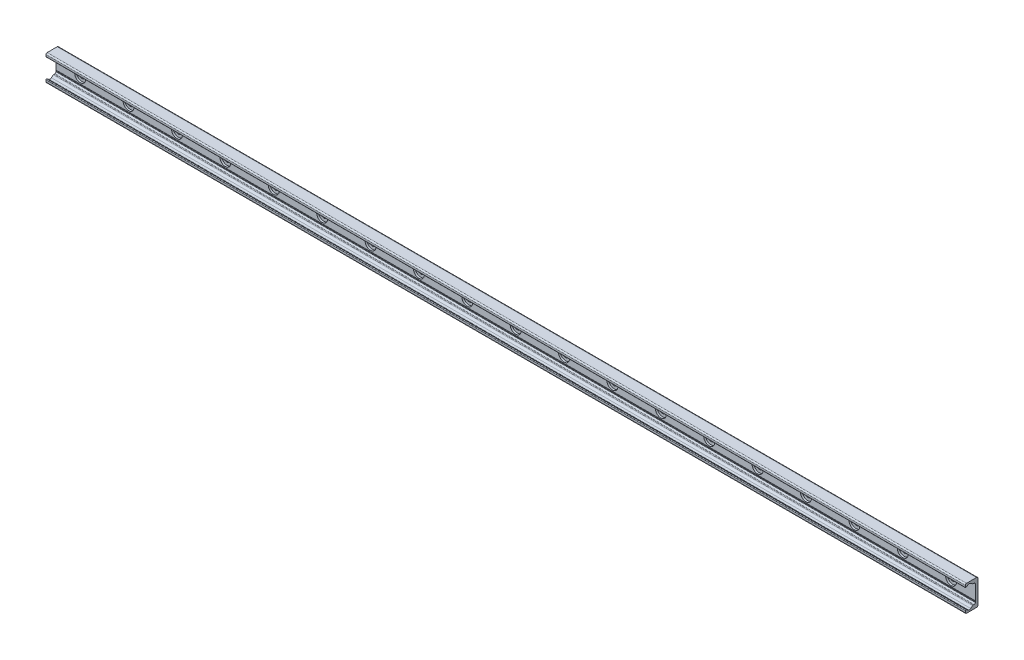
ISO-10303-21;
HEADER;
FILE_DESCRIPTION(('STEP AP214'),'2;1');
FILE_NAME('part.step','',(''),(''),'','','');
FILE_SCHEMA(('AUTOMOTIVE_DESIGN { 1 0 10303 214 1 1 1 1 }'));
ENDSEC;
DATA;
#1=APPLICATION_CONTEXT('core data for automotive mechanical design processes');
#2=APPLICATION_PROTOCOL_DEFINITION('international standard','automotive_design',2000,#1);
#3=PRODUCT_CONTEXT('',#1,'mechanical');
#4=PRODUCT('Part','Part','',(#3));
#5=PRODUCT_RELATED_PRODUCT_CATEGORY('part','',(#4));
#6=PRODUCT_DEFINITION_FORMATION('','',#4);
#7=PRODUCT_DEFINITION_CONTEXT('part definition',#1,'design');
#8=PRODUCT_DEFINITION('design','',#6,#7);
#9=PRODUCT_DEFINITION_SHAPE('','',#8);
#10=(LENGTH_UNIT() NAMED_UNIT(*) SI_UNIT(.MILLI.,.METRE.));
#11=(NAMED_UNIT(*) PLANE_ANGLE_UNIT() SI_UNIT($,.RADIAN.));
#12=(NAMED_UNIT(*) SI_UNIT($,.STERADIAN.) SOLID_ANGLE_UNIT());
#13=UNCERTAINTY_MEASURE_WITH_UNIT(LENGTH_MEASURE(1.E-05),#10,'distance_accuracy_value','');
#14=(GEOMETRIC_REPRESENTATION_CONTEXT(3) GLOBAL_UNCERTAINTY_ASSIGNED_CONTEXT((#13)) GLOBAL_UNIT_ASSIGNED_CONTEXT((#10,
#11,#12)) REPRESENTATION_CONTEXT('',''));
#15=CARTESIAN_POINT('',(0.,0.,0.));
#16=DIRECTION('',(0.,0.,1.));
#17=DIRECTION('',(1.,0.,0.));
#18=AXIS2_PLACEMENT_3D('',#15,#16,#17);
#19=CARTESIAN_POINT('',(-720.,0.,1.39999999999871));
#20=DIRECTION('',(0.,0.,1.));
#21=DIRECTION('',(1.,0.,0.));
#22=AXIS2_PLACEMENT_3D('',#19,#20,#21);
#23=PLANE('',#22);
#24=CARTESIAN_POINT('',(-720.,0.,1.39999999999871));
#25=DIRECTION('',(0.,0.,1.));
#26=DIRECTION('',(1.,0.,0.));
#27=AXIS2_PLACEMENT_3D('',#24,#25,#26);
#28=CIRCLE('',#27,4.49999999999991);
#29=CARTESIAN_POINT('',(-715.5,0.,1.39999999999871));
#30=VERTEX_POINT('',#29);
#31=EDGE_CURVE('E609',#30,#30,#28,.T.);
#32=ORIENTED_EDGE('',*,*,#31,.F.);
#33=EDGE_LOOP('',(#32));
#34=FACE_BOUND('',#33,.T.);
#35=CARTESIAN_POINT('',(-720.,0.,1.39999999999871));
#36=DIRECTION('',(0.,0.,1.));
#37=DIRECTION('',(1.,0.,0.));
#38=AXIS2_PLACEMENT_3D('',#35,#36,#37);
#39=CIRCLE('',#38,9.00000000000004);
#40=CARTESIAN_POINT('',(-711.,0.,1.39999999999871));
#41=VERTEX_POINT('',#40);
#42=EDGE_CURVE('E11',#41,#41,#39,.T.);
#43=ORIENTED_EDGE('',*,*,#42,.T.);
#44=EDGE_LOOP('',(#43));
#45=FACE_BOUND('',#44,.T.);
#46=ADVANCED_FACE('F39',(#34,#45),#23,.T.);
#47=CARTESIAN_POINT('',(-720.,0.,1.39999999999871));
#48=DIRECTION('',(0.,0.,1.));
#49=DIRECTION('',(1.,0.,0.));
#50=AXIS2_PLACEMENT_3D('',#47,#48,#49);
#51=CYLINDRICAL_SURFACE('',#50,9.00000000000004);
#52=CARTESIAN_POINT('',(-720.,0.,4.49999999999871));
#53=DIRECTION('',(0.,0.,1.));
#54=DIRECTION('',(1.,0.,0.));
#55=AXIS2_PLACEMENT_3D('',#52,#53,#54);
#56=CIRCLE('',#55,9.00000000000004);
#57=CARTESIAN_POINT('',(-711.,0.,4.49999999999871));
#58=VERTEX_POINT('',#57);
#59=EDGE_CURVE('E49',#58,#58,#56,.T.);
#60=CARTESIAN_POINT('',(-711.,0.,1.39999999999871));
#61=CARTESIAN_POINT('',(-711.,0.,1.43229166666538));
#62=CARTESIAN_POINT('',(-711.,0.,1.46458333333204));
#63=CARTESIAN_POINT('',(-711.,0.,1.52916666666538));
#64=CARTESIAN_POINT('',(-711.,0.,1.56145833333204));
#65=CARTESIAN_POINT('',(-711.,0.,1.62604166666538));
#66=CARTESIAN_POINT('',(-711.,0.,1.65833333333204));
#67=CARTESIAN_POINT('',(-711.,0.,1.72291666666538));
#68=CARTESIAN_POINT('',(-711.,0.,1.75520833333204));
#69=CARTESIAN_POINT('',(-711.,0.,1.81979166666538));
#70=CARTESIAN_POINT('',(-711.,0.,1.85208333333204));
#71=CARTESIAN_POINT('',(-711.,0.,1.91666666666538));
#72=CARTESIAN_POINT('',(-711.,0.,1.94895833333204));
#73=CARTESIAN_POINT('',(-711.,0.,2.01354166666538));
#74=CARTESIAN_POINT('',(-711.,0.,2.04583333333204));
#75=CARTESIAN_POINT('',(-711.,0.,2.11041666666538));
#76=CARTESIAN_POINT('',(-711.,0.,2.14270833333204));
#77=CARTESIAN_POINT('',(-711.,0.,2.20729166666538));
#78=CARTESIAN_POINT('',(-711.,0.,2.23958333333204));
#79=CARTESIAN_POINT('',(-711.,0.,2.30416666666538));
#80=CARTESIAN_POINT('',(-711.,0.,2.33645833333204));
#81=CARTESIAN_POINT('',(-711.,0.,2.40104166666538));
#82=CARTESIAN_POINT('',(-711.,0.,2.43333333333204));
#83=CARTESIAN_POINT('',(-711.,0.,2.49791666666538));
#84=CARTESIAN_POINT('',(-711.,0.,2.53020833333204));
#85=CARTESIAN_POINT('',(-711.,0.,2.59479166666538));
#86=CARTESIAN_POINT('',(-711.,0.,2.62708333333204));
#87=CARTESIAN_POINT('',(-711.,0.,2.69166666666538));
#88=CARTESIAN_POINT('',(-711.,0.,2.72395833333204));
#89=CARTESIAN_POINT('',(-711.,0.,2.78854166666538));
#90=CARTESIAN_POINT('',(-711.,0.,2.82083333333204));
#91=CARTESIAN_POINT('',(-711.,0.,2.88541666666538));
#92=CARTESIAN_POINT('',(-711.,0.,2.91770833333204));
#93=CARTESIAN_POINT('',(-711.,0.,2.98229166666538));
#94=CARTESIAN_POINT('',(-711.,0.,3.01458333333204));
#95=CARTESIAN_POINT('',(-711.,0.,3.07916666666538));
#96=CARTESIAN_POINT('',(-711.,0.,3.11145833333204));
#97=CARTESIAN_POINT('',(-711.,0.,3.17604166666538));
#98=CARTESIAN_POINT('',(-711.,0.,3.20833333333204));
#99=CARTESIAN_POINT('',(-711.,0.,3.27291666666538));
#100=CARTESIAN_POINT('',(-711.,0.,3.30520833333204));
#101=CARTESIAN_POINT('',(-711.,0.,3.36979166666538));
#102=CARTESIAN_POINT('',(-711.,0.,3.40208333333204));
#103=CARTESIAN_POINT('',(-711.,0.,3.46666666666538));
#104=CARTESIAN_POINT('',(-711.,0.,3.49895833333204));
#105=CARTESIAN_POINT('',(-711.,0.,3.56354166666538));
#106=CARTESIAN_POINT('',(-711.,0.,3.59583333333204));
#107=CARTESIAN_POINT('',(-711.,0.,3.66041666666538));
#108=CARTESIAN_POINT('',(-711.,0.,3.69270833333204));
#109=CARTESIAN_POINT('',(-711.,0.,3.75729166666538));
#110=CARTESIAN_POINT('',(-711.,0.,3.78958333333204));
#111=CARTESIAN_POINT('',(-711.,0.,3.85416666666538));
#112=CARTESIAN_POINT('',(-711.,0.,3.88645833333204));
#113=CARTESIAN_POINT('',(-711.,0.,3.95104166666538));
#114=CARTESIAN_POINT('',(-711.,0.,3.98333333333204));
#115=CARTESIAN_POINT('',(-711.,0.,4.04791666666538));
#116=CARTESIAN_POINT('',(-711.,0.,4.08020833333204));
#117=CARTESIAN_POINT('',(-711.,0.,4.14479166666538));
#118=CARTESIAN_POINT('',(-711.,0.,4.17708333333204));
#119=CARTESIAN_POINT('',(-711.,0.,4.24166666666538));
#120=CARTESIAN_POINT('',(-711.,0.,4.27395833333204));
#121=CARTESIAN_POINT('',(-711.,0.,4.33854166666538));
#122=CARTESIAN_POINT('',(-711.,0.,4.37083333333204));
#123=CARTESIAN_POINT('',(-711.,0.,4.43541666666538));
#124=CARTESIAN_POINT('',(-711.,0.,4.46770833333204));
#125=CARTESIAN_POINT('',(-711.,0.,4.49999999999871));
#126=B_SPLINE_CURVE_WITH_KNOTS('',3,(#60,#61,#62,#63,#64,#65,#66,#67,#68,#69,#70,#71,#72,#73,
#74,#75,#76,#77,#78,#79,#80,#81,#82,#83,#84,#85,#86,#87,#88,#89,#90,#91,#92,#93,#94,#95,#96,#97,
#98,#99,#100,#101,#102,#103,#104,#105,#106,#107,#108,#109,#110,#111,#112,#113,#114,#115,#116,
#117,#118,#119,#120,#121,#122,#123,#124,#125),.UNSPECIFIED.,.F.,.F.,(4,2,2,2,2,2,2,2,2,2,2,2,2,
2,2,2,2,2,2,2,2,2,2,2,2,2,2,2,2,2,2,2,4),(0.,0.0968750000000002,0.19375,0.290625,0.3875,
0.484375,0.58125,0.678125,0.775,0.871875,0.96875,1.065625,1.1625,1.259375,1.35625,1.453125,1.55,
1.646875,1.74375,1.840625,1.9375,2.034375,2.13125,2.228125,2.325,2.421875,2.51875,2.615625,
2.7125,2.809375,2.90625,3.003125,3.1),.UNSPECIFIED.);
#127=EDGE_CURVE('BSEAM579',#41,#58,#126,.T.);
#128=ORIENTED_EDGE('',*,*,#42,.F.);
#129=ORIENTED_EDGE('',*,*,#59,.T.);
#130=ORIENTED_EDGE('',*,*,#127,.T.);
#131=ORIENTED_EDGE('',*,*,#127,.F.);
#132=EDGE_LOOP('',(#128,#130,#129,#131));
#133=FACE_BOUND('',#132,.T.);
#134=ADVANCED_FACE('F579',(#133),#51,.F.);
#135=CARTESIAN_POINT('',(-640.,0.,1.39999999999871));
#136=DIRECTION('',(0.,0.,1.));
#137=DIRECTION('',(1.,0.,0.));
#138=AXIS2_PLACEMENT_3D('',#135,#136,#137);
#139=PLANE('',#138);
#140=CARTESIAN_POINT('',(-640.,0.,1.39999999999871));
#141=DIRECTION('',(0.,0.,1.));
#142=DIRECTION('',(1.,0.,0.));
#143=AXIS2_PLACEMENT_3D('',#140,#141,#142);
#144=CIRCLE('',#143,4.49999999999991);
#145=CARTESIAN_POINT('',(-635.5,0.,1.39999999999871));
#146=VERTEX_POINT('',#145);
#147=EDGE_CURVE('E613',#146,#146,#144,.T.);
#148=ORIENTED_EDGE('',*,*,#147,.F.);
#149=EDGE_LOOP('',(#148));
#150=FACE_BOUND('',#149,.T.);
#151=CARTESIAN_POINT('',(-640.,0.,1.39999999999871));
#152=DIRECTION('',(0.,0.,1.));
#153=DIRECTION('',(1.,0.,0.));
#154=AXIS2_PLACEMENT_3D('',#151,#152,#153);
#155=CIRCLE('',#154,9.00000000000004);
#156=CARTESIAN_POINT('',(-631.,0.,1.39999999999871));
#157=VERTEX_POINT('',#156);
#158=EDGE_CURVE('E571',#157,#157,#155,.T.);
#159=ORIENTED_EDGE('',*,*,#158,.T.);
#160=EDGE_LOOP('',(#159));
#161=FACE_BOUND('',#160,.T.);
#162=ADVANCED_FACE('F604',(#150,#161),#139,.T.);
#163=CARTESIAN_POINT('',(-640.,0.,1.39999999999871));
#164=DIRECTION('',(0.,0.,1.));
#165=DIRECTION('',(1.,0.,0.));
#166=AXIS2_PLACEMENT_3D('',#163,#164,#165);
#167=CYLINDRICAL_SURFACE('',#166,9.00000000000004);
#168=CARTESIAN_POINT('',(-640.,0.,4.49999999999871));
#169=DIRECTION('',(0.,0.,1.));
#170=DIRECTION('',(1.,0.,0.));
#171=AXIS2_PLACEMENT_3D('',#168,#169,#170);
#172=CIRCLE('',#171,9.00000000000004);
#173=CARTESIAN_POINT('',(-631.,0.,4.49999999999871));
#174=VERTEX_POINT('',#173);
#175=EDGE_CURVE('E567',#174,#174,#172,.T.);
#176=CARTESIAN_POINT('',(-631.,0.,1.39999999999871));
#177=CARTESIAN_POINT('',(-631.,0.,1.43229166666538));
#178=CARTESIAN_POINT('',(-631.,0.,1.46458333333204));
#179=CARTESIAN_POINT('',(-631.,0.,1.52916666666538));
#180=CARTESIAN_POINT('',(-631.,0.,1.56145833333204));
#181=CARTESIAN_POINT('',(-631.,0.,1.62604166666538));
#182=CARTESIAN_POINT('',(-631.,0.,1.65833333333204));
#183=CARTESIAN_POINT('',(-631.,0.,1.72291666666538));
#184=CARTESIAN_POINT('',(-631.,0.,1.75520833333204));
#185=CARTESIAN_POINT('',(-631.,0.,1.81979166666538));
#186=CARTESIAN_POINT('',(-631.,0.,1.85208333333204));
#187=CARTESIAN_POINT('',(-631.,0.,1.91666666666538));
#188=CARTESIAN_POINT('',(-631.,0.,1.94895833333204));
#189=CARTESIAN_POINT('',(-631.,0.,2.01354166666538));
#190=CARTESIAN_POINT('',(-631.,0.,2.04583333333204));
#191=CARTESIAN_POINT('',(-631.,0.,2.11041666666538));
#192=CARTESIAN_POINT('',(-631.,0.,2.14270833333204));
#193=CARTESIAN_POINT('',(-631.,0.,2.20729166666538));
#194=CARTESIAN_POINT('',(-631.,0.,2.23958333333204));
#195=CARTESIAN_POINT('',(-631.,0.,2.30416666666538));
#196=CARTESIAN_POINT('',(-631.,0.,2.33645833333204));
#197=CARTESIAN_POINT('',(-631.,0.,2.40104166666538));
#198=CARTESIAN_POINT('',(-631.,0.,2.43333333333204));
#199=CARTESIAN_POINT('',(-631.,0.,2.49791666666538));
#200=CARTESIAN_POINT('',(-631.,0.,2.53020833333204));
#201=CARTESIAN_POINT('',(-631.,0.,2.59479166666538));
#202=CARTESIAN_POINT('',(-631.,0.,2.62708333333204));
#203=CARTESIAN_POINT('',(-631.,0.,2.69166666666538));
#204=CARTESIAN_POINT('',(-631.,0.,2.72395833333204));
#205=CARTESIAN_POINT('',(-631.,0.,2.78854166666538));
#206=CARTESIAN_POINT('',(-631.,0.,2.82083333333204));
#207=CARTESIAN_POINT('',(-631.,0.,2.88541666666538));
#208=CARTESIAN_POINT('',(-631.,0.,2.91770833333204));
#209=CARTESIAN_POINT('',(-631.,0.,2.98229166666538));
#210=CARTESIAN_POINT('',(-631.,0.,3.01458333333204));
#211=CARTESIAN_POINT('',(-631.,0.,3.07916666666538));
#212=CARTESIAN_POINT('',(-631.,0.,3.11145833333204));
#213=CARTESIAN_POINT('',(-631.,0.,3.17604166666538));
#214=CARTESIAN_POINT('',(-631.,0.,3.20833333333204));
#215=CARTESIAN_POINT('',(-631.,0.,3.27291666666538));
#216=CARTESIAN_POINT('',(-631.,0.,3.30520833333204));
#217=CARTESIAN_POINT('',(-631.,0.,3.36979166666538));
#218=CARTESIAN_POINT('',(-631.,0.,3.40208333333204));
#219=CARTESIAN_POINT('',(-631.,0.,3.46666666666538));
#220=CARTESIAN_POINT('',(-631.,0.,3.49895833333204));
#221=CARTESIAN_POINT('',(-631.,0.,3.56354166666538));
#222=CARTESIAN_POINT('',(-631.,0.,3.59583333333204));
#223=CARTESIAN_POINT('',(-631.,0.,3.66041666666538));
#224=CARTESIAN_POINT('',(-631.,0.,3.69270833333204));
#225=CARTESIAN_POINT('',(-631.,0.,3.75729166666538));
#226=CARTESIAN_POINT('',(-631.,0.,3.78958333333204));
#227=CARTESIAN_POINT('',(-631.,0.,3.85416666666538));
#228=CARTESIAN_POINT('',(-631.,0.,3.88645833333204));
#229=CARTESIAN_POINT('',(-631.,0.,3.95104166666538));
#230=CARTESIAN_POINT('',(-631.,0.,3.98333333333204));
#231=CARTESIAN_POINT('',(-631.,0.,4.04791666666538));
#232=CARTESIAN_POINT('',(-631.,0.,4.08020833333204));
#233=CARTESIAN_POINT('',(-631.,0.,4.14479166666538));
#234=CARTESIAN_POINT('',(-631.,0.,4.17708333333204));
#235=CARTESIAN_POINT('',(-631.,0.,4.24166666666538));
#236=CARTESIAN_POINT('',(-631.,0.,4.27395833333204));
#237=CARTESIAN_POINT('',(-631.,0.,4.33854166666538));
#238=CARTESIAN_POINT('',(-631.,0.,4.37083333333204));
#239=CARTESIAN_POINT('',(-631.,0.,4.43541666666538));
#240=CARTESIAN_POINT('',(-631.,0.,4.46770833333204));
#241=CARTESIAN_POINT('',(-631.,0.,4.49999999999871));
#242=B_SPLINE_CURVE_WITH_KNOTS('',3,(#176,#177,#178,#179,#180,#181,#182,#183,#184,#185,#186,
#187,#188,#189,#190,#191,#192,#193,#194,#195,#196,#197,#198,#199,#200,#201,#202,#203,#204,#205,
#206,#207,#208,#209,#210,#211,#212,#213,#214,#215,#216,#217,#218,#219,#220,#221,#222,#223,#224,
#225,#226,#227,#228,#229,#230,#231,#232,#233,#234,#235,#236,#237,#238,#239,#240,#241),
.UNSPECIFIED.,.F.,.F.,(4,2,2,2,2,2,2,2,2,2,2,2,2,2,2,2,2,2,2,2,2,2,2,2,2,2,2,2,2,2,2,2,4),(0.,
0.0968750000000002,0.19375,0.290625,0.3875,0.484375,0.58125,0.678125,0.775,0.871875,0.96875,
1.065625,1.1625,1.259375,1.35625,1.453125,1.55,1.646875,1.74375,1.840625,1.9375,2.034375,
2.13125,2.228125,2.325,2.421875,2.51875,2.615625,2.7125,2.809375,2.90625,3.003125,3.1),.UNSPECIFIED.);
#243=EDGE_CURVE('BSEAM1167',#157,#174,#242,.T.);
#244=ORIENTED_EDGE('',*,*,#158,.F.);
#245=ORIENTED_EDGE('',*,*,#175,.T.);
#246=ORIENTED_EDGE('',*,*,#243,.T.);
#247=ORIENTED_EDGE('',*,*,#243,.F.);
#248=EDGE_LOOP('',(#244,#246,#245,#247));
#249=FACE_BOUND('',#248,.T.);
#250=ADVANCED_FACE('F1167',(#249),#167,.F.);
#251=CARTESIAN_POINT('',(-560.,0.,1.39999999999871));
#252=DIRECTION('',(0.,0.,1.));
#253=DIRECTION('',(1.,0.,0.));
#254=AXIS2_PLACEMENT_3D('',#251,#252,#253);
#255=PLANE('',#254);
#256=CARTESIAN_POINT('',(-560.,0.,1.39999999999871));
#257=DIRECTION('',(0.,0.,1.));
#258=DIRECTION('',(1.,0.,0.));
#259=AXIS2_PLACEMENT_3D('',#256,#257,#258);
#260=CIRCLE('',#259,4.49999999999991);
#261=CARTESIAN_POINT('',(-555.5,0.,1.39999999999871));
#262=VERTEX_POINT('',#261);
#263=EDGE_CURVE('E617',#262,#262,#260,.T.);
#264=ORIENTED_EDGE('',*,*,#263,.F.);
#265=EDGE_LOOP('',(#264));
#266=FACE_BOUND('',#265,.T.);
#267=CARTESIAN_POINT('',(-560.,0.,1.39999999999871));
#268=DIRECTION('',(0.,0.,1.));
#269=DIRECTION('',(1.,0.,0.));
#270=AXIS2_PLACEMENT_3D('',#267,#268,#269);
#271=CIRCLE('',#270,9.00000000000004);
#272=CARTESIAN_POINT('',(-551.,0.,1.39999999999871));
#273=VERTEX_POINT('',#272);
#274=EDGE_CURVE('E563',#273,#273,#271,.T.);
#275=ORIENTED_EDGE('',*,*,#274,.T.);
#276=EDGE_LOOP('',(#275));
#277=FACE_BOUND('',#276,.T.);
#278=ADVANCED_FACE('F1163',(#266,#277),#255,.T.);
#279=CARTESIAN_POINT('',(-560.,0.,1.39999999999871));
#280=DIRECTION('',(0.,0.,1.));
#281=DIRECTION('',(1.,0.,0.));
#282=AXIS2_PLACEMENT_3D('',#279,#280,#281);
#283=CYLINDRICAL_SURFACE('',#282,9.00000000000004);
#284=CARTESIAN_POINT('',(-560.,0.,4.49999999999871));
#285=DIRECTION('',(0.,0.,1.));
#286=DIRECTION('',(1.,0.,0.));
#287=AXIS2_PLACEMENT_3D('',#284,#285,#286);
#288=CIRCLE('',#287,9.00000000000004);
#289=CARTESIAN_POINT('',(-551.,0.,4.49999999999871));
#290=VERTEX_POINT('',#289);
#291=EDGE_CURVE('E559',#290,#290,#288,.T.);
#292=CARTESIAN_POINT('',(-551.,0.,1.39999999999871));
#293=CARTESIAN_POINT('',(-551.,0.,1.43229166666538));
#294=CARTESIAN_POINT('',(-551.,0.,1.46458333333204));
#295=CARTESIAN_POINT('',(-551.,0.,1.52916666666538));
#296=CARTESIAN_POINT('',(-551.,0.,1.56145833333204));
#297=CARTESIAN_POINT('',(-551.,0.,1.62604166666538));
#298=CARTESIAN_POINT('',(-551.,0.,1.65833333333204));
#299=CARTESIAN_POINT('',(-551.,0.,1.72291666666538));
#300=CARTESIAN_POINT('',(-551.,0.,1.75520833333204));
#301=CARTESIAN_POINT('',(-551.,0.,1.81979166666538));
#302=CARTESIAN_POINT('',(-551.,0.,1.85208333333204));
#303=CARTESIAN_POINT('',(-551.,0.,1.91666666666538));
#304=CARTESIAN_POINT('',(-551.,0.,1.94895833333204));
#305=CARTESIAN_POINT('',(-551.,0.,2.01354166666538));
#306=CARTESIAN_POINT('',(-551.,0.,2.04583333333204));
#307=CARTESIAN_POINT('',(-551.,0.,2.11041666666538));
#308=CARTESIAN_POINT('',(-551.,0.,2.14270833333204));
#309=CARTESIAN_POINT('',(-551.,0.,2.20729166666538));
#310=CARTESIAN_POINT('',(-551.,0.,2.23958333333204));
#311=CARTESIAN_POINT('',(-551.,0.,2.30416666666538));
#312=CARTESIAN_POINT('',(-551.,0.,2.33645833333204));
#313=CARTESIAN_POINT('',(-551.,0.,2.40104166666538));
#314=CARTESIAN_POINT('',(-551.,0.,2.43333333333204));
#315=CARTESIAN_POINT('',(-551.,0.,2.49791666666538));
#316=CARTESIAN_POINT('',(-551.,0.,2.53020833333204));
#317=CARTESIAN_POINT('',(-551.,0.,2.59479166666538));
#318=CARTESIAN_POINT('',(-551.,0.,2.62708333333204));
#319=CARTESIAN_POINT('',(-551.,0.,2.69166666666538));
#320=CARTESIAN_POINT('',(-551.,0.,2.72395833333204));
#321=CARTESIAN_POINT('',(-551.,0.,2.78854166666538));
#322=CARTESIAN_POINT('',(-551.,0.,2.82083333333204));
#323=CARTESIAN_POINT('',(-551.,0.,2.88541666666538));
#324=CARTESIAN_POINT('',(-551.,0.,2.91770833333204));
#325=CARTESIAN_POINT('',(-551.,0.,2.98229166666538));
#326=CARTESIAN_POINT('',(-551.,0.,3.01458333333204));
#327=CARTESIAN_POINT('',(-551.,0.,3.07916666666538));
#328=CARTESIAN_POINT('',(-551.,0.,3.11145833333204));
#329=CARTESIAN_POINT('',(-551.,0.,3.17604166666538));
#330=CARTESIAN_POINT('',(-551.,0.,3.20833333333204));
#331=CARTESIAN_POINT('',(-551.,0.,3.27291666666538));
#332=CARTESIAN_POINT('',(-551.,0.,3.30520833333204));
#333=CARTESIAN_POINT('',(-551.,0.,3.36979166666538));
#334=CARTESIAN_POINT('',(-551.,0.,3.40208333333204));
#335=CARTESIAN_POINT('',(-551.,0.,3.46666666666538));
#336=CARTESIAN_POINT('',(-551.,0.,3.49895833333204));
#337=CARTESIAN_POINT('',(-551.,0.,3.56354166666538));
#338=CARTESIAN_POINT('',(-551.,0.,3.59583333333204));
#339=CARTESIAN_POINT('',(-551.,0.,3.66041666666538));
#340=CARTESIAN_POINT('',(-551.,0.,3.69270833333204));
#341=CARTESIAN_POINT('',(-551.,0.,3.75729166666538));
#342=CARTESIAN_POINT('',(-551.,0.,3.78958333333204));
#343=CARTESIAN_POINT('',(-551.,0.,3.85416666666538));
#344=CARTESIAN_POINT('',(-551.,0.,3.88645833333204));
#345=CARTESIAN_POINT('',(-551.,0.,3.95104166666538));
#346=CARTESIAN_POINT('',(-551.,0.,3.98333333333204));
#347=CARTESIAN_POINT('',(-551.,0.,4.04791666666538));
#348=CARTESIAN_POINT('',(-551.,0.,4.08020833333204));
#349=CARTESIAN_POINT('',(-551.,0.,4.14479166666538));
#350=CARTESIAN_POINT('',(-551.,0.,4.17708333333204));
#351=CARTESIAN_POINT('',(-551.,0.,4.24166666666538));
#352=CARTESIAN_POINT('',(-551.,0.,4.27395833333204));
#353=CARTESIAN_POINT('',(-551.,0.,4.33854166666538));
#354=CARTESIAN_POINT('',(-551.,0.,4.37083333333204));
#355=CARTESIAN_POINT('',(-551.,0.,4.43541666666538));
#356=CARTESIAN_POINT('',(-551.,0.,4.46770833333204));
#357=CARTESIAN_POINT('',(-551.,0.,4.49999999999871));
#358=B_SPLINE_CURVE_WITH_KNOTS('',3,(#292,#293,#294,#295,#296,#297,#298,#299,#300,#301,#302,
#303,#304,#305,#306,#307,#308,#309,#310,#311,#312,#313,#314,#315,#316,#317,#318,#319,#320,#321,
#322,#323,#324,#325,#326,#327,#328,#329,#330,#331,#332,#333,#334,#335,#336,#337,#338,#339,#340,
#341,#342,#343,#344,#345,#346,#347,#348,#349,#350,#351,#352,#353,#354,#355,#356,#357),
.UNSPECIFIED.,.F.,.F.,(4,2,2,2,2,2,2,2,2,2,2,2,2,2,2,2,2,2,2,2,2,2,2,2,2,2,2,2,2,2,2,2,4),(0.,
0.0968750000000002,0.19375,0.290625,0.3875,0.484375,0.58125,0.678125,0.775,0.871875,0.96875,
1.065625,1.1625,1.259375,1.35625,1.453125,1.55,1.646875,1.74375,1.840625,1.9375,2.034375,
2.13125,2.228125,2.325,2.421875,2.51875,2.615625,2.7125,2.809375,2.90625,3.003125,3.1),.UNSPECIFIED.);
#359=EDGE_CURVE('BSEAM1159',#273,#290,#358,.T.);
#360=ORIENTED_EDGE('',*,*,#274,.F.);
#361=ORIENTED_EDGE('',*,*,#291,.T.);
#362=ORIENTED_EDGE('',*,*,#359,.T.);
#363=ORIENTED_EDGE('',*,*,#359,.F.);
#364=EDGE_LOOP('',(#360,#362,#361,#363));
#365=FACE_BOUND('',#364,.T.);
#366=ADVANCED_FACE('F1159',(#365),#283,.F.);
#367=CARTESIAN_POINT('',(-480.,0.,1.39999999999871));
#368=DIRECTION('',(0.,0.,1.));
#369=DIRECTION('',(1.,0.,0.));
#370=AXIS2_PLACEMENT_3D('',#367,#368,#369);
#371=PLANE('',#370);
#372=CARTESIAN_POINT('',(-480.,0.,1.39999999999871));
#373=DIRECTION('',(0.,0.,1.));
#374=DIRECTION('',(1.,0.,0.));
#375=AXIS2_PLACEMENT_3D('',#372,#373,#374);
#376=CIRCLE('',#375,4.49999999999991);
#377=CARTESIAN_POINT('',(-475.5,0.,1.39999999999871));
#378=VERTEX_POINT('',#377);
#379=EDGE_CURVE('E629',#378,#378,#376,.T.);
#380=ORIENTED_EDGE('',*,*,#379,.F.);
#381=EDGE_LOOP('',(#380));
#382=FACE_BOUND('',#381,.T.);
#383=CARTESIAN_POINT('',(-480.,0.,1.39999999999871));
#384=DIRECTION('',(0.,0.,1.));
#385=DIRECTION('',(1.,0.,0.));
#386=AXIS2_PLACEMENT_3D('',#383,#384,#385);
#387=CIRCLE('',#386,9.00000000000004);
#388=CARTESIAN_POINT('',(-471.,0.,1.39999999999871));
#389=VERTEX_POINT('',#388);
#390=EDGE_CURVE('E555',#389,#389,#387,.T.);
#391=ORIENTED_EDGE('',*,*,#390,.T.);
#392=EDGE_LOOP('',(#391));
#393=FACE_BOUND('',#392,.T.);
#394=ADVANCED_FACE('F1155',(#382,#393),#371,.T.);
#395=CARTESIAN_POINT('',(-480.,0.,1.39999999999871));
#396=DIRECTION('',(0.,0.,1.));
#397=DIRECTION('',(1.,0.,0.));
#398=AXIS2_PLACEMENT_3D('',#395,#396,#397);
#399=CYLINDRICAL_SURFACE('',#398,9.00000000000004);
#400=CARTESIAN_POINT('',(-480.,0.,4.49999999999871));
#401=DIRECTION('',(0.,0.,1.));
#402=DIRECTION('',(1.,0.,0.));
#403=AXIS2_PLACEMENT_3D('',#400,#401,#402);
#404=CIRCLE('',#403,9.00000000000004);
#405=CARTESIAN_POINT('',(-471.,0.,4.49999999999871));
#406=VERTEX_POINT('',#405);
#407=EDGE_CURVE('E551',#406,#406,#404,.T.);
#408=CARTESIAN_POINT('',(-471.,0.,1.39999999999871));
#409=CARTESIAN_POINT('',(-471.,0.,1.43229166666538));
#410=CARTESIAN_POINT('',(-471.,0.,1.46458333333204));
#411=CARTESIAN_POINT('',(-471.,0.,1.52916666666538));
#412=CARTESIAN_POINT('',(-471.,0.,1.56145833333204));
#413=CARTESIAN_POINT('',(-471.,0.,1.62604166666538));
#414=CARTESIAN_POINT('',(-471.,0.,1.65833333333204));
#415=CARTESIAN_POINT('',(-471.,0.,1.72291666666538));
#416=CARTESIAN_POINT('',(-471.,0.,1.75520833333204));
#417=CARTESIAN_POINT('',(-471.,0.,1.81979166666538));
#418=CARTESIAN_POINT('',(-471.,0.,1.85208333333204));
#419=CARTESIAN_POINT('',(-471.,0.,1.91666666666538));
#420=CARTESIAN_POINT('',(-471.,0.,1.94895833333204));
#421=CARTESIAN_POINT('',(-471.,0.,2.01354166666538));
#422=CARTESIAN_POINT('',(-471.,0.,2.04583333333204));
#423=CARTESIAN_POINT('',(-471.,0.,2.11041666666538));
#424=CARTESIAN_POINT('',(-471.,0.,2.14270833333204));
#425=CARTESIAN_POINT('',(-471.,0.,2.20729166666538));
#426=CARTESIAN_POINT('',(-471.,0.,2.23958333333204));
#427=CARTESIAN_POINT('',(-471.,0.,2.30416666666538));
#428=CARTESIAN_POINT('',(-471.,0.,2.33645833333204));
#429=CARTESIAN_POINT('',(-471.,0.,2.40104166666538));
#430=CARTESIAN_POINT('',(-471.,0.,2.43333333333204));
#431=CARTESIAN_POINT('',(-471.,0.,2.49791666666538));
#432=CARTESIAN_POINT('',(-471.,0.,2.53020833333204));
#433=CARTESIAN_POINT('',(-471.,0.,2.59479166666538));
#434=CARTESIAN_POINT('',(-471.,0.,2.62708333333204));
#435=CARTESIAN_POINT('',(-471.,0.,2.69166666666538));
#436=CARTESIAN_POINT('',(-471.,0.,2.72395833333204));
#437=CARTESIAN_POINT('',(-471.,0.,2.78854166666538));
#438=CARTESIAN_POINT('',(-471.,0.,2.82083333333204));
#439=CARTESIAN_POINT('',(-471.,0.,2.88541666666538));
#440=CARTESIAN_POINT('',(-471.,0.,2.91770833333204));
#441=CARTESIAN_POINT('',(-471.,0.,2.98229166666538));
#442=CARTESIAN_POINT('',(-471.,0.,3.01458333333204));
#443=CARTESIAN_POINT('',(-471.,0.,3.07916666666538));
#444=CARTESIAN_POINT('',(-471.,0.,3.11145833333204));
#445=CARTESIAN_POINT('',(-471.,0.,3.17604166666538));
#446=CARTESIAN_POINT('',(-471.,0.,3.20833333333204));
#447=CARTESIAN_POINT('',(-471.,0.,3.27291666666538));
#448=CARTESIAN_POINT('',(-471.,0.,3.30520833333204));
#449=CARTESIAN_POINT('',(-471.,0.,3.36979166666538));
#450=CARTESIAN_POINT('',(-471.,0.,3.40208333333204));
#451=CARTESIAN_POINT('',(-471.,0.,3.46666666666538));
#452=CARTESIAN_POINT('',(-471.,0.,3.49895833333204));
#453=CARTESIAN_POINT('',(-471.,0.,3.56354166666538));
#454=CARTESIAN_POINT('',(-471.,0.,3.59583333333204));
#455=CARTESIAN_POINT('',(-471.,0.,3.66041666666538));
#456=CARTESIAN_POINT('',(-471.,0.,3.69270833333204));
#457=CARTESIAN_POINT('',(-471.,0.,3.75729166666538));
#458=CARTESIAN_POINT('',(-471.,0.,3.78958333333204));
#459=CARTESIAN_POINT('',(-471.,0.,3.85416666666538));
#460=CARTESIAN_POINT('',(-471.,0.,3.88645833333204));
#461=CARTESIAN_POINT('',(-471.,0.,3.95104166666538));
#462=CARTESIAN_POINT('',(-471.,0.,3.98333333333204));
#463=CARTESIAN_POINT('',(-471.,0.,4.04791666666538));
#464=CARTESIAN_POINT('',(-471.,0.,4.08020833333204));
#465=CARTESIAN_POINT('',(-471.,0.,4.14479166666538));
#466=CARTESIAN_POINT('',(-471.,0.,4.17708333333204));
#467=CARTESIAN_POINT('',(-471.,0.,4.24166666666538));
#468=CARTESIAN_POINT('',(-471.,0.,4.27395833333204));
#469=CARTESIAN_POINT('',(-471.,0.,4.33854166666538));
#470=CARTESIAN_POINT('',(-471.,0.,4.37083333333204));
#471=CARTESIAN_POINT('',(-471.,0.,4.43541666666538));
#472=CARTESIAN_POINT('',(-471.,0.,4.46770833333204));
#473=CARTESIAN_POINT('',(-471.,0.,4.49999999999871));
#474=B_SPLINE_CURVE_WITH_KNOTS('',3,(#408,#409,#410,#411,#412,#413,#414,#415,#416,#417,#418,
#419,#420,#421,#422,#423,#424,#425,#426,#427,#428,#429,#430,#431,#432,#433,#434,#435,#436,#437,
#438,#439,#440,#441,#442,#443,#444,#445,#446,#447,#448,#449,#450,#451,#452,#453,#454,#455,#456,
#457,#458,#459,#460,#461,#462,#463,#464,#465,#466,#467,#468,#469,#470,#471,#472,#473),
.UNSPECIFIED.,.F.,.F.,(4,2,2,2,2,2,2,2,2,2,2,2,2,2,2,2,2,2,2,2,2,2,2,2,2,2,2,2,2,2,2,2,4),(0.,
0.0968750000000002,0.19375,0.290625,0.3875,0.484375,0.58125,0.678125,0.775,0.871875,0.96875,
1.065625,1.1625,1.259375,1.35625,1.453125,1.55,1.646875,1.74375,1.840625,1.9375,2.034375,
2.13125,2.228125,2.325,2.421875,2.51875,2.615625,2.7125,2.809375,2.90625,3.003125,3.1),.UNSPECIFIED.);
#475=EDGE_CURVE('BSEAM1151',#389,#406,#474,.T.);
#476=ORIENTED_EDGE('',*,*,#390,.F.);
#477=ORIENTED_EDGE('',*,*,#407,.T.);
#478=ORIENTED_EDGE('',*,*,#475,.T.);
#479=ORIENTED_EDGE('',*,*,#475,.F.);
#480=EDGE_LOOP('',(#476,#478,#477,#479));
#481=FACE_BOUND('',#480,.T.);
#482=ADVANCED_FACE('F1151',(#481),#399,.F.);
#483=CARTESIAN_POINT('',(-400.,0.,1.39999999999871));
#484=DIRECTION('',(0.,0.,1.));
#485=DIRECTION('',(1.,0.,0.));
#486=AXIS2_PLACEMENT_3D('',#483,#484,#485);
#487=PLANE('',#486);
#488=CARTESIAN_POINT('',(-400.,0.,1.39999999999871));
#489=DIRECTION('',(0.,0.,1.));
#490=DIRECTION('',(1.,0.,0.));
#491=AXIS2_PLACEMENT_3D('',#488,#489,#490);
#492=CIRCLE('',#491,4.49999999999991);
#493=CARTESIAN_POINT('',(-395.5,0.,1.39999999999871));
#494=VERTEX_POINT('',#493);
#495=EDGE_CURVE('E633',#494,#494,#492,.T.);
#496=ORIENTED_EDGE('',*,*,#495,.F.);
#497=EDGE_LOOP('',(#496));
#498=FACE_BOUND('',#497,.T.);
#499=CARTESIAN_POINT('',(-400.,0.,1.39999999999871));
#500=DIRECTION('',(0.,0.,1.));
#501=DIRECTION('',(1.,0.,0.));
#502=AXIS2_PLACEMENT_3D('',#499,#500,#501);
#503=CIRCLE('',#502,9.00000000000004);
#504=CARTESIAN_POINT('',(-391.,0.,1.39999999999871));
#505=VERTEX_POINT('',#504);
#506=EDGE_CURVE('E547',#505,#505,#503,.T.);
#507=ORIENTED_EDGE('',*,*,#506,.T.);
#508=EDGE_LOOP('',(#507));
#509=FACE_BOUND('',#508,.T.);
#510=ADVANCED_FACE('F1147',(#498,#509),#487,.T.);
#511=CARTESIAN_POINT('',(-400.,0.,1.39999999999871));
#512=DIRECTION('',(0.,0.,1.));
#513=DIRECTION('',(1.,0.,0.));
#514=AXIS2_PLACEMENT_3D('',#511,#512,#513);
#515=CYLINDRICAL_SURFACE('',#514,9.00000000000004);
#516=CARTESIAN_POINT('',(-400.,0.,4.49999999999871));
#517=DIRECTION('',(0.,0.,1.));
#518=DIRECTION('',(1.,0.,0.));
#519=AXIS2_PLACEMENT_3D('',#516,#517,#518);
#520=CIRCLE('',#519,9.00000000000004);
#521=CARTESIAN_POINT('',(-391.,0.,4.49999999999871));
#522=VERTEX_POINT('',#521);
#523=EDGE_CURVE('E543',#522,#522,#520,.T.);
#524=CARTESIAN_POINT('',(-391.,0.,1.39999999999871));
#525=CARTESIAN_POINT('',(-391.,0.,1.43229166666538));
#526=CARTESIAN_POINT('',(-391.,0.,1.46458333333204));
#527=CARTESIAN_POINT('',(-391.,0.,1.52916666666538));
#528=CARTESIAN_POINT('',(-391.,0.,1.56145833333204));
#529=CARTESIAN_POINT('',(-391.,0.,1.62604166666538));
#530=CARTESIAN_POINT('',(-391.,0.,1.65833333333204));
#531=CARTESIAN_POINT('',(-391.,0.,1.72291666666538));
#532=CARTESIAN_POINT('',(-391.,0.,1.75520833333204));
#533=CARTESIAN_POINT('',(-391.,0.,1.81979166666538));
#534=CARTESIAN_POINT('',(-391.,0.,1.85208333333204));
#535=CARTESIAN_POINT('',(-391.,0.,1.91666666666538));
#536=CARTESIAN_POINT('',(-391.,0.,1.94895833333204));
#537=CARTESIAN_POINT('',(-391.,0.,2.01354166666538));
#538=CARTESIAN_POINT('',(-391.,0.,2.04583333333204));
#539=CARTESIAN_POINT('',(-391.,0.,2.11041666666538));
#540=CARTESIAN_POINT('',(-391.,0.,2.14270833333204));
#541=CARTESIAN_POINT('',(-391.,0.,2.20729166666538));
#542=CARTESIAN_POINT('',(-391.,0.,2.23958333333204));
#543=CARTESIAN_POINT('',(-391.,0.,2.30416666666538));
#544=CARTESIAN_POINT('',(-391.,0.,2.33645833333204));
#545=CARTESIAN_POINT('',(-391.,0.,2.40104166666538));
#546=CARTESIAN_POINT('',(-391.,0.,2.43333333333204));
#547=CARTESIAN_POINT('',(-391.,0.,2.49791666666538));
#548=CARTESIAN_POINT('',(-391.,0.,2.53020833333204));
#549=CARTESIAN_POINT('',(-391.,0.,2.59479166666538));
#550=CARTESIAN_POINT('',(-391.,0.,2.62708333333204));
#551=CARTESIAN_POINT('',(-391.,0.,2.69166666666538));
#552=CARTESIAN_POINT('',(-391.,0.,2.72395833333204));
#553=CARTESIAN_POINT('',(-391.,0.,2.78854166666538));
#554=CARTESIAN_POINT('',(-391.,0.,2.82083333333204));
#555=CARTESIAN_POINT('',(-391.,0.,2.88541666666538));
#556=CARTESIAN_POINT('',(-391.,0.,2.91770833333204));
#557=CARTESIAN_POINT('',(-391.,0.,2.98229166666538));
#558=CARTESIAN_POINT('',(-391.,0.,3.01458333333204));
#559=CARTESIAN_POINT('',(-391.,0.,3.07916666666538));
#560=CARTESIAN_POINT('',(-391.,0.,3.11145833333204));
#561=CARTESIAN_POINT('',(-391.,0.,3.17604166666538));
#562=CARTESIAN_POINT('',(-391.,0.,3.20833333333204));
#563=CARTESIAN_POINT('',(-391.,0.,3.27291666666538));
#564=CARTESIAN_POINT('',(-391.,0.,3.30520833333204));
#565=CARTESIAN_POINT('',(-391.,0.,3.36979166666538));
#566=CARTESIAN_POINT('',(-391.,0.,3.40208333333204));
#567=CARTESIAN_POINT('',(-391.,0.,3.46666666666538));
#568=CARTESIAN_POINT('',(-391.,0.,3.49895833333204));
#569=CARTESIAN_POINT('',(-391.,0.,3.56354166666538));
#570=CARTESIAN_POINT('',(-391.,0.,3.59583333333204));
#571=CARTESIAN_POINT('',(-391.,0.,3.66041666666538));
#572=CARTESIAN_POINT('',(-391.,0.,3.69270833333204));
#573=CARTESIAN_POINT('',(-391.,0.,3.75729166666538));
#574=CARTESIAN_POINT('',(-391.,0.,3.78958333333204));
#575=CARTESIAN_POINT('',(-391.,0.,3.85416666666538));
#576=CARTESIAN_POINT('',(-391.,0.,3.88645833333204));
#577=CARTESIAN_POINT('',(-391.,0.,3.95104166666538));
#578=CARTESIAN_POINT('',(-391.,0.,3.98333333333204));
#579=CARTESIAN_POINT('',(-391.,0.,4.04791666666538));
#580=CARTESIAN_POINT('',(-391.,0.,4.08020833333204));
#581=CARTESIAN_POINT('',(-391.,0.,4.14479166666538));
#582=CARTESIAN_POINT('',(-391.,0.,4.17708333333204));
#583=CARTESIAN_POINT('',(-391.,0.,4.24166666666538));
#584=CARTESIAN_POINT('',(-391.,0.,4.27395833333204));
#585=CARTESIAN_POINT('',(-391.,0.,4.33854166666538));
#586=CARTESIAN_POINT('',(-391.,0.,4.37083333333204));
#587=CARTESIAN_POINT('',(-391.,0.,4.43541666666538));
#588=CARTESIAN_POINT('',(-391.,0.,4.46770833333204));
#589=CARTESIAN_POINT('',(-391.,0.,4.49999999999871));
#590=B_SPLINE_CURVE_WITH_KNOTS('',3,(#524,#525,#526,#527,#528,#529,#530,#531,#532,#533,#534,
#535,#536,#537,#538,#539,#540,#541,#542,#543,#544,#545,#546,#547,#548,#549,#550,#551,#552,#553,
#554,#555,#556,#557,#558,#559,#560,#561,#562,#563,#564,#565,#566,#567,#568,#569,#570,#571,#572,
#573,#574,#575,#576,#577,#578,#579,#580,#581,#582,#583,#584,#585,#586,#587,#588,#589),
.UNSPECIFIED.,.F.,.F.,(4,2,2,2,2,2,2,2,2,2,2,2,2,2,2,2,2,2,2,2,2,2,2,2,2,2,2,2,2,2,2,2,4),(0.,
0.0968750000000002,0.19375,0.290625,0.3875,0.484375,0.58125,0.678125,0.775,0.871875,0.96875,
1.065625,1.1625,1.259375,1.35625,1.453125,1.55,1.646875,1.74375,1.840625,1.9375,2.034375,
2.13125,2.228125,2.325,2.421875,2.51875,2.615625,2.7125,2.809375,2.90625,3.003125,3.1),.UNSPECIFIED.);
#591=EDGE_CURVE('BSEAM1143',#505,#522,#590,.T.);
#592=ORIENTED_EDGE('',*,*,#506,.F.);
#593=ORIENTED_EDGE('',*,*,#523,.T.);
#594=ORIENTED_EDGE('',*,*,#591,.T.);
#595=ORIENTED_EDGE('',*,*,#591,.F.);
#596=EDGE_LOOP('',(#592,#594,#593,#595));
#597=FACE_BOUND('',#596,.T.);
#598=ADVANCED_FACE('F1143',(#597),#515,.F.);
#599=CARTESIAN_POINT('',(-320.,0.,1.39999999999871));
#600=DIRECTION('',(0.,0.,1.));
#601=DIRECTION('',(1.,0.,0.));
#602=AXIS2_PLACEMENT_3D('',#599,#600,#601);
#603=PLANE('',#602);
#604=CARTESIAN_POINT('',(-320.,0.,1.39999999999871));
#605=DIRECTION('',(0.,0.,1.));
#606=DIRECTION('',(1.,0.,0.));
#607=AXIS2_PLACEMENT_3D('',#604,#605,#606);
#608=CIRCLE('',#607,4.49999999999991);
#609=CARTESIAN_POINT('',(-315.5,0.,1.39999999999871));
#610=VERTEX_POINT('',#609);
#611=EDGE_CURVE('E637',#610,#610,#608,.T.);
#612=ORIENTED_EDGE('',*,*,#611,.F.);
#613=EDGE_LOOP('',(#612));
#614=FACE_BOUND('',#613,.T.);
#615=CARTESIAN_POINT('',(-320.,0.,1.39999999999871));
#616=DIRECTION('',(0.,0.,1.));
#617=DIRECTION('',(1.,0.,0.));
#618=AXIS2_PLACEMENT_3D('',#615,#616,#617);
#619=CIRCLE('',#618,9.00000000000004);
#620=CARTESIAN_POINT('',(-311.,0.,1.39999999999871));
#621=VERTEX_POINT('',#620);
#622=EDGE_CURVE('E539',#621,#621,#619,.T.);
#623=ORIENTED_EDGE('',*,*,#622,.T.);
#624=EDGE_LOOP('',(#623));
#625=FACE_BOUND('',#624,.T.);
#626=ADVANCED_FACE('F1139',(#614,#625),#603,.T.);
#627=CARTESIAN_POINT('',(-320.,0.,1.39999999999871));
#628=DIRECTION('',(0.,0.,1.));
#629=DIRECTION('',(1.,0.,0.));
#630=AXIS2_PLACEMENT_3D('',#627,#628,#629);
#631=CYLINDRICAL_SURFACE('',#630,9.00000000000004);
#632=CARTESIAN_POINT('',(-320.,0.,4.49999999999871));
#633=DIRECTION('',(0.,0.,1.));
#634=DIRECTION('',(1.,0.,0.));
#635=AXIS2_PLACEMENT_3D('',#632,#633,#634);
#636=CIRCLE('',#635,9.00000000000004);
#637=CARTESIAN_POINT('',(-311.,0.,4.49999999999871));
#638=VERTEX_POINT('',#637);
#639=EDGE_CURVE('E535',#638,#638,#636,.T.);
#640=CARTESIAN_POINT('',(-311.,0.,1.39999999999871));
#641=CARTESIAN_POINT('',(-311.,0.,1.43229166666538));
#642=CARTESIAN_POINT('',(-311.,0.,1.46458333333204));
#643=CARTESIAN_POINT('',(-311.,0.,1.52916666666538));
#644=CARTESIAN_POINT('',(-311.,0.,1.56145833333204));
#645=CARTESIAN_POINT('',(-311.,0.,1.62604166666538));
#646=CARTESIAN_POINT('',(-311.,0.,1.65833333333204));
#647=CARTESIAN_POINT('',(-311.,0.,1.72291666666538));
#648=CARTESIAN_POINT('',(-311.,0.,1.75520833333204));
#649=CARTESIAN_POINT('',(-311.,0.,1.81979166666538));
#650=CARTESIAN_POINT('',(-311.,0.,1.85208333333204));
#651=CARTESIAN_POINT('',(-311.,0.,1.91666666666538));
#652=CARTESIAN_POINT('',(-311.,0.,1.94895833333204));
#653=CARTESIAN_POINT('',(-311.,0.,2.01354166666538));
#654=CARTESIAN_POINT('',(-311.,0.,2.04583333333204));
#655=CARTESIAN_POINT('',(-311.,0.,2.11041666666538));
#656=CARTESIAN_POINT('',(-311.,0.,2.14270833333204));
#657=CARTESIAN_POINT('',(-311.,0.,2.20729166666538));
#658=CARTESIAN_POINT('',(-311.,0.,2.23958333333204));
#659=CARTESIAN_POINT('',(-311.,0.,2.30416666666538));
#660=CARTESIAN_POINT('',(-311.,0.,2.33645833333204));
#661=CARTESIAN_POINT('',(-311.,0.,2.40104166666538));
#662=CARTESIAN_POINT('',(-311.,0.,2.43333333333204));
#663=CARTESIAN_POINT('',(-311.,0.,2.49791666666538));
#664=CARTESIAN_POINT('',(-311.,0.,2.53020833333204));
#665=CARTESIAN_POINT('',(-311.,0.,2.59479166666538));
#666=CARTESIAN_POINT('',(-311.,0.,2.62708333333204));
#667=CARTESIAN_POINT('',(-311.,0.,2.69166666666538));
#668=CARTESIAN_POINT('',(-311.,0.,2.72395833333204));
#669=CARTESIAN_POINT('',(-311.,0.,2.78854166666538));
#670=CARTESIAN_POINT('',(-311.,0.,2.82083333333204));
#671=CARTESIAN_POINT('',(-311.,0.,2.88541666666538));
#672=CARTESIAN_POINT('',(-311.,0.,2.91770833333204));
#673=CARTESIAN_POINT('',(-311.,0.,2.98229166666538));
#674=CARTESIAN_POINT('',(-311.,0.,3.01458333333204));
#675=CARTESIAN_POINT('',(-311.,0.,3.07916666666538));
#676=CARTESIAN_POINT('',(-311.,0.,3.11145833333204));
#677=CARTESIAN_POINT('',(-311.,0.,3.17604166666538));
#678=CARTESIAN_POINT('',(-311.,0.,3.20833333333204));
#679=CARTESIAN_POINT('',(-311.,0.,3.27291666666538));
#680=CARTESIAN_POINT('',(-311.,0.,3.30520833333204));
#681=CARTESIAN_POINT('',(-311.,0.,3.36979166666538));
#682=CARTESIAN_POINT('',(-311.,0.,3.40208333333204));
#683=CARTESIAN_POINT('',(-311.,0.,3.46666666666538));
#684=CARTESIAN_POINT('',(-311.,0.,3.49895833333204));
#685=CARTESIAN_POINT('',(-311.,0.,3.56354166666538));
#686=CARTESIAN_POINT('',(-311.,0.,3.59583333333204));
#687=CARTESIAN_POINT('',(-311.,0.,3.66041666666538));
#688=CARTESIAN_POINT('',(-311.,0.,3.69270833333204));
#689=CARTESIAN_POINT('',(-311.,0.,3.75729166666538));
#690=CARTESIAN_POINT('',(-311.,0.,3.78958333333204));
#691=CARTESIAN_POINT('',(-311.,0.,3.85416666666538));
#692=CARTESIAN_POINT('',(-311.,0.,3.88645833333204));
#693=CARTESIAN_POINT('',(-311.,0.,3.95104166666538));
#694=CARTESIAN_POINT('',(-311.,0.,3.98333333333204));
#695=CARTESIAN_POINT('',(-311.,0.,4.04791666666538));
#696=CARTESIAN_POINT('',(-311.,0.,4.08020833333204));
#697=CARTESIAN_POINT('',(-311.,0.,4.14479166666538));
#698=CARTESIAN_POINT('',(-311.,0.,4.17708333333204));
#699=CARTESIAN_POINT('',(-311.,0.,4.24166666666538));
#700=CARTESIAN_POINT('',(-311.,0.,4.27395833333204));
#701=CARTESIAN_POINT('',(-311.,0.,4.33854166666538));
#702=CARTESIAN_POINT('',(-311.,0.,4.37083333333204));
#703=CARTESIAN_POINT('',(-311.,0.,4.43541666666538));
#704=CARTESIAN_POINT('',(-311.,0.,4.46770833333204));
#705=CARTESIAN_POINT('',(-311.,0.,4.49999999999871));
#706=B_SPLINE_CURVE_WITH_KNOTS('',3,(#640,#641,#642,#643,#644,#645,#646,#647,#648,#649,#650,
#651,#652,#653,#654,#655,#656,#657,#658,#659,#660,#661,#662,#663,#664,#665,#666,#667,#668,#669,
#670,#671,#672,#673,#674,#675,#676,#677,#678,#679,#680,#681,#682,#683,#684,#685,#686,#687,#688,
#689,#690,#691,#692,#693,#694,#695,#696,#697,#698,#699,#700,#701,#702,#703,#704,#705),
.UNSPECIFIED.,.F.,.F.,(4,2,2,2,2,2,2,2,2,2,2,2,2,2,2,2,2,2,2,2,2,2,2,2,2,2,2,2,2,2,2,2,4),(0.,
0.0968750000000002,0.19375,0.290625,0.3875,0.484375,0.58125,0.678125,0.775,0.871875,0.96875,
1.065625,1.1625,1.259375,1.35625,1.453125,1.55,1.646875,1.74375,1.840625,1.9375,2.034375,
2.13125,2.228125,2.325,2.421875,2.51875,2.615625,2.7125,2.809375,2.90625,3.003125,3.1),.UNSPECIFIED.);
#707=EDGE_CURVE('BSEAM1135',#621,#638,#706,.T.);
#708=ORIENTED_EDGE('',*,*,#622,.F.);
#709=ORIENTED_EDGE('',*,*,#639,.T.);
#710=ORIENTED_EDGE('',*,*,#707,.T.);
#711=ORIENTED_EDGE('',*,*,#707,.F.);
#712=EDGE_LOOP('',(#708,#710,#709,#711));
#713=FACE_BOUND('',#712,.T.);
#714=ADVANCED_FACE('F1135',(#713),#631,.F.);
#715=CARTESIAN_POINT('',(-240.,0.,1.39999999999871));
#716=DIRECTION('',(0.,0.,1.));
#717=DIRECTION('',(1.,0.,0.));
#718=AXIS2_PLACEMENT_3D('',#715,#716,#717);
#719=PLANE('',#718);
#720=CARTESIAN_POINT('',(-240.,0.,1.39999999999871));
#721=DIRECTION('',(0.,0.,1.));
#722=DIRECTION('',(1.,0.,0.));
#723=AXIS2_PLACEMENT_3D('',#720,#721,#722);
#724=CIRCLE('',#723,4.49999999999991);
#725=CARTESIAN_POINT('',(-235.5,0.,1.39999999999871));
#726=VERTEX_POINT('',#725);
#727=EDGE_CURVE('E641',#726,#726,#724,.T.);
#728=ORIENTED_EDGE('',*,*,#727,.F.);
#729=EDGE_LOOP('',(#728));
#730=FACE_BOUND('',#729,.T.);
#731=CARTESIAN_POINT('',(-240.,0.,1.39999999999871));
#732=DIRECTION('',(0.,0.,1.));
#733=DIRECTION('',(1.,0.,0.));
#734=AXIS2_PLACEMENT_3D('',#731,#732,#733);
#735=CIRCLE('',#734,9.00000000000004);
#736=CARTESIAN_POINT('',(-231.,0.,1.39999999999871));
#737=VERTEX_POINT('',#736);
#738=EDGE_CURVE('E531',#737,#737,#735,.T.);
#739=ORIENTED_EDGE('',*,*,#738,.T.);
#740=EDGE_LOOP('',(#739));
#741=FACE_BOUND('',#740,.T.);
#742=ADVANCED_FACE('F1131',(#730,#741),#719,.T.);
#743=CARTESIAN_POINT('',(-240.,0.,1.39999999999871));
#744=DIRECTION('',(0.,0.,1.));
#745=DIRECTION('',(1.,0.,0.));
#746=AXIS2_PLACEMENT_3D('',#743,#744,#745);
#747=CYLINDRICAL_SURFACE('',#746,9.00000000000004);
#748=CARTESIAN_POINT('',(-240.,0.,4.49999999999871));
#749=DIRECTION('',(0.,0.,1.));
#750=DIRECTION('',(1.,0.,0.));
#751=AXIS2_PLACEMENT_3D('',#748,#749,#750);
#752=CIRCLE('',#751,9.00000000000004);
#753=CARTESIAN_POINT('',(-231.,0.,4.49999999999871));
#754=VERTEX_POINT('',#753);
#755=EDGE_CURVE('E527',#754,#754,#752,.T.);
#756=CARTESIAN_POINT('',(-231.,0.,1.39999999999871));
#757=CARTESIAN_POINT('',(-231.,0.,1.43229166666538));
#758=CARTESIAN_POINT('',(-231.,0.,1.46458333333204));
#759=CARTESIAN_POINT('',(-231.,0.,1.52916666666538));
#760=CARTESIAN_POINT('',(-231.,0.,1.56145833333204));
#761=CARTESIAN_POINT('',(-231.,0.,1.62604166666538));
#762=CARTESIAN_POINT('',(-231.,0.,1.65833333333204));
#763=CARTESIAN_POINT('',(-231.,0.,1.72291666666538));
#764=CARTESIAN_POINT('',(-231.,0.,1.75520833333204));
#765=CARTESIAN_POINT('',(-231.,0.,1.81979166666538));
#766=CARTESIAN_POINT('',(-231.,0.,1.85208333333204));
#767=CARTESIAN_POINT('',(-231.,0.,1.91666666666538));
#768=CARTESIAN_POINT('',(-231.,0.,1.94895833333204));
#769=CARTESIAN_POINT('',(-231.,0.,2.01354166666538));
#770=CARTESIAN_POINT('',(-231.,0.,2.04583333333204));
#771=CARTESIAN_POINT('',(-231.,0.,2.11041666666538));
#772=CARTESIAN_POINT('',(-231.,0.,2.14270833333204));
#773=CARTESIAN_POINT('',(-231.,0.,2.20729166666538));
#774=CARTESIAN_POINT('',(-231.,0.,2.23958333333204));
#775=CARTESIAN_POINT('',(-231.,0.,2.30416666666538));
#776=CARTESIAN_POINT('',(-231.,0.,2.33645833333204));
#777=CARTESIAN_POINT('',(-231.,0.,2.40104166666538));
#778=CARTESIAN_POINT('',(-231.,0.,2.43333333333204));
#779=CARTESIAN_POINT('',(-231.,0.,2.49791666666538));
#780=CARTESIAN_POINT('',(-231.,0.,2.53020833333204));
#781=CARTESIAN_POINT('',(-231.,0.,2.59479166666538));
#782=CARTESIAN_POINT('',(-231.,0.,2.62708333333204));
#783=CARTESIAN_POINT('',(-231.,0.,2.69166666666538));
#784=CARTESIAN_POINT('',(-231.,0.,2.72395833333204));
#785=CARTESIAN_POINT('',(-231.,0.,2.78854166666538));
#786=CARTESIAN_POINT('',(-231.,0.,2.82083333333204));
#787=CARTESIAN_POINT('',(-231.,0.,2.88541666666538));
#788=CARTESIAN_POINT('',(-231.,0.,2.91770833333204));
#789=CARTESIAN_POINT('',(-231.,0.,2.98229166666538));
#790=CARTESIAN_POINT('',(-231.,0.,3.01458333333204));
#791=CARTESIAN_POINT('',(-231.,0.,3.07916666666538));
#792=CARTESIAN_POINT('',(-231.,0.,3.11145833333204));
#793=CARTESIAN_POINT('',(-231.,0.,3.17604166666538));
#794=CARTESIAN_POINT('',(-231.,0.,3.20833333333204));
#795=CARTESIAN_POINT('',(-231.,0.,3.27291666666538));
#796=CARTESIAN_POINT('',(-231.,0.,3.30520833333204));
#797=CARTESIAN_POINT('',(-231.,0.,3.36979166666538));
#798=CARTESIAN_POINT('',(-231.,0.,3.40208333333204));
#799=CARTESIAN_POINT('',(-231.,0.,3.46666666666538));
#800=CARTESIAN_POINT('',(-231.,0.,3.49895833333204));
#801=CARTESIAN_POINT('',(-231.,0.,3.56354166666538));
#802=CARTESIAN_POINT('',(-231.,0.,3.59583333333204));
#803=CARTESIAN_POINT('',(-231.,0.,3.66041666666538));
#804=CARTESIAN_POINT('',(-231.,0.,3.69270833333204));
#805=CARTESIAN_POINT('',(-231.,0.,3.75729166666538));
#806=CARTESIAN_POINT('',(-231.,0.,3.78958333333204));
#807=CARTESIAN_POINT('',(-231.,0.,3.85416666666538));
#808=CARTESIAN_POINT('',(-231.,0.,3.88645833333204));
#809=CARTESIAN_POINT('',(-231.,0.,3.95104166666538));
#810=CARTESIAN_POINT('',(-231.,0.,3.98333333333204));
#811=CARTESIAN_POINT('',(-231.,0.,4.04791666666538));
#812=CARTESIAN_POINT('',(-231.,0.,4.08020833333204));
#813=CARTESIAN_POINT('',(-231.,0.,4.14479166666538));
#814=CARTESIAN_POINT('',(-231.,0.,4.17708333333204));
#815=CARTESIAN_POINT('',(-231.,0.,4.24166666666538));
#816=CARTESIAN_POINT('',(-231.,0.,4.27395833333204));
#817=CARTESIAN_POINT('',(-231.,0.,4.33854166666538));
#818=CARTESIAN_POINT('',(-231.,0.,4.37083333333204));
#819=CARTESIAN_POINT('',(-231.,0.,4.43541666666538));
#820=CARTESIAN_POINT('',(-231.,0.,4.46770833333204));
#821=CARTESIAN_POINT('',(-231.,0.,4.49999999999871));
#822=B_SPLINE_CURVE_WITH_KNOTS('',3,(#756,#757,#758,#759,#760,#761,#762,#763,#764,#765,#766,
#767,#768,#769,#770,#771,#772,#773,#774,#775,#776,#777,#778,#779,#780,#781,#782,#783,#784,#785,
#786,#787,#788,#789,#790,#791,#792,#793,#794,#795,#796,#797,#798,#799,#800,#801,#802,#803,#804,
#805,#806,#807,#808,#809,#810,#811,#812,#813,#814,#815,#816,#817,#818,#819,#820,#821),
.UNSPECIFIED.,.F.,.F.,(4,2,2,2,2,2,2,2,2,2,2,2,2,2,2,2,2,2,2,2,2,2,2,2,2,2,2,2,2,2,2,2,4),(0.,
0.0968750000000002,0.19375,0.290625,0.3875,0.484375,0.58125,0.678125,0.775,0.871875,0.96875,
1.065625,1.1625,1.259375,1.35625,1.453125,1.55,1.646875,1.74375,1.840625,1.9375,2.034375,
2.13125,2.228125,2.325,2.421875,2.51875,2.615625,2.7125,2.809375,2.90625,3.003125,3.1),.UNSPECIFIED.);
#823=EDGE_CURVE('BSEAM1127',#737,#754,#822,.T.);
#824=ORIENTED_EDGE('',*,*,#738,.F.);
#825=ORIENTED_EDGE('',*,*,#755,.T.);
#826=ORIENTED_EDGE('',*,*,#823,.T.);
#827=ORIENTED_EDGE('',*,*,#823,.F.);
#828=EDGE_LOOP('',(#824,#826,#825,#827));
#829=FACE_BOUND('',#828,.T.);
#830=ADVANCED_FACE('F1127',(#829),#747,.F.);
#831=CARTESIAN_POINT('',(-160.,0.,1.39999999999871));
#832=DIRECTION('',(0.,0.,1.));
#833=DIRECTION('',(1.,0.,0.));
#834=AXIS2_PLACEMENT_3D('',#831,#832,#833);
#835=PLANE('',#834);
#836=CARTESIAN_POINT('',(-160.,0.,1.39999999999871));
#837=DIRECTION('',(0.,0.,1.));
#838=DIRECTION('',(1.,0.,0.));
#839=AXIS2_PLACEMENT_3D('',#836,#837,#838);
#840=CIRCLE('',#839,4.49999999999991);
#841=CARTESIAN_POINT('',(-155.5,0.,1.39999999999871));
#842=VERTEX_POINT('',#841);
#843=EDGE_CURVE('E645',#842,#842,#840,.T.);
#844=ORIENTED_EDGE('',*,*,#843,.F.);
#845=EDGE_LOOP('',(#844));
#846=FACE_BOUND('',#845,.T.);
#847=CARTESIAN_POINT('',(-160.,0.,1.39999999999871));
#848=DIRECTION('',(0.,0.,1.));
#849=DIRECTION('',(1.,0.,0.));
#850=AXIS2_PLACEMENT_3D('',#847,#848,#849);
#851=CIRCLE('',#850,9.00000000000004);
#852=CARTESIAN_POINT('',(-151.,0.,1.39999999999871));
#853=VERTEX_POINT('',#852);
#854=EDGE_CURVE('E523',#853,#853,#851,.T.);
#855=ORIENTED_EDGE('',*,*,#854,.T.);
#856=EDGE_LOOP('',(#855));
#857=FACE_BOUND('',#856,.T.);
#858=ADVANCED_FACE('F1123',(#846,#857),#835,.T.);
#859=CARTESIAN_POINT('',(-160.,0.,1.39999999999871));
#860=DIRECTION('',(0.,0.,1.));
#861=DIRECTION('',(1.,0.,0.));
#862=AXIS2_PLACEMENT_3D('',#859,#860,#861);
#863=CYLINDRICAL_SURFACE('',#862,9.00000000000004);
#864=CARTESIAN_POINT('',(-160.,0.,4.49999999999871));
#865=DIRECTION('',(0.,0.,1.));
#866=DIRECTION('',(1.,0.,0.));
#867=AXIS2_PLACEMENT_3D('',#864,#865,#866);
#868=CIRCLE('',#867,9.00000000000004);
#869=CARTESIAN_POINT('',(-151.,0.,4.49999999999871));
#870=VERTEX_POINT('',#869);
#871=EDGE_CURVE('E519',#870,#870,#868,.T.);
#872=CARTESIAN_POINT('',(-151.,0.,1.39999999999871));
#873=CARTESIAN_POINT('',(-151.,0.,1.43229166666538));
#874=CARTESIAN_POINT('',(-151.,0.,1.46458333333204));
#875=CARTESIAN_POINT('',(-151.,0.,1.52916666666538));
#876=CARTESIAN_POINT('',(-151.,0.,1.56145833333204));
#877=CARTESIAN_POINT('',(-151.,0.,1.62604166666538));
#878=CARTESIAN_POINT('',(-151.,0.,1.65833333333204));
#879=CARTESIAN_POINT('',(-151.,0.,1.72291666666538));
#880=CARTESIAN_POINT('',(-151.,0.,1.75520833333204));
#881=CARTESIAN_POINT('',(-151.,0.,1.81979166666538));
#882=CARTESIAN_POINT('',(-151.,0.,1.85208333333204));
#883=CARTESIAN_POINT('',(-151.,0.,1.91666666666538));
#884=CARTESIAN_POINT('',(-151.,0.,1.94895833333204));
#885=CARTESIAN_POINT('',(-151.,0.,2.01354166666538));
#886=CARTESIAN_POINT('',(-151.,0.,2.04583333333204));
#887=CARTESIAN_POINT('',(-151.,0.,2.11041666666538));
#888=CARTESIAN_POINT('',(-151.,0.,2.14270833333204));
#889=CARTESIAN_POINT('',(-151.,0.,2.20729166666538));
#890=CARTESIAN_POINT('',(-151.,0.,2.23958333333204));
#891=CARTESIAN_POINT('',(-151.,0.,2.30416666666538));
#892=CARTESIAN_POINT('',(-151.,0.,2.33645833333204));
#893=CARTESIAN_POINT('',(-151.,0.,2.40104166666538));
#894=CARTESIAN_POINT('',(-151.,0.,2.43333333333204));
#895=CARTESIAN_POINT('',(-151.,0.,2.49791666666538));
#896=CARTESIAN_POINT('',(-151.,0.,2.53020833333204));
#897=CARTESIAN_POINT('',(-151.,0.,2.59479166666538));
#898=CARTESIAN_POINT('',(-151.,0.,2.62708333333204));
#899=CARTESIAN_POINT('',(-151.,0.,2.69166666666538));
#900=CARTESIAN_POINT('',(-151.,0.,2.72395833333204));
#901=CARTESIAN_POINT('',(-151.,0.,2.78854166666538));
#902=CARTESIAN_POINT('',(-151.,0.,2.82083333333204));
#903=CARTESIAN_POINT('',(-151.,0.,2.88541666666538));
#904=CARTESIAN_POINT('',(-151.,0.,2.91770833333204));
#905=CARTESIAN_POINT('',(-151.,0.,2.98229166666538));
#906=CARTESIAN_POINT('',(-151.,0.,3.01458333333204));
#907=CARTESIAN_POINT('',(-151.,0.,3.07916666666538));
#908=CARTESIAN_POINT('',(-151.,0.,3.11145833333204));
#909=CARTESIAN_POINT('',(-151.,0.,3.17604166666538));
#910=CARTESIAN_POINT('',(-151.,0.,3.20833333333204));
#911=CARTESIAN_POINT('',(-151.,0.,3.27291666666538));
#912=CARTESIAN_POINT('',(-151.,0.,3.30520833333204));
#913=CARTESIAN_POINT('',(-151.,0.,3.36979166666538));
#914=CARTESIAN_POINT('',(-151.,0.,3.40208333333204));
#915=CARTESIAN_POINT('',(-151.,0.,3.46666666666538));
#916=CARTESIAN_POINT('',(-151.,0.,3.49895833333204));
#917=CARTESIAN_POINT('',(-151.,0.,3.56354166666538));
#918=CARTESIAN_POINT('',(-151.,0.,3.59583333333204));
#919=CARTESIAN_POINT('',(-151.,0.,3.66041666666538));
#920=CARTESIAN_POINT('',(-151.,0.,3.69270833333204));
#921=CARTESIAN_POINT('',(-151.,0.,3.75729166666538));
#922=CARTESIAN_POINT('',(-151.,0.,3.78958333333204));
#923=CARTESIAN_POINT('',(-151.,0.,3.85416666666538));
#924=CARTESIAN_POINT('',(-151.,0.,3.88645833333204));
#925=CARTESIAN_POINT('',(-151.,0.,3.95104166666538));
#926=CARTESIAN_POINT('',(-151.,0.,3.98333333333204));
#927=CARTESIAN_POINT('',(-151.,0.,4.04791666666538));
#928=CARTESIAN_POINT('',(-151.,0.,4.08020833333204));
#929=CARTESIAN_POINT('',(-151.,0.,4.14479166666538));
#930=CARTESIAN_POINT('',(-151.,0.,4.17708333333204));
#931=CARTESIAN_POINT('',(-151.,0.,4.24166666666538));
#932=CARTESIAN_POINT('',(-151.,0.,4.27395833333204));
#933=CARTESIAN_POINT('',(-151.,0.,4.33854166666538));
#934=CARTESIAN_POINT('',(-151.,0.,4.37083333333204));
#935=CARTESIAN_POINT('',(-151.,0.,4.43541666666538));
#936=CARTESIAN_POINT('',(-151.,0.,4.46770833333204));
#937=CARTESIAN_POINT('',(-151.,0.,4.49999999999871));
#938=B_SPLINE_CURVE_WITH_KNOTS('',3,(#872,#873,#874,#875,#876,#877,#878,#879,#880,#881,#882,
#883,#884,#885,#886,#887,#888,#889,#890,#891,#892,#893,#894,#895,#896,#897,#898,#899,#900,#901,
#902,#903,#904,#905,#906,#907,#908,#909,#910,#911,#912,#913,#914,#915,#916,#917,#918,#919,#920,
#921,#922,#923,#924,#925,#926,#927,#928,#929,#930,#931,#932,#933,#934,#935,#936,#937),
.UNSPECIFIED.,.F.,.F.,(4,2,2,2,2,2,2,2,2,2,2,2,2,2,2,2,2,2,2,2,2,2,2,2,2,2,2,2,2,2,2,2,4),(0.,
0.0968750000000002,0.19375,0.290625,0.3875,0.484375,0.58125,0.678125,0.775,0.871875,0.96875,
1.065625,1.1625,1.259375,1.35625,1.453125,1.55,1.646875,1.74375,1.840625,1.9375,2.034375,
2.13125,2.228125,2.325,2.421875,2.51875,2.615625,2.7125,2.809375,2.90625,3.003125,3.1),.UNSPECIFIED.);
#939=EDGE_CURVE('BSEAM1119',#853,#870,#938,.T.);
#940=ORIENTED_EDGE('',*,*,#854,.F.);
#941=ORIENTED_EDGE('',*,*,#871,.T.);
#942=ORIENTED_EDGE('',*,*,#939,.T.);
#943=ORIENTED_EDGE('',*,*,#939,.F.);
#944=EDGE_LOOP('',(#940,#942,#941,#943));
#945=FACE_BOUND('',#944,.T.);
#946=ADVANCED_FACE('F1119',(#945),#863,.F.);
#947=CARTESIAN_POINT('',(-80.0000000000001,0.,1.39999999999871));
#948=DIRECTION('',(0.,0.,1.));
#949=DIRECTION('',(1.,0.,0.));
#950=AXIS2_PLACEMENT_3D('',#947,#948,#949);
#951=PLANE('',#950);
#952=CARTESIAN_POINT('',(-80.0000000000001,0.,1.39999999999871));
#953=DIRECTION('',(0.,0.,1.));
#954=DIRECTION('',(1.,0.,0.));
#955=AXIS2_PLACEMENT_3D('',#952,#953,#954);
#956=CIRCLE('',#955,4.49999999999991);
#957=CARTESIAN_POINT('',(-75.5000000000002,0.,1.39999999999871));
#958=VERTEX_POINT('',#957);
#959=EDGE_CURVE('E649',#958,#958,#956,.T.);
#960=ORIENTED_EDGE('',*,*,#959,.F.);
#961=EDGE_LOOP('',(#960));
#962=FACE_BOUND('',#961,.T.);
#963=CARTESIAN_POINT('',(-80.0000000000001,0.,1.39999999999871));
#964=DIRECTION('',(0.,0.,1.));
#965=DIRECTION('',(1.,0.,0.));
#966=AXIS2_PLACEMENT_3D('',#963,#964,#965);
#967=CIRCLE('',#966,9.00000000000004);
#968=CARTESIAN_POINT('',(-71.,0.,1.39999999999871));
#969=VERTEX_POINT('',#968);
#970=EDGE_CURVE('E515',#969,#969,#967,.T.);
#971=ORIENTED_EDGE('',*,*,#970,.T.);
#972=EDGE_LOOP('',(#971));
#973=FACE_BOUND('',#972,.T.);
#974=ADVANCED_FACE('F1115',(#962,#973),#951,.T.);
#975=CARTESIAN_POINT('',(-80.0000000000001,0.,1.39999999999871));
#976=DIRECTION('',(0.,0.,1.));
#977=DIRECTION('',(1.,0.,0.));
#978=AXIS2_PLACEMENT_3D('',#975,#976,#977);
#979=CYLINDRICAL_SURFACE('',#978,9.00000000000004);
#980=CARTESIAN_POINT('',(-80.0000000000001,0.,4.49999999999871));
#981=DIRECTION('',(0.,0.,1.));
#982=DIRECTION('',(1.,0.,0.));
#983=AXIS2_PLACEMENT_3D('',#980,#981,#982);
#984=CIRCLE('',#983,9.00000000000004);
#985=CARTESIAN_POINT('',(-71.,0.,4.49999999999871));
#986=VERTEX_POINT('',#985);
#987=EDGE_CURVE('E511',#986,#986,#984,.T.);
#988=CARTESIAN_POINT('',(-71.,0.,1.39999999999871));
#989=CARTESIAN_POINT('',(-71.,0.,1.43229166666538));
#990=CARTESIAN_POINT('',(-71.,0.,1.46458333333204));
#991=CARTESIAN_POINT('',(-71.,0.,1.52916666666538));
#992=CARTESIAN_POINT('',(-71.,0.,1.56145833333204));
#993=CARTESIAN_POINT('',(-71.,0.,1.62604166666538));
#994=CARTESIAN_POINT('',(-71.,0.,1.65833333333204));
#995=CARTESIAN_POINT('',(-71.,0.,1.72291666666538));
#996=CARTESIAN_POINT('',(-71.,0.,1.75520833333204));
#997=CARTESIAN_POINT('',(-71.,0.,1.81979166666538));
#998=CARTESIAN_POINT('',(-71.,0.,1.85208333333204));
#999=CARTESIAN_POINT('',(-71.,0.,1.91666666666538));
#1000=CARTESIAN_POINT('',(-71.,0.,1.94895833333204));
#1001=CARTESIAN_POINT('',(-71.,0.,2.01354166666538));
#1002=CARTESIAN_POINT('',(-71.,0.,2.04583333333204));
#1003=CARTESIAN_POINT('',(-71.,0.,2.11041666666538));
#1004=CARTESIAN_POINT('',(-71.,0.,2.14270833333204));
#1005=CARTESIAN_POINT('',(-71.,0.,2.20729166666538));
#1006=CARTESIAN_POINT('',(-71.,0.,2.23958333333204));
#1007=CARTESIAN_POINT('',(-71.,0.,2.30416666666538));
#1008=CARTESIAN_POINT('',(-71.,0.,2.33645833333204));
#1009=CARTESIAN_POINT('',(-71.,0.,2.40104166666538));
#1010=CARTESIAN_POINT('',(-71.,0.,2.43333333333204));
#1011=CARTESIAN_POINT('',(-71.,0.,2.49791666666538));
#1012=CARTESIAN_POINT('',(-71.,0.,2.53020833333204));
#1013=CARTESIAN_POINT('',(-71.,0.,2.59479166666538));
#1014=CARTESIAN_POINT('',(-71.,0.,2.62708333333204));
#1015=CARTESIAN_POINT('',(-71.,0.,2.69166666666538));
#1016=CARTESIAN_POINT('',(-71.,0.,2.72395833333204));
#1017=CARTESIAN_POINT('',(-71.,0.,2.78854166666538));
#1018=CARTESIAN_POINT('',(-71.,0.,2.82083333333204));
#1019=CARTESIAN_POINT('',(-71.,0.,2.88541666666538));
#1020=CARTESIAN_POINT('',(-71.,0.,2.91770833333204));
#1021=CARTESIAN_POINT('',(-71.,0.,2.98229166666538));
#1022=CARTESIAN_POINT('',(-71.,0.,3.01458333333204));
#1023=CARTESIAN_POINT('',(-71.,0.,3.07916666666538));
#1024=CARTESIAN_POINT('',(-71.,0.,3.11145833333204));
#1025=CARTESIAN_POINT('',(-71.,0.,3.17604166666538));
#1026=CARTESIAN_POINT('',(-71.,0.,3.20833333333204));
#1027=CARTESIAN_POINT('',(-71.,0.,3.27291666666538));
#1028=CARTESIAN_POINT('',(-71.,0.,3.30520833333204));
#1029=CARTESIAN_POINT('',(-71.,0.,3.36979166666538));
#1030=CARTESIAN_POINT('',(-71.,0.,3.40208333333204));
#1031=CARTESIAN_POINT('',(-71.,0.,3.46666666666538));
#1032=CARTESIAN_POINT('',(-71.,0.,3.49895833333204));
#1033=CARTESIAN_POINT('',(-71.,0.,3.56354166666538));
#1034=CARTESIAN_POINT('',(-71.,0.,3.59583333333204));
#1035=CARTESIAN_POINT('',(-71.,0.,3.66041666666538));
#1036=CARTESIAN_POINT('',(-71.,0.,3.69270833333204));
#1037=CARTESIAN_POINT('',(-71.,0.,3.75729166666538));
#1038=CARTESIAN_POINT('',(-71.,0.,3.78958333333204));
#1039=CARTESIAN_POINT('',(-71.,0.,3.85416666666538));
#1040=CARTESIAN_POINT('',(-71.,0.,3.88645833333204));
#1041=CARTESIAN_POINT('',(-71.,0.,3.95104166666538));
#1042=CARTESIAN_POINT('',(-71.,0.,3.98333333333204));
#1043=CARTESIAN_POINT('',(-71.,0.,4.04791666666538));
#1044=CARTESIAN_POINT('',(-71.,0.,4.08020833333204));
#1045=CARTESIAN_POINT('',(-71.,0.,4.14479166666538));
#1046=CARTESIAN_POINT('',(-71.,0.,4.17708333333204));
#1047=CARTESIAN_POINT('',(-71.,0.,4.24166666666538));
#1048=CARTESIAN_POINT('',(-71.,0.,4.27395833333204));
#1049=CARTESIAN_POINT('',(-71.,0.,4.33854166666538));
#1050=CARTESIAN_POINT('',(-71.,0.,4.37083333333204));
#1051=CARTESIAN_POINT('',(-71.,0.,4.43541666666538));
#1052=CARTESIAN_POINT('',(-71.,0.,4.46770833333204));
#1053=CARTESIAN_POINT('',(-71.,0.,4.49999999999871));
#1054=B_SPLINE_CURVE_WITH_KNOTS('',3,(#988,#989,#990,#991,#992,#993,#994,#995,#996,#997,#998,
#999,#1000,#1001,#1002,#1003,#1004,#1005,#1006,#1007,#1008,#1009,#1010,#1011,#1012,#1013,#1014,
#1015,#1016,#1017,#1018,#1019,#1020,#1021,#1022,#1023,#1024,#1025,#1026,#1027,#1028,#1029,#1030,
#1031,#1032,#1033,#1034,#1035,#1036,#1037,#1038,#1039,#1040,#1041,#1042,#1043,#1044,#1045,#1046,
#1047,#1048,#1049,#1050,#1051,#1052,#1053),.UNSPECIFIED.,.F.,.F.,(4,2,2,2,2,2,2,2,2,2,2,2,2,2,2,
2,2,2,2,2,2,2,2,2,2,2,2,2,2,2,2,2,4),(0.,0.0968750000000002,0.19375,0.290625,0.3875,0.484375,
0.58125,0.678125,0.775,0.871875,0.96875,1.065625,1.1625,1.259375,1.35625,1.453125,1.55,1.646875,
1.74375,1.840625,1.9375,2.034375,2.13125,2.228125,2.325,2.421875,2.51875,2.615625,2.7125,
2.809375,2.90625,3.003125,3.1),.UNSPECIFIED.);
#1055=EDGE_CURVE('BSEAM1111',#969,#986,#1054,.T.);
#1056=ORIENTED_EDGE('',*,*,#970,.F.);
#1057=ORIENTED_EDGE('',*,*,#987,.T.);
#1058=ORIENTED_EDGE('',*,*,#1055,.T.);
#1059=ORIENTED_EDGE('',*,*,#1055,.F.);
#1060=EDGE_LOOP('',(#1056,#1058,#1057,#1059));
#1061=FACE_BOUND('',#1060,.T.);
#1062=ADVANCED_FACE('F1111',(#1061),#979,.F.);
#1063=CARTESIAN_POINT('',(0.,0.,1.39999999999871));
#1064=DIRECTION('',(0.,0.,1.));
#1065=DIRECTION('',(1.,0.,0.));
#1066=AXIS2_PLACEMENT_3D('',#1063,#1064,#1065);
#1067=PLANE('',#1066);
#1068=CARTESIAN_POINT('',(0.,0.,1.39999999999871));
#1069=DIRECTION('',(0.,0.,1.));
#1070=DIRECTION('',(1.,0.,0.));
#1071=AXIS2_PLACEMENT_3D('',#1068,#1069,#1070);
#1072=CIRCLE('',#1071,4.49999999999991);
#1073=CARTESIAN_POINT('',(4.49999999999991,0.,1.39999999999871));
#1074=VERTEX_POINT('',#1073);
#1075=EDGE_CURVE('E653',#1074,#1074,#1072,.T.);
#1076=ORIENTED_EDGE('',*,*,#1075,.F.);
#1077=EDGE_LOOP('',(#1076));
#1078=FACE_BOUND('',#1077,.T.);
#1079=CARTESIAN_POINT('',(0.,0.,1.39999999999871));
#1080=DIRECTION('',(0.,0.,1.));
#1081=DIRECTION('',(1.,0.,0.));
#1082=AXIS2_PLACEMENT_3D('',#1079,#1080,#1081);
#1083=CIRCLE('',#1082,9.00000000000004);
#1084=CARTESIAN_POINT('',(9.00000000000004,0.,1.39999999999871));
#1085=VERTEX_POINT('',#1084);
#1086=EDGE_CURVE('E507',#1085,#1085,#1083,.T.);
#1087=ORIENTED_EDGE('',*,*,#1086,.T.);
#1088=EDGE_LOOP('',(#1087));
#1089=FACE_BOUND('',#1088,.T.);
#1090=ADVANCED_FACE('F1107',(#1078,#1089),#1067,.T.);
#1091=CARTESIAN_POINT('',(0.,0.,1.39999999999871));
#1092=DIRECTION('',(0.,0.,1.));
#1093=DIRECTION('',(1.,0.,0.));
#1094=AXIS2_PLACEMENT_3D('',#1091,#1092,#1093);
#1095=CYLINDRICAL_SURFACE('',#1094,9.00000000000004);
#1096=CARTESIAN_POINT('',(0.,0.,4.49999999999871));
#1097=DIRECTION('',(0.,0.,1.));
#1098=DIRECTION('',(1.,0.,0.));
#1099=AXIS2_PLACEMENT_3D('',#1096,#1097,#1098);
#1100=CIRCLE('',#1099,9.00000000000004);
#1101=CARTESIAN_POINT('',(9.00000000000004,0.,4.49999999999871));
#1102=VERTEX_POINT('',#1101);
#1103=EDGE_CURVE('E503',#1102,#1102,#1100,.T.);
#1104=CARTESIAN_POINT('',(9.00000000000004,0.,1.39999999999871));
#1105=CARTESIAN_POINT('',(9.00000000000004,0.,1.43229166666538));
#1106=CARTESIAN_POINT('',(9.00000000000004,0.,1.46458333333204));
#1107=CARTESIAN_POINT('',(9.00000000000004,0.,1.52916666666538));
#1108=CARTESIAN_POINT('',(9.00000000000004,0.,1.56145833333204));
#1109=CARTESIAN_POINT('',(9.00000000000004,0.,1.62604166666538));
#1110=CARTESIAN_POINT('',(9.00000000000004,0.,1.65833333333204));
#1111=CARTESIAN_POINT('',(9.00000000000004,0.,1.72291666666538));
#1112=CARTESIAN_POINT('',(9.00000000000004,0.,1.75520833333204));
#1113=CARTESIAN_POINT('',(9.00000000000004,0.,1.81979166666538));
#1114=CARTESIAN_POINT('',(9.00000000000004,0.,1.85208333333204));
#1115=CARTESIAN_POINT('',(9.00000000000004,0.,1.91666666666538));
#1116=CARTESIAN_POINT('',(9.00000000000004,0.,1.94895833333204));
#1117=CARTESIAN_POINT('',(9.00000000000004,0.,2.01354166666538));
#1118=CARTESIAN_POINT('',(9.00000000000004,0.,2.04583333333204));
#1119=CARTESIAN_POINT('',(9.00000000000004,0.,2.11041666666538));
#1120=CARTESIAN_POINT('',(9.00000000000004,0.,2.14270833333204));
#1121=CARTESIAN_POINT('',(9.00000000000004,0.,2.20729166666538));
#1122=CARTESIAN_POINT('',(9.00000000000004,0.,2.23958333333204));
#1123=CARTESIAN_POINT('',(9.00000000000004,0.,2.30416666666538));
#1124=CARTESIAN_POINT('',(9.00000000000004,0.,2.33645833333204));
#1125=CARTESIAN_POINT('',(9.00000000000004,0.,2.40104166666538));
#1126=CARTESIAN_POINT('',(9.00000000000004,0.,2.43333333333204));
#1127=CARTESIAN_POINT('',(9.00000000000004,0.,2.49791666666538));
#1128=CARTESIAN_POINT('',(9.00000000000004,0.,2.53020833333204));
#1129=CARTESIAN_POINT('',(9.00000000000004,0.,2.59479166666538));
#1130=CARTESIAN_POINT('',(9.00000000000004,0.,2.62708333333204));
#1131=CARTESIAN_POINT('',(9.00000000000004,0.,2.69166666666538));
#1132=CARTESIAN_POINT('',(9.00000000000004,0.,2.72395833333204));
#1133=CARTESIAN_POINT('',(9.00000000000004,0.,2.78854166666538));
#1134=CARTESIAN_POINT('',(9.00000000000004,0.,2.82083333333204));
#1135=CARTESIAN_POINT('',(9.00000000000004,0.,2.88541666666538));
#1136=CARTESIAN_POINT('',(9.00000000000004,0.,2.91770833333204));
#1137=CARTESIAN_POINT('',(9.00000000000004,0.,2.98229166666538));
#1138=CARTESIAN_POINT('',(9.00000000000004,0.,3.01458333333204));
#1139=CARTESIAN_POINT('',(9.00000000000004,0.,3.07916666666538));
#1140=CARTESIAN_POINT('',(9.00000000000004,0.,3.11145833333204));
#1141=CARTESIAN_POINT('',(9.00000000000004,0.,3.17604166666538));
#1142=CARTESIAN_POINT('',(9.00000000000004,0.,3.20833333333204));
#1143=CARTESIAN_POINT('',(9.00000000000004,0.,3.27291666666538));
#1144=CARTESIAN_POINT('',(9.00000000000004,0.,3.30520833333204));
#1145=CARTESIAN_POINT('',(9.00000000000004,0.,3.36979166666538));
#1146=CARTESIAN_POINT('',(9.00000000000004,0.,3.40208333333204));
#1147=CARTESIAN_POINT('',(9.00000000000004,0.,3.46666666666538));
#1148=CARTESIAN_POINT('',(9.00000000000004,0.,3.49895833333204));
#1149=CARTESIAN_POINT('',(9.00000000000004,0.,3.56354166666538));
#1150=CARTESIAN_POINT('',(9.00000000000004,0.,3.59583333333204));
#1151=CARTESIAN_POINT('',(9.00000000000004,0.,3.66041666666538));
#1152=CARTESIAN_POINT('',(9.00000000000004,0.,3.69270833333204));
#1153=CARTESIAN_POINT('',(9.00000000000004,0.,3.75729166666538));
#1154=CARTESIAN_POINT('',(9.00000000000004,0.,3.78958333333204));
#1155=CARTESIAN_POINT('',(9.00000000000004,0.,3.85416666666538));
#1156=CARTESIAN_POINT('',(9.00000000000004,0.,3.88645833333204));
#1157=CARTESIAN_POINT('',(9.00000000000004,0.,3.95104166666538));
#1158=CARTESIAN_POINT('',(9.00000000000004,0.,3.98333333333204));
#1159=CARTESIAN_POINT('',(9.00000000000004,0.,4.04791666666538));
#1160=CARTESIAN_POINT('',(9.00000000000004,0.,4.08020833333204));
#1161=CARTESIAN_POINT('',(9.00000000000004,0.,4.14479166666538));
#1162=CARTESIAN_POINT('',(9.00000000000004,0.,4.17708333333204));
#1163=CARTESIAN_POINT('',(9.00000000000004,0.,4.24166666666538));
#1164=CARTESIAN_POINT('',(9.00000000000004,0.,4.27395833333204));
#1165=CARTESIAN_POINT('',(9.00000000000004,0.,4.33854166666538));
#1166=CARTESIAN_POINT('',(9.00000000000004,0.,4.37083333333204));
#1167=CARTESIAN_POINT('',(9.00000000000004,0.,4.43541666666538));
#1168=CARTESIAN_POINT('',(9.00000000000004,0.,4.46770833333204));
#1169=CARTESIAN_POINT('',(9.00000000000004,0.,4.49999999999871));
#1170=B_SPLINE_CURVE_WITH_KNOTS('',3,(#1104,#1105,#1106,#1107,#1108,#1109,#1110,#1111,#1112,
#1113,#1114,#1115,#1116,#1117,#1118,#1119,#1120,#1121,#1122,#1123,#1124,#1125,#1126,#1127,#1128,
#1129,#1130,#1131,#1132,#1133,#1134,#1135,#1136,#1137,#1138,#1139,#1140,#1141,#1142,#1143,#1144,
#1145,#1146,#1147,#1148,#1149,#1150,#1151,#1152,#1153,#1154,#1155,#1156,#1157,#1158,#1159,#1160,
#1161,#1162,#1163,#1164,#1165,#1166,#1167,#1168,#1169),.UNSPECIFIED.,.F.,.F.,(4,2,2,2,2,2,2,2,2,
2,2,2,2,2,2,2,2,2,2,2,2,2,2,2,2,2,2,2,2,2,2,2,4),(0.,0.0968750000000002,0.19375,0.290625,0.3875,
0.484375,0.58125,0.678125,0.775,0.871875,0.96875,1.065625,1.1625,1.259375,1.35625,1.453125,1.55,
1.646875,1.74375,1.840625,1.9375,2.034375,2.13125,2.228125,2.325,2.421875,2.51875,2.615625,
2.7125,2.809375,2.90625,3.003125,3.1),.UNSPECIFIED.);
#1171=EDGE_CURVE('BSEAM1103',#1085,#1102,#1170,.T.);
#1172=ORIENTED_EDGE('',*,*,#1086,.F.);
#1173=ORIENTED_EDGE('',*,*,#1103,.T.);
#1174=ORIENTED_EDGE('',*,*,#1171,.T.);
#1175=ORIENTED_EDGE('',*,*,#1171,.F.);
#1176=EDGE_LOOP('',(#1172,#1174,#1173,#1175));
#1177=FACE_BOUND('',#1176,.T.);
#1178=ADVANCED_FACE('F1103',(#1177),#1095,.F.);
#1179=CARTESIAN_POINT('',(80.,0.,1.39999999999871));
#1180=DIRECTION('',(0.,0.,1.));
#1181=DIRECTION('',(1.,0.,0.));
#1182=AXIS2_PLACEMENT_3D('',#1179,#1180,#1181);
#1183=PLANE('',#1182);
#1184=CARTESIAN_POINT('',(80.,0.,1.39999999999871));
#1185=DIRECTION('',(0.,0.,1.));
#1186=DIRECTION('',(1.,0.,0.));
#1187=AXIS2_PLACEMENT_3D('',#1184,#1185,#1186);
#1188=CIRCLE('',#1187,4.49999999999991);
#1189=CARTESIAN_POINT('',(84.4999999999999,0.,1.39999999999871));
#1190=VERTEX_POINT('',#1189);
#1191=EDGE_CURVE('E657',#1190,#1190,#1188,.T.);
#1192=ORIENTED_EDGE('',*,*,#1191,.F.);
#1193=EDGE_LOOP('',(#1192));
#1194=FACE_BOUND('',#1193,.T.);
#1195=CARTESIAN_POINT('',(80.,0.,1.39999999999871));
#1196=DIRECTION('',(0.,0.,1.));
#1197=DIRECTION('',(1.,0.,0.));
#1198=AXIS2_PLACEMENT_3D('',#1195,#1196,#1197);
#1199=CIRCLE('',#1198,9.00000000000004);
#1200=CARTESIAN_POINT('',(89.,0.,1.39999999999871));
#1201=VERTEX_POINT('',#1200);
#1202=EDGE_CURVE('E499',#1201,#1201,#1199,.T.);
#1203=ORIENTED_EDGE('',*,*,#1202,.T.);
#1204=EDGE_LOOP('',(#1203));
#1205=FACE_BOUND('',#1204,.T.);
#1206=ADVANCED_FACE('F1099',(#1194,#1205),#1183,.T.);
#1207=CARTESIAN_POINT('',(80.,0.,1.39999999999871));
#1208=DIRECTION('',(0.,0.,1.));
#1209=DIRECTION('',(1.,0.,0.));
#1210=AXIS2_PLACEMENT_3D('',#1207,#1208,#1209);
#1211=CYLINDRICAL_SURFACE('',#1210,9.00000000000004);
#1212=CARTESIAN_POINT('',(80.,0.,4.49999999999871));
#1213=DIRECTION('',(0.,0.,1.));
#1214=DIRECTION('',(1.,0.,0.));
#1215=AXIS2_PLACEMENT_3D('',#1212,#1213,#1214);
#1216=CIRCLE('',#1215,9.00000000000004);
#1217=CARTESIAN_POINT('',(89.,0.,4.49999999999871));
#1218=VERTEX_POINT('',#1217);
#1219=EDGE_CURVE('E495',#1218,#1218,#1216,.T.);
#1220=CARTESIAN_POINT('',(89.,0.,1.39999999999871));
#1221=CARTESIAN_POINT('',(89.,0.,1.43229166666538));
#1222=CARTESIAN_POINT('',(89.,0.,1.46458333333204));
#1223=CARTESIAN_POINT('',(89.,0.,1.52916666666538));
#1224=CARTESIAN_POINT('',(89.,0.,1.56145833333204));
#1225=CARTESIAN_POINT('',(89.,0.,1.62604166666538));
#1226=CARTESIAN_POINT('',(89.,0.,1.65833333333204));
#1227=CARTESIAN_POINT('',(89.,0.,1.72291666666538));
#1228=CARTESIAN_POINT('',(89.,0.,1.75520833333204));
#1229=CARTESIAN_POINT('',(89.,0.,1.81979166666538));
#1230=CARTESIAN_POINT('',(89.,0.,1.85208333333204));
#1231=CARTESIAN_POINT('',(89.,0.,1.91666666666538));
#1232=CARTESIAN_POINT('',(89.,0.,1.94895833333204));
#1233=CARTESIAN_POINT('',(89.,0.,2.01354166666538));
#1234=CARTESIAN_POINT('',(89.,0.,2.04583333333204));
#1235=CARTESIAN_POINT('',(89.,0.,2.11041666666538));
#1236=CARTESIAN_POINT('',(89.,0.,2.14270833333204));
#1237=CARTESIAN_POINT('',(89.,0.,2.20729166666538));
#1238=CARTESIAN_POINT('',(89.,0.,2.23958333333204));
#1239=CARTESIAN_POINT('',(89.,0.,2.30416666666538));
#1240=CARTESIAN_POINT('',(89.,0.,2.33645833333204));
#1241=CARTESIAN_POINT('',(89.,0.,2.40104166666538));
#1242=CARTESIAN_POINT('',(89.,0.,2.43333333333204));
#1243=CARTESIAN_POINT('',(89.,0.,2.49791666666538));
#1244=CARTESIAN_POINT('',(89.,0.,2.53020833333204));
#1245=CARTESIAN_POINT('',(89.,0.,2.59479166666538));
#1246=CARTESIAN_POINT('',(89.,0.,2.62708333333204));
#1247=CARTESIAN_POINT('',(89.,0.,2.69166666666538));
#1248=CARTESIAN_POINT('',(89.,0.,2.72395833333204));
#1249=CARTESIAN_POINT('',(89.,0.,2.78854166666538));
#1250=CARTESIAN_POINT('',(89.,0.,2.82083333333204));
#1251=CARTESIAN_POINT('',(89.,0.,2.88541666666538));
#1252=CARTESIAN_POINT('',(89.,0.,2.91770833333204));
#1253=CARTESIAN_POINT('',(89.,0.,2.98229166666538));
#1254=CARTESIAN_POINT('',(89.,0.,3.01458333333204));
#1255=CARTESIAN_POINT('',(89.,0.,3.07916666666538));
#1256=CARTESIAN_POINT('',(89.,0.,3.11145833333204));
#1257=CARTESIAN_POINT('',(89.,0.,3.17604166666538));
#1258=CARTESIAN_POINT('',(89.,0.,3.20833333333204));
#1259=CARTESIAN_POINT('',(89.,0.,3.27291666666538));
#1260=CARTESIAN_POINT('',(89.,0.,3.30520833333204));
#1261=CARTESIAN_POINT('',(89.,0.,3.36979166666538));
#1262=CARTESIAN_POINT('',(89.,0.,3.40208333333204));
#1263=CARTESIAN_POINT('',(89.,0.,3.46666666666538));
#1264=CARTESIAN_POINT('',(89.,0.,3.49895833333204));
#1265=CARTESIAN_POINT('',(89.,0.,3.56354166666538));
#1266=CARTESIAN_POINT('',(89.,0.,3.59583333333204));
#1267=CARTESIAN_POINT('',(89.,0.,3.66041666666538));
#1268=CARTESIAN_POINT('',(89.,0.,3.69270833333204));
#1269=CARTESIAN_POINT('',(89.,0.,3.75729166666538));
#1270=CARTESIAN_POINT('',(89.,0.,3.78958333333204));
#1271=CARTESIAN_POINT('',(89.,0.,3.85416666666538));
#1272=CARTESIAN_POINT('',(89.,0.,3.88645833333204));
#1273=CARTESIAN_POINT('',(89.,0.,3.95104166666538));
#1274=CARTESIAN_POINT('',(89.,0.,3.98333333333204));
#1275=CARTESIAN_POINT('',(89.,0.,4.04791666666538));
#1276=CARTESIAN_POINT('',(89.,0.,4.08020833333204));
#1277=CARTESIAN_POINT('',(89.,0.,4.14479166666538));
#1278=CARTESIAN_POINT('',(89.,0.,4.17708333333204));
#1279=CARTESIAN_POINT('',(89.,0.,4.24166666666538));
#1280=CARTESIAN_POINT('',(89.,0.,4.27395833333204));
#1281=CARTESIAN_POINT('',(89.,0.,4.33854166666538));
#1282=CARTESIAN_POINT('',(89.,0.,4.37083333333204));
#1283=CARTESIAN_POINT('',(89.,0.,4.43541666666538));
#1284=CARTESIAN_POINT('',(89.,0.,4.46770833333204));
#1285=CARTESIAN_POINT('',(89.,0.,4.49999999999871));
#1286=B_SPLINE_CURVE_WITH_KNOTS('',3,(#1220,#1221,#1222,#1223,#1224,#1225,#1226,#1227,#1228,
#1229,#1230,#1231,#1232,#1233,#1234,#1235,#1236,#1237,#1238,#1239,#1240,#1241,#1242,#1243,#1244,
#1245,#1246,#1247,#1248,#1249,#1250,#1251,#1252,#1253,#1254,#1255,#1256,#1257,#1258,#1259,#1260,
#1261,#1262,#1263,#1264,#1265,#1266,#1267,#1268,#1269,#1270,#1271,#1272,#1273,#1274,#1275,#1276,
#1277,#1278,#1279,#1280,#1281,#1282,#1283,#1284,#1285),.UNSPECIFIED.,.F.,.F.,(4,2,2,2,2,2,2,2,2,
2,2,2,2,2,2,2,2,2,2,2,2,2,2,2,2,2,2,2,2,2,2,2,4),(0.,0.0968750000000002,0.19375,0.290625,0.3875,
0.484375,0.58125,0.678125,0.775,0.871875,0.96875,1.065625,1.1625,1.259375,1.35625,1.453125,1.55,
1.646875,1.74375,1.840625,1.9375,2.034375,2.13125,2.228125,2.325,2.421875,2.51875,2.615625,
2.7125,2.809375,2.90625,3.003125,3.1),.UNSPECIFIED.);
#1287=EDGE_CURVE('BSEAM1095',#1201,#1218,#1286,.T.);
#1288=ORIENTED_EDGE('',*,*,#1202,.F.);
#1289=ORIENTED_EDGE('',*,*,#1219,.T.);
#1290=ORIENTED_EDGE('',*,*,#1287,.T.);
#1291=ORIENTED_EDGE('',*,*,#1287,.F.);
#1292=EDGE_LOOP('',(#1288,#1290,#1289,#1291));
#1293=FACE_BOUND('',#1292,.T.);
#1294=ADVANCED_FACE('F1095',(#1293),#1211,.F.);
#1295=CARTESIAN_POINT('',(160.,0.,1.39999999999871));
#1296=DIRECTION('',(0.,0.,1.));
#1297=DIRECTION('',(1.,0.,0.));
#1298=AXIS2_PLACEMENT_3D('',#1295,#1296,#1297);
#1299=PLANE('',#1298);
#1300=CARTESIAN_POINT('',(160.,0.,1.39999999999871));
#1301=DIRECTION('',(0.,0.,1.));
#1302=DIRECTION('',(1.,0.,0.));
#1303=AXIS2_PLACEMENT_3D('',#1300,#1301,#1302);
#1304=CIRCLE('',#1303,4.49999999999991);
#1305=CARTESIAN_POINT('',(164.5,0.,1.39999999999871));
#1306=VERTEX_POINT('',#1305);
#1307=EDGE_CURVE('E661',#1306,#1306,#1304,.T.);
#1308=ORIENTED_EDGE('',*,*,#1307,.F.);
#1309=EDGE_LOOP('',(#1308));
#1310=FACE_BOUND('',#1309,.T.);
#1311=CARTESIAN_POINT('',(160.,0.,1.39999999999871));
#1312=DIRECTION('',(0.,0.,1.));
#1313=DIRECTION('',(1.,0.,0.));
#1314=AXIS2_PLACEMENT_3D('',#1311,#1312,#1313);
#1315=CIRCLE('',#1314,9.00000000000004);
#1316=CARTESIAN_POINT('',(169.,0.,1.39999999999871));
#1317=VERTEX_POINT('',#1316);
#1318=EDGE_CURVE('E491',#1317,#1317,#1315,.T.);
#1319=ORIENTED_EDGE('',*,*,#1318,.T.);
#1320=EDGE_LOOP('',(#1319));
#1321=FACE_BOUND('',#1320,.T.);
#1322=ADVANCED_FACE('F1091',(#1310,#1321),#1299,.T.);
#1323=CARTESIAN_POINT('',(160.,0.,1.39999999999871));
#1324=DIRECTION('',(0.,0.,1.));
#1325=DIRECTION('',(1.,0.,0.));
#1326=AXIS2_PLACEMENT_3D('',#1323,#1324,#1325);
#1327=CYLINDRICAL_SURFACE('',#1326,9.00000000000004);
#1328=CARTESIAN_POINT('',(160.,0.,4.49999999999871));
#1329=DIRECTION('',(0.,0.,1.));
#1330=DIRECTION('',(1.,0.,0.));
#1331=AXIS2_PLACEMENT_3D('',#1328,#1329,#1330);
#1332=CIRCLE('',#1331,9.00000000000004);
#1333=CARTESIAN_POINT('',(169.,0.,4.49999999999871));
#1334=VERTEX_POINT('',#1333);
#1335=EDGE_CURVE('E487',#1334,#1334,#1332,.T.);
#1336=CARTESIAN_POINT('',(169.,0.,1.39999999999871));
#1337=CARTESIAN_POINT('',(169.,0.,1.43229166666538));
#1338=CARTESIAN_POINT('',(169.,0.,1.46458333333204));
#1339=CARTESIAN_POINT('',(169.,0.,1.52916666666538));
#1340=CARTESIAN_POINT('',(169.,0.,1.56145833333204));
#1341=CARTESIAN_POINT('',(169.,0.,1.62604166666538));
#1342=CARTESIAN_POINT('',(169.,0.,1.65833333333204));
#1343=CARTESIAN_POINT('',(169.,0.,1.72291666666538));
#1344=CARTESIAN_POINT('',(169.,0.,1.75520833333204));
#1345=CARTESIAN_POINT('',(169.,0.,1.81979166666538));
#1346=CARTESIAN_POINT('',(169.,0.,1.85208333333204));
#1347=CARTESIAN_POINT('',(169.,0.,1.91666666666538));
#1348=CARTESIAN_POINT('',(169.,0.,1.94895833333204));
#1349=CARTESIAN_POINT('',(169.,0.,2.01354166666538));
#1350=CARTESIAN_POINT('',(169.,0.,2.04583333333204));
#1351=CARTESIAN_POINT('',(169.,0.,2.11041666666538));
#1352=CARTESIAN_POINT('',(169.,0.,2.14270833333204));
#1353=CARTESIAN_POINT('',(169.,0.,2.20729166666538));
#1354=CARTESIAN_POINT('',(169.,0.,2.23958333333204));
#1355=CARTESIAN_POINT('',(169.,0.,2.30416666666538));
#1356=CARTESIAN_POINT('',(169.,0.,2.33645833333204));
#1357=CARTESIAN_POINT('',(169.,0.,2.40104166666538));
#1358=CARTESIAN_POINT('',(169.,0.,2.43333333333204));
#1359=CARTESIAN_POINT('',(169.,0.,2.49791666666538));
#1360=CARTESIAN_POINT('',(169.,0.,2.53020833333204));
#1361=CARTESIAN_POINT('',(169.,0.,2.59479166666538));
#1362=CARTESIAN_POINT('',(169.,0.,2.62708333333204));
#1363=CARTESIAN_POINT('',(169.,0.,2.69166666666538));
#1364=CARTESIAN_POINT('',(169.,0.,2.72395833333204));
#1365=CARTESIAN_POINT('',(169.,0.,2.78854166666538));
#1366=CARTESIAN_POINT('',(169.,0.,2.82083333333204));
#1367=CARTESIAN_POINT('',(169.,0.,2.88541666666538));
#1368=CARTESIAN_POINT('',(169.,0.,2.91770833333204));
#1369=CARTESIAN_POINT('',(169.,0.,2.98229166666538));
#1370=CARTESIAN_POINT('',(169.,0.,3.01458333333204));
#1371=CARTESIAN_POINT('',(169.,0.,3.07916666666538));
#1372=CARTESIAN_POINT('',(169.,0.,3.11145833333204));
#1373=CARTESIAN_POINT('',(169.,0.,3.17604166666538));
#1374=CARTESIAN_POINT('',(169.,0.,3.20833333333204));
#1375=CARTESIAN_POINT('',(169.,0.,3.27291666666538));
#1376=CARTESIAN_POINT('',(169.,0.,3.30520833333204));
#1377=CARTESIAN_POINT('',(169.,0.,3.36979166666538));
#1378=CARTESIAN_POINT('',(169.,0.,3.40208333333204));
#1379=CARTESIAN_POINT('',(169.,0.,3.46666666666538));
#1380=CARTESIAN_POINT('',(169.,0.,3.49895833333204));
#1381=CARTESIAN_POINT('',(169.,0.,3.56354166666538));
#1382=CARTESIAN_POINT('',(169.,0.,3.59583333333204));
#1383=CARTESIAN_POINT('',(169.,0.,3.66041666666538));
#1384=CARTESIAN_POINT('',(169.,0.,3.69270833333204));
#1385=CARTESIAN_POINT('',(169.,0.,3.75729166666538));
#1386=CARTESIAN_POINT('',(169.,0.,3.78958333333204));
#1387=CARTESIAN_POINT('',(169.,0.,3.85416666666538));
#1388=CARTESIAN_POINT('',(169.,0.,3.88645833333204));
#1389=CARTESIAN_POINT('',(169.,0.,3.95104166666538));
#1390=CARTESIAN_POINT('',(169.,0.,3.98333333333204));
#1391=CARTESIAN_POINT('',(169.,0.,4.04791666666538));
#1392=CARTESIAN_POINT('',(169.,0.,4.08020833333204));
#1393=CARTESIAN_POINT('',(169.,0.,4.14479166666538));
#1394=CARTESIAN_POINT('',(169.,0.,4.17708333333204));
#1395=CARTESIAN_POINT('',(169.,0.,4.24166666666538));
#1396=CARTESIAN_POINT('',(169.,0.,4.27395833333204));
#1397=CARTESIAN_POINT('',(169.,0.,4.33854166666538));
#1398=CARTESIAN_POINT('',(169.,0.,4.37083333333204));
#1399=CARTESIAN_POINT('',(169.,0.,4.43541666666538));
#1400=CARTESIAN_POINT('',(169.,0.,4.46770833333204));
#1401=CARTESIAN_POINT('',(169.,0.,4.49999999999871));
#1402=B_SPLINE_CURVE_WITH_KNOTS('',3,(#1336,#1337,#1338,#1339,#1340,#1341,#1342,#1343,#1344,
#1345,#1346,#1347,#1348,#1349,#1350,#1351,#1352,#1353,#1354,#1355,#1356,#1357,#1358,#1359,#1360,
#1361,#1362,#1363,#1364,#1365,#1366,#1367,#1368,#1369,#1370,#1371,#1372,#1373,#1374,#1375,#1376,
#1377,#1378,#1379,#1380,#1381,#1382,#1383,#1384,#1385,#1386,#1387,#1388,#1389,#1390,#1391,#1392,
#1393,#1394,#1395,#1396,#1397,#1398,#1399,#1400,#1401),.UNSPECIFIED.,.F.,.F.,(4,2,2,2,2,2,2,2,2,
2,2,2,2,2,2,2,2,2,2,2,2,2,2,2,2,2,2,2,2,2,2,2,4),(0.,0.0968750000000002,0.19375,0.290625,0.3875,
0.484375,0.58125,0.678125,0.775,0.871875,0.96875,1.065625,1.1625,1.259375,1.35625,1.453125,1.55,
1.646875,1.74375,1.840625,1.9375,2.034375,2.13125,2.228125,2.325,2.421875,2.51875,2.615625,
2.7125,2.809375,2.90625,3.003125,3.1),.UNSPECIFIED.);
#1403=EDGE_CURVE('BSEAM1087',#1317,#1334,#1402,.T.);
#1404=ORIENTED_EDGE('',*,*,#1318,.F.);
#1405=ORIENTED_EDGE('',*,*,#1335,.T.);
#1406=ORIENTED_EDGE('',*,*,#1403,.T.);
#1407=ORIENTED_EDGE('',*,*,#1403,.F.);
#1408=EDGE_LOOP('',(#1404,#1406,#1405,#1407));
#1409=FACE_BOUND('',#1408,.T.);
#1410=ADVANCED_FACE('F1087',(#1409),#1327,.F.);
#1411=CARTESIAN_POINT('',(240.,0.,1.39999999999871));
#1412=DIRECTION('',(0.,0.,1.));
#1413=DIRECTION('',(1.,0.,0.));
#1414=AXIS2_PLACEMENT_3D('',#1411,#1412,#1413);
#1415=PLANE('',#1414);
#1416=CARTESIAN_POINT('',(240.,0.,1.39999999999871));
#1417=DIRECTION('',(0.,0.,1.));
#1418=DIRECTION('',(1.,0.,0.));
#1419=AXIS2_PLACEMENT_3D('',#1416,#1417,#1418);
#1420=CIRCLE('',#1419,4.49999999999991);
#1421=CARTESIAN_POINT('',(244.5,0.,1.39999999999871));
#1422=VERTEX_POINT('',#1421);
#1423=EDGE_CURVE('E665',#1422,#1422,#1420,.T.);
#1424=ORIENTED_EDGE('',*,*,#1423,.F.);
#1425=EDGE_LOOP('',(#1424));
#1426=FACE_BOUND('',#1425,.T.);
#1427=CARTESIAN_POINT('',(240.,0.,1.39999999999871));
#1428=DIRECTION('',(0.,0.,1.));
#1429=DIRECTION('',(1.,0.,0.));
#1430=AXIS2_PLACEMENT_3D('',#1427,#1428,#1429);
#1431=CIRCLE('',#1430,9.00000000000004);
#1432=CARTESIAN_POINT('',(249.,0.,1.39999999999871));
#1433=VERTEX_POINT('',#1432);
#1434=EDGE_CURVE('E484',#1433,#1433,#1431,.T.);
#1435=ORIENTED_EDGE('',*,*,#1434,.T.);
#1436=EDGE_LOOP('',(#1435));
#1437=FACE_BOUND('',#1436,.T.);
#1438=ADVANCED_FACE('F1083',(#1426,#1437),#1415,.T.);
#1439=CARTESIAN_POINT('',(240.,0.,1.39999999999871));
#1440=DIRECTION('',(0.,0.,1.));
#1441=DIRECTION('',(1.,0.,0.));
#1442=AXIS2_PLACEMENT_3D('',#1439,#1440,#1441);
#1443=CYLINDRICAL_SURFACE('',#1442,9.00000000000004);
#1444=CARTESIAN_POINT('',(240.,0.,4.49999999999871));
#1445=DIRECTION('',(0.,0.,1.));
#1446=DIRECTION('',(1.,0.,0.));
#1447=AXIS2_PLACEMENT_3D('',#1444,#1445,#1446);
#1448=CIRCLE('',#1447,9.00000000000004);
#1449=CARTESIAN_POINT('',(249.,0.,4.49999999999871));
#1450=VERTEX_POINT('',#1449);
#1451=EDGE_CURVE('E480',#1450,#1450,#1448,.T.);
#1452=CARTESIAN_POINT('',(249.,0.,1.39999999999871));
#1453=CARTESIAN_POINT('',(249.,0.,1.43229166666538));
#1454=CARTESIAN_POINT('',(249.,0.,1.46458333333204));
#1455=CARTESIAN_POINT('',(249.,0.,1.52916666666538));
#1456=CARTESIAN_POINT('',(249.,0.,1.56145833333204));
#1457=CARTESIAN_POINT('',(249.,0.,1.62604166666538));
#1458=CARTESIAN_POINT('',(249.,0.,1.65833333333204));
#1459=CARTESIAN_POINT('',(249.,0.,1.72291666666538));
#1460=CARTESIAN_POINT('',(249.,0.,1.75520833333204));
#1461=CARTESIAN_POINT('',(249.,0.,1.81979166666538));
#1462=CARTESIAN_POINT('',(249.,0.,1.85208333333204));
#1463=CARTESIAN_POINT('',(249.,0.,1.91666666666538));
#1464=CARTESIAN_POINT('',(249.,0.,1.94895833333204));
#1465=CARTESIAN_POINT('',(249.,0.,2.01354166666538));
#1466=CARTESIAN_POINT('',(249.,0.,2.04583333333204));
#1467=CARTESIAN_POINT('',(249.,0.,2.11041666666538));
#1468=CARTESIAN_POINT('',(249.,0.,2.14270833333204));
#1469=CARTESIAN_POINT('',(249.,0.,2.20729166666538));
#1470=CARTESIAN_POINT('',(249.,0.,2.23958333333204));
#1471=CARTESIAN_POINT('',(249.,0.,2.30416666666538));
#1472=CARTESIAN_POINT('',(249.,0.,2.33645833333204));
#1473=CARTESIAN_POINT('',(249.,0.,2.40104166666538));
#1474=CARTESIAN_POINT('',(249.,0.,2.43333333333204));
#1475=CARTESIAN_POINT('',(249.,0.,2.49791666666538));
#1476=CARTESIAN_POINT('',(249.,0.,2.53020833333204));
#1477=CARTESIAN_POINT('',(249.,0.,2.59479166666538));
#1478=CARTESIAN_POINT('',(249.,0.,2.62708333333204));
#1479=CARTESIAN_POINT('',(249.,0.,2.69166666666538));
#1480=CARTESIAN_POINT('',(249.,0.,2.72395833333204));
#1481=CARTESIAN_POINT('',(249.,0.,2.78854166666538));
#1482=CARTESIAN_POINT('',(249.,0.,2.82083333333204));
#1483=CARTESIAN_POINT('',(249.,0.,2.88541666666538));
#1484=CARTESIAN_POINT('',(249.,0.,2.91770833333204));
#1485=CARTESIAN_POINT('',(249.,0.,2.98229166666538));
#1486=CARTESIAN_POINT('',(249.,0.,3.01458333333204));
#1487=CARTESIAN_POINT('',(249.,0.,3.07916666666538));
#1488=CARTESIAN_POINT('',(249.,0.,3.11145833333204));
#1489=CARTESIAN_POINT('',(249.,0.,3.17604166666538));
#1490=CARTESIAN_POINT('',(249.,0.,3.20833333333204));
#1491=CARTESIAN_POINT('',(249.,0.,3.27291666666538));
#1492=CARTESIAN_POINT('',(249.,0.,3.30520833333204));
#1493=CARTESIAN_POINT('',(249.,0.,3.36979166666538));
#1494=CARTESIAN_POINT('',(249.,0.,3.40208333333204));
#1495=CARTESIAN_POINT('',(249.,0.,3.46666666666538));
#1496=CARTESIAN_POINT('',(249.,0.,3.49895833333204));
#1497=CARTESIAN_POINT('',(249.,0.,3.56354166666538));
#1498=CARTESIAN_POINT('',(249.,0.,3.59583333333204));
#1499=CARTESIAN_POINT('',(249.,0.,3.66041666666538));
#1500=CARTESIAN_POINT('',(249.,0.,3.69270833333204));
#1501=CARTESIAN_POINT('',(249.,0.,3.75729166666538));
#1502=CARTESIAN_POINT('',(249.,0.,3.78958333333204));
#1503=CARTESIAN_POINT('',(249.,0.,3.85416666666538));
#1504=CARTESIAN_POINT('',(249.,0.,3.88645833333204));
#1505=CARTESIAN_POINT('',(249.,0.,3.95104166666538));
#1506=CARTESIAN_POINT('',(249.,0.,3.98333333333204));
#1507=CARTESIAN_POINT('',(249.,0.,4.04791666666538));
#1508=CARTESIAN_POINT('',(249.,0.,4.08020833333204));
#1509=CARTESIAN_POINT('',(249.,0.,4.14479166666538));
#1510=CARTESIAN_POINT('',(249.,0.,4.17708333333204));
#1511=CARTESIAN_POINT('',(249.,0.,4.24166666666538));
#1512=CARTESIAN_POINT('',(249.,0.,4.27395833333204));
#1513=CARTESIAN_POINT('',(249.,0.,4.33854166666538));
#1514=CARTESIAN_POINT('',(249.,0.,4.37083333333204));
#1515=CARTESIAN_POINT('',(249.,0.,4.43541666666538));
#1516=CARTESIAN_POINT('',(249.,0.,4.46770833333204));
#1517=CARTESIAN_POINT('',(249.,0.,4.49999999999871));
#1518=B_SPLINE_CURVE_WITH_KNOTS('',3,(#1452,#1453,#1454,#1455,#1456,#1457,#1458,#1459,#1460,
#1461,#1462,#1463,#1464,#1465,#1466,#1467,#1468,#1469,#1470,#1471,#1472,#1473,#1474,#1475,#1476,
#1477,#1478,#1479,#1480,#1481,#1482,#1483,#1484,#1485,#1486,#1487,#1488,#1489,#1490,#1491,#1492,
#1493,#1494,#1495,#1496,#1497,#1498,#1499,#1500,#1501,#1502,#1503,#1504,#1505,#1506,#1507,#1508,
#1509,#1510,#1511,#1512,#1513,#1514,#1515,#1516,#1517),.UNSPECIFIED.,.F.,.F.,(4,2,2,2,2,2,2,2,2,
2,2,2,2,2,2,2,2,2,2,2,2,2,2,2,2,2,2,2,2,2,2,2,4),(0.,0.0968750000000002,0.19375,0.290625,0.3875,
0.484375,0.58125,0.678125,0.775,0.871875,0.96875,1.065625,1.1625,1.259375,1.35625,1.453125,1.55,
1.646875,1.74375,1.840625,1.9375,2.034375,2.13125,2.228125,2.325,2.421875,2.51875,2.615625,
2.7125,2.809375,2.90625,3.003125,3.1),.UNSPECIFIED.);
#1519=EDGE_CURVE('BSEAM1079',#1433,#1450,#1518,.T.);
#1520=ORIENTED_EDGE('',*,*,#1434,.F.);
#1521=ORIENTED_EDGE('',*,*,#1451,.T.);
#1522=ORIENTED_EDGE('',*,*,#1519,.T.);
#1523=ORIENTED_EDGE('',*,*,#1519,.F.);
#1524=EDGE_LOOP('',(#1520,#1522,#1521,#1523));
#1525=FACE_BOUND('',#1524,.T.);
#1526=ADVANCED_FACE('F1079',(#1525),#1443,.F.);
#1527=CARTESIAN_POINT('',(320.,0.,1.39999999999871));
#1528=DIRECTION('',(0.,0.,1.));
#1529=DIRECTION('',(1.,0.,0.));
#1530=AXIS2_PLACEMENT_3D('',#1527,#1528,#1529);
#1531=PLANE('',#1530);
#1532=CARTESIAN_POINT('',(320.,0.,1.39999999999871));
#1533=DIRECTION('',(0.,0.,1.));
#1534=DIRECTION('',(1.,0.,0.));
#1535=AXIS2_PLACEMENT_3D('',#1532,#1533,#1534);
#1536=CIRCLE('',#1535,4.49999999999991);
#1537=CARTESIAN_POINT('',(324.5,0.,1.39999999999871));
#1538=VERTEX_POINT('',#1537);
#1539=EDGE_CURVE('E669',#1538,#1538,#1536,.T.);
#1540=ORIENTED_EDGE('',*,*,#1539,.F.);
#1541=EDGE_LOOP('',(#1540));
#1542=FACE_BOUND('',#1541,.T.);
#1543=CARTESIAN_POINT('',(320.,0.,1.39999999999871));
#1544=DIRECTION('',(0.,0.,1.));
#1545=DIRECTION('',(1.,0.,0.));
#1546=AXIS2_PLACEMENT_3D('',#1543,#1544,#1545);
#1547=CIRCLE('',#1546,9.00000000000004);
#1548=CARTESIAN_POINT('',(329.,0.,1.39999999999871));
#1549=VERTEX_POINT('',#1548);
#1550=EDGE_CURVE('E476',#1549,#1549,#1547,.T.);
#1551=ORIENTED_EDGE('',*,*,#1550,.T.);
#1552=EDGE_LOOP('',(#1551));
#1553=FACE_BOUND('',#1552,.T.);
#1554=ADVANCED_FACE('F1075',(#1542,#1553),#1531,.T.);
#1555=CARTESIAN_POINT('',(320.,0.,1.39999999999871));
#1556=DIRECTION('',(0.,0.,1.));
#1557=DIRECTION('',(1.,0.,0.));
#1558=AXIS2_PLACEMENT_3D('',#1555,#1556,#1557);
#1559=CYLINDRICAL_SURFACE('',#1558,9.00000000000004);
#1560=CARTESIAN_POINT('',(320.,0.,4.49999999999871));
#1561=DIRECTION('',(0.,0.,1.));
#1562=DIRECTION('',(1.,0.,0.));
#1563=AXIS2_PLACEMENT_3D('',#1560,#1561,#1562);
#1564=CIRCLE('',#1563,9.00000000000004);
#1565=CARTESIAN_POINT('',(329.,0.,4.49999999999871));
#1566=VERTEX_POINT('',#1565);
#1567=EDGE_CURVE('E472',#1566,#1566,#1564,.T.);
#1568=CARTESIAN_POINT('',(329.,0.,1.39999999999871));
#1569=CARTESIAN_POINT('',(329.,0.,1.43229166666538));
#1570=CARTESIAN_POINT('',(329.,0.,1.46458333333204));
#1571=CARTESIAN_POINT('',(329.,0.,1.52916666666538));
#1572=CARTESIAN_POINT('',(329.,0.,1.56145833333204));
#1573=CARTESIAN_POINT('',(329.,0.,1.62604166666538));
#1574=CARTESIAN_POINT('',(329.,0.,1.65833333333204));
#1575=CARTESIAN_POINT('',(329.,0.,1.72291666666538));
#1576=CARTESIAN_POINT('',(329.,0.,1.75520833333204));
#1577=CARTESIAN_POINT('',(329.,0.,1.81979166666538));
#1578=CARTESIAN_POINT('',(329.,0.,1.85208333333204));
#1579=CARTESIAN_POINT('',(329.,0.,1.91666666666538));
#1580=CARTESIAN_POINT('',(329.,0.,1.94895833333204));
#1581=CARTESIAN_POINT('',(329.,0.,2.01354166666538));
#1582=CARTESIAN_POINT('',(329.,0.,2.04583333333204));
#1583=CARTESIAN_POINT('',(329.,0.,2.11041666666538));
#1584=CARTESIAN_POINT('',(329.,0.,2.14270833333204));
#1585=CARTESIAN_POINT('',(329.,0.,2.20729166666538));
#1586=CARTESIAN_POINT('',(329.,0.,2.23958333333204));
#1587=CARTESIAN_POINT('',(329.,0.,2.30416666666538));
#1588=CARTESIAN_POINT('',(329.,0.,2.33645833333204));
#1589=CARTESIAN_POINT('',(329.,0.,2.40104166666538));
#1590=CARTESIAN_POINT('',(329.,0.,2.43333333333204));
#1591=CARTESIAN_POINT('',(329.,0.,2.49791666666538));
#1592=CARTESIAN_POINT('',(329.,0.,2.53020833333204));
#1593=CARTESIAN_POINT('',(329.,0.,2.59479166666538));
#1594=CARTESIAN_POINT('',(329.,0.,2.62708333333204));
#1595=CARTESIAN_POINT('',(329.,0.,2.69166666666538));
#1596=CARTESIAN_POINT('',(329.,0.,2.72395833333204));
#1597=CARTESIAN_POINT('',(329.,0.,2.78854166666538));
#1598=CARTESIAN_POINT('',(329.,0.,2.82083333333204));
#1599=CARTESIAN_POINT('',(329.,0.,2.88541666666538));
#1600=CARTESIAN_POINT('',(329.,0.,2.91770833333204));
#1601=CARTESIAN_POINT('',(329.,0.,2.98229166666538));
#1602=CARTESIAN_POINT('',(329.,0.,3.01458333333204));
#1603=CARTESIAN_POINT('',(329.,0.,3.07916666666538));
#1604=CARTESIAN_POINT('',(329.,0.,3.11145833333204));
#1605=CARTESIAN_POINT('',(329.,0.,3.17604166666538));
#1606=CARTESIAN_POINT('',(329.,0.,3.20833333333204));
#1607=CARTESIAN_POINT('',(329.,0.,3.27291666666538));
#1608=CARTESIAN_POINT('',(329.,0.,3.30520833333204));
#1609=CARTESIAN_POINT('',(329.,0.,3.36979166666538));
#1610=CARTESIAN_POINT('',(329.,0.,3.40208333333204));
#1611=CARTESIAN_POINT('',(329.,0.,3.46666666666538));
#1612=CARTESIAN_POINT('',(329.,0.,3.49895833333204));
#1613=CARTESIAN_POINT('',(329.,0.,3.56354166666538));
#1614=CARTESIAN_POINT('',(329.,0.,3.59583333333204));
#1615=CARTESIAN_POINT('',(329.,0.,3.66041666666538));
#1616=CARTESIAN_POINT('',(329.,0.,3.69270833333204));
#1617=CARTESIAN_POINT('',(329.,0.,3.75729166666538));
#1618=CARTESIAN_POINT('',(329.,0.,3.78958333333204));
#1619=CARTESIAN_POINT('',(329.,0.,3.85416666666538));
#1620=CARTESIAN_POINT('',(329.,0.,3.88645833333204));
#1621=CARTESIAN_POINT('',(329.,0.,3.95104166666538));
#1622=CARTESIAN_POINT('',(329.,0.,3.98333333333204));
#1623=CARTESIAN_POINT('',(329.,0.,4.04791666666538));
#1624=CARTESIAN_POINT('',(329.,0.,4.08020833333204));
#1625=CARTESIAN_POINT('',(329.,0.,4.14479166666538));
#1626=CARTESIAN_POINT('',(329.,0.,4.17708333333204));
#1627=CARTESIAN_POINT('',(329.,0.,4.24166666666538));
#1628=CARTESIAN_POINT('',(329.,0.,4.27395833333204));
#1629=CARTESIAN_POINT('',(329.,0.,4.33854166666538));
#1630=CARTESIAN_POINT('',(329.,0.,4.37083333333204));
#1631=CARTESIAN_POINT('',(329.,0.,4.43541666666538));
#1632=CARTESIAN_POINT('',(329.,0.,4.46770833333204));
#1633=CARTESIAN_POINT('',(329.,0.,4.49999999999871));
#1634=B_SPLINE_CURVE_WITH_KNOTS('',3,(#1568,#1569,#1570,#1571,#1572,#1573,#1574,#1575,#1576,
#1577,#1578,#1579,#1580,#1581,#1582,#1583,#1584,#1585,#1586,#1587,#1588,#1589,#1590,#1591,#1592,
#1593,#1594,#1595,#1596,#1597,#1598,#1599,#1600,#1601,#1602,#1603,#1604,#1605,#1606,#1607,#1608,
#1609,#1610,#1611,#1612,#1613,#1614,#1615,#1616,#1617,#1618,#1619,#1620,#1621,#1622,#1623,#1624,
#1625,#1626,#1627,#1628,#1629,#1630,#1631,#1632,#1633),.UNSPECIFIED.,.F.,.F.,(4,2,2,2,2,2,2,2,2,
2,2,2,2,2,2,2,2,2,2,2,2,2,2,2,2,2,2,2,2,2,2,2,4),(0.,0.0968750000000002,0.19375,0.290625,0.3875,
0.484375,0.58125,0.678125,0.775,0.871875,0.96875,1.065625,1.1625,1.259375,1.35625,1.453125,1.55,
1.646875,1.74375,1.840625,1.9375,2.034375,2.13125,2.228125,2.325,2.421875,2.51875,2.615625,
2.7125,2.809375,2.90625,3.003125,3.1),.UNSPECIFIED.);
#1635=EDGE_CURVE('BSEAM1071',#1549,#1566,#1634,.T.);
#1636=ORIENTED_EDGE('',*,*,#1550,.F.);
#1637=ORIENTED_EDGE('',*,*,#1567,.T.);
#1638=ORIENTED_EDGE('',*,*,#1635,.T.);
#1639=ORIENTED_EDGE('',*,*,#1635,.F.);
#1640=EDGE_LOOP('',(#1636,#1638,#1637,#1639));
#1641=FACE_BOUND('',#1640,.T.);
#1642=ADVANCED_FACE('F1071',(#1641),#1559,.F.);
#1643=CARTESIAN_POINT('',(400.,0.,1.39999999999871));
#1644=DIRECTION('',(0.,0.,1.));
#1645=DIRECTION('',(1.,0.,0.));
#1646=AXIS2_PLACEMENT_3D('',#1643,#1644,#1645);
#1647=PLANE('',#1646);
#1648=CARTESIAN_POINT('',(400.,0.,1.39999999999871));
#1649=DIRECTION('',(0.,0.,1.));
#1650=DIRECTION('',(1.,0.,0.));
#1651=AXIS2_PLACEMENT_3D('',#1648,#1649,#1650);
#1652=CIRCLE('',#1651,4.49999999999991);
#1653=CARTESIAN_POINT('',(404.5,0.,1.39999999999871));
#1654=VERTEX_POINT('',#1653);
#1655=EDGE_CURVE('E673',#1654,#1654,#1652,.T.);
#1656=ORIENTED_EDGE('',*,*,#1655,.F.);
#1657=EDGE_LOOP('',(#1656));
#1658=FACE_BOUND('',#1657,.T.);
#1659=CARTESIAN_POINT('',(400.,0.,1.39999999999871));
#1660=DIRECTION('',(0.,0.,1.));
#1661=DIRECTION('',(1.,0.,0.));
#1662=AXIS2_PLACEMENT_3D('',#1659,#1660,#1661);
#1663=CIRCLE('',#1662,9.00000000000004);
#1664=CARTESIAN_POINT('',(409.,0.,1.39999999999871));
#1665=VERTEX_POINT('',#1664);
#1666=EDGE_CURVE('E468',#1665,#1665,#1663,.T.);
#1667=ORIENTED_EDGE('',*,*,#1666,.T.);
#1668=EDGE_LOOP('',(#1667));
#1669=FACE_BOUND('',#1668,.T.);
#1670=ADVANCED_FACE('F1067',(#1658,#1669),#1647,.T.);
#1671=CARTESIAN_POINT('',(400.,0.,1.39999999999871));
#1672=DIRECTION('',(0.,0.,1.));
#1673=DIRECTION('',(1.,0.,0.));
#1674=AXIS2_PLACEMENT_3D('',#1671,#1672,#1673);
#1675=CYLINDRICAL_SURFACE('',#1674,9.00000000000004);
#1676=CARTESIAN_POINT('',(400.,0.,4.49999999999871));
#1677=DIRECTION('',(0.,0.,1.));
#1678=DIRECTION('',(1.,0.,0.));
#1679=AXIS2_PLACEMENT_3D('',#1676,#1677,#1678);
#1680=CIRCLE('',#1679,9.00000000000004);
#1681=CARTESIAN_POINT('',(409.,0.,4.49999999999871));
#1682=VERTEX_POINT('',#1681);
#1683=EDGE_CURVE('E464',#1682,#1682,#1680,.T.);
#1684=CARTESIAN_POINT('',(409.,0.,1.39999999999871));
#1685=CARTESIAN_POINT('',(409.,0.,1.43229166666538));
#1686=CARTESIAN_POINT('',(409.,0.,1.46458333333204));
#1687=CARTESIAN_POINT('',(409.,0.,1.52916666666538));
#1688=CARTESIAN_POINT('',(409.,0.,1.56145833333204));
#1689=CARTESIAN_POINT('',(409.,0.,1.62604166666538));
#1690=CARTESIAN_POINT('',(409.,0.,1.65833333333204));
#1691=CARTESIAN_POINT('',(409.,0.,1.72291666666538));
#1692=CARTESIAN_POINT('',(409.,0.,1.75520833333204));
#1693=CARTESIAN_POINT('',(409.,0.,1.81979166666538));
#1694=CARTESIAN_POINT('',(409.,0.,1.85208333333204));
#1695=CARTESIAN_POINT('',(409.,0.,1.91666666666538));
#1696=CARTESIAN_POINT('',(409.,0.,1.94895833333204));
#1697=CARTESIAN_POINT('',(409.,0.,2.01354166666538));
#1698=CARTESIAN_POINT('',(409.,0.,2.04583333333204));
#1699=CARTESIAN_POINT('',(409.,0.,2.11041666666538));
#1700=CARTESIAN_POINT('',(409.,0.,2.14270833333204));
#1701=CARTESIAN_POINT('',(409.,0.,2.20729166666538));
#1702=CARTESIAN_POINT('',(409.,0.,2.23958333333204));
#1703=CARTESIAN_POINT('',(409.,0.,2.30416666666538));
#1704=CARTESIAN_POINT('',(409.,0.,2.33645833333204));
#1705=CARTESIAN_POINT('',(409.,0.,2.40104166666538));
#1706=CARTESIAN_POINT('',(409.,0.,2.43333333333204));
#1707=CARTESIAN_POINT('',(409.,0.,2.49791666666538));
#1708=CARTESIAN_POINT('',(409.,0.,2.53020833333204));
#1709=CARTESIAN_POINT('',(409.,0.,2.59479166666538));
#1710=CARTESIAN_POINT('',(409.,0.,2.62708333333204));
#1711=CARTESIAN_POINT('',(409.,0.,2.69166666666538));
#1712=CARTESIAN_POINT('',(409.,0.,2.72395833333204));
#1713=CARTESIAN_POINT('',(409.,0.,2.78854166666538));
#1714=CARTESIAN_POINT('',(409.,0.,2.82083333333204));
#1715=CARTESIAN_POINT('',(409.,0.,2.88541666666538));
#1716=CARTESIAN_POINT('',(409.,0.,2.91770833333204));
#1717=CARTESIAN_POINT('',(409.,0.,2.98229166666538));
#1718=CARTESIAN_POINT('',(409.,0.,3.01458333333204));
#1719=CARTESIAN_POINT('',(409.,0.,3.07916666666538));
#1720=CARTESIAN_POINT('',(409.,0.,3.11145833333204));
#1721=CARTESIAN_POINT('',(409.,0.,3.17604166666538));
#1722=CARTESIAN_POINT('',(409.,0.,3.20833333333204));
#1723=CARTESIAN_POINT('',(409.,0.,3.27291666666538));
#1724=CARTESIAN_POINT('',(409.,0.,3.30520833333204));
#1725=CARTESIAN_POINT('',(409.,0.,3.36979166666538));
#1726=CARTESIAN_POINT('',(409.,0.,3.40208333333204));
#1727=CARTESIAN_POINT('',(409.,0.,3.46666666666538));
#1728=CARTESIAN_POINT('',(409.,0.,3.49895833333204));
#1729=CARTESIAN_POINT('',(409.,0.,3.56354166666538));
#1730=CARTESIAN_POINT('',(409.,0.,3.59583333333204));
#1731=CARTESIAN_POINT('',(409.,0.,3.66041666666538));
#1732=CARTESIAN_POINT('',(409.,0.,3.69270833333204));
#1733=CARTESIAN_POINT('',(409.,0.,3.75729166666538));
#1734=CARTESIAN_POINT('',(409.,0.,3.78958333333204));
#1735=CARTESIAN_POINT('',(409.,0.,3.85416666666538));
#1736=CARTESIAN_POINT('',(409.,0.,3.88645833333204));
#1737=CARTESIAN_POINT('',(409.,0.,3.95104166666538));
#1738=CARTESIAN_POINT('',(409.,0.,3.98333333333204));
#1739=CARTESIAN_POINT('',(409.,0.,4.04791666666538));
#1740=CARTESIAN_POINT('',(409.,0.,4.08020833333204));
#1741=CARTESIAN_POINT('',(409.,0.,4.14479166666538));
#1742=CARTESIAN_POINT('',(409.,0.,4.17708333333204));
#1743=CARTESIAN_POINT('',(409.,0.,4.24166666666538));
#1744=CARTESIAN_POINT('',(409.,0.,4.27395833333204));
#1745=CARTESIAN_POINT('',(409.,0.,4.33854166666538));
#1746=CARTESIAN_POINT('',(409.,0.,4.37083333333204));
#1747=CARTESIAN_POINT('',(409.,0.,4.43541666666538));
#1748=CARTESIAN_POINT('',(409.,0.,4.46770833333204));
#1749=CARTESIAN_POINT('',(409.,0.,4.49999999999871));
#1750=B_SPLINE_CURVE_WITH_KNOTS('',3,(#1684,#1685,#1686,#1687,#1688,#1689,#1690,#1691,#1692,
#1693,#1694,#1695,#1696,#1697,#1698,#1699,#1700,#1701,#1702,#1703,#1704,#1705,#1706,#1707,#1708,
#1709,#1710,#1711,#1712,#1713,#1714,#1715,#1716,#1717,#1718,#1719,#1720,#1721,#1722,#1723,#1724,
#1725,#1726,#1727,#1728,#1729,#1730,#1731,#1732,#1733,#1734,#1735,#1736,#1737,#1738,#1739,#1740,
#1741,#1742,#1743,#1744,#1745,#1746,#1747,#1748,#1749),.UNSPECIFIED.,.F.,.F.,(4,2,2,2,2,2,2,2,2,
2,2,2,2,2,2,2,2,2,2,2,2,2,2,2,2,2,2,2,2,2,2,2,4),(0.,0.0968750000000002,0.19375,0.290625,0.3875,
0.484375,0.58125,0.678125,0.775,0.871875,0.96875,1.065625,1.1625,1.259375,1.35625,1.453125,1.55,
1.646875,1.74375,1.840625,1.9375,2.034375,2.13125,2.228125,2.325,2.421875,2.51875,2.615625,
2.7125,2.809375,2.90625,3.003125,3.1),.UNSPECIFIED.);
#1751=EDGE_CURVE('BSEAM1063',#1665,#1682,#1750,.T.);
#1752=ORIENTED_EDGE('',*,*,#1666,.F.);
#1753=ORIENTED_EDGE('',*,*,#1683,.T.);
#1754=ORIENTED_EDGE('',*,*,#1751,.T.);
#1755=ORIENTED_EDGE('',*,*,#1751,.F.);
#1756=EDGE_LOOP('',(#1752,#1754,#1753,#1755));
#1757=FACE_BOUND('',#1756,.T.);
#1758=ADVANCED_FACE('F1063',(#1757),#1675,.F.);
#1759=CARTESIAN_POINT('',(480.,0.,1.39999999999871));
#1760=DIRECTION('',(0.,0.,1.));
#1761=DIRECTION('',(1.,0.,0.));
#1762=AXIS2_PLACEMENT_3D('',#1759,#1760,#1761);
#1763=PLANE('',#1762);
#1764=CARTESIAN_POINT('',(480.,0.,1.39999999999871));
#1765=DIRECTION('',(0.,0.,1.));
#1766=DIRECTION('',(1.,0.,0.));
#1767=AXIS2_PLACEMENT_3D('',#1764,#1765,#1766);
#1768=CIRCLE('',#1767,4.49999999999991);
#1769=CARTESIAN_POINT('',(484.5,0.,1.39999999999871));
#1770=VERTEX_POINT('',#1769);
#1771=EDGE_CURVE('E677',#1770,#1770,#1768,.T.);
#1772=ORIENTED_EDGE('',*,*,#1771,.F.);
#1773=EDGE_LOOP('',(#1772));
#1774=FACE_BOUND('',#1773,.T.);
#1775=CARTESIAN_POINT('',(480.,0.,1.39999999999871));
#1776=DIRECTION('',(0.,0.,1.));
#1777=DIRECTION('',(1.,0.,0.));
#1778=AXIS2_PLACEMENT_3D('',#1775,#1776,#1777);
#1779=CIRCLE('',#1778,9.00000000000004);
#1780=CARTESIAN_POINT('',(489.,0.,1.39999999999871));
#1781=VERTEX_POINT('',#1780);
#1782=EDGE_CURVE('E460',#1781,#1781,#1779,.T.);
#1783=ORIENTED_EDGE('',*,*,#1782,.T.);
#1784=EDGE_LOOP('',(#1783));
#1785=FACE_BOUND('',#1784,.T.);
#1786=ADVANCED_FACE('F1059',(#1774,#1785),#1763,.T.);
#1787=CARTESIAN_POINT('',(480.,0.,1.39999999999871));
#1788=DIRECTION('',(0.,0.,1.));
#1789=DIRECTION('',(1.,0.,0.));
#1790=AXIS2_PLACEMENT_3D('',#1787,#1788,#1789);
#1791=CYLINDRICAL_SURFACE('',#1790,9.00000000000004);
#1792=CARTESIAN_POINT('',(480.,0.,4.49999999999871));
#1793=DIRECTION('',(0.,0.,1.));
#1794=DIRECTION('',(1.,0.,0.));
#1795=AXIS2_PLACEMENT_3D('',#1792,#1793,#1794);
#1796=CIRCLE('',#1795,9.00000000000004);
#1797=CARTESIAN_POINT('',(489.,0.,4.49999999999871));
#1798=VERTEX_POINT('',#1797);
#1799=EDGE_CURVE('E456',#1798,#1798,#1796,.T.);
#1800=CARTESIAN_POINT('',(489.,0.,1.39999999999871));
#1801=CARTESIAN_POINT('',(489.,0.,1.43229166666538));
#1802=CARTESIAN_POINT('',(489.,0.,1.46458333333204));
#1803=CARTESIAN_POINT('',(489.,0.,1.52916666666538));
#1804=CARTESIAN_POINT('',(489.,0.,1.56145833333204));
#1805=CARTESIAN_POINT('',(489.,0.,1.62604166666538));
#1806=CARTESIAN_POINT('',(489.,0.,1.65833333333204));
#1807=CARTESIAN_POINT('',(489.,0.,1.72291666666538));
#1808=CARTESIAN_POINT('',(489.,0.,1.75520833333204));
#1809=CARTESIAN_POINT('',(489.,0.,1.81979166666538));
#1810=CARTESIAN_POINT('',(489.,0.,1.85208333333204));
#1811=CARTESIAN_POINT('',(489.,0.,1.91666666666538));
#1812=CARTESIAN_POINT('',(489.,0.,1.94895833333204));
#1813=CARTESIAN_POINT('',(489.,0.,2.01354166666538));
#1814=CARTESIAN_POINT('',(489.,0.,2.04583333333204));
#1815=CARTESIAN_POINT('',(489.,0.,2.11041666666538));
#1816=CARTESIAN_POINT('',(489.,0.,2.14270833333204));
#1817=CARTESIAN_POINT('',(489.,0.,2.20729166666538));
#1818=CARTESIAN_POINT('',(489.,0.,2.23958333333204));
#1819=CARTESIAN_POINT('',(489.,0.,2.30416666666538));
#1820=CARTESIAN_POINT('',(489.,0.,2.33645833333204));
#1821=CARTESIAN_POINT('',(489.,0.,2.40104166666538));
#1822=CARTESIAN_POINT('',(489.,0.,2.43333333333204));
#1823=CARTESIAN_POINT('',(489.,0.,2.49791666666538));
#1824=CARTESIAN_POINT('',(489.,0.,2.53020833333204));
#1825=CARTESIAN_POINT('',(489.,0.,2.59479166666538));
#1826=CARTESIAN_POINT('',(489.,0.,2.62708333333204));
#1827=CARTESIAN_POINT('',(489.,0.,2.69166666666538));
#1828=CARTESIAN_POINT('',(489.,0.,2.72395833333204));
#1829=CARTESIAN_POINT('',(489.,0.,2.78854166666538));
#1830=CARTESIAN_POINT('',(489.,0.,2.82083333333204));
#1831=CARTESIAN_POINT('',(489.,0.,2.88541666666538));
#1832=CARTESIAN_POINT('',(489.,0.,2.91770833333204));
#1833=CARTESIAN_POINT('',(489.,0.,2.98229166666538));
#1834=CARTESIAN_POINT('',(489.,0.,3.01458333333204));
#1835=CARTESIAN_POINT('',(489.,0.,3.07916666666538));
#1836=CARTESIAN_POINT('',(489.,0.,3.11145833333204));
#1837=CARTESIAN_POINT('',(489.,0.,3.17604166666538));
#1838=CARTESIAN_POINT('',(489.,0.,3.20833333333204));
#1839=CARTESIAN_POINT('',(489.,0.,3.27291666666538));
#1840=CARTESIAN_POINT('',(489.,0.,3.30520833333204));
#1841=CARTESIAN_POINT('',(489.,0.,3.36979166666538));
#1842=CARTESIAN_POINT('',(489.,0.,3.40208333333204));
#1843=CARTESIAN_POINT('',(489.,0.,3.46666666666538));
#1844=CARTESIAN_POINT('',(489.,0.,3.49895833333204));
#1845=CARTESIAN_POINT('',(489.,0.,3.56354166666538));
#1846=CARTESIAN_POINT('',(489.,0.,3.59583333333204));
#1847=CARTESIAN_POINT('',(489.,0.,3.66041666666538));
#1848=CARTESIAN_POINT('',(489.,0.,3.69270833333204));
#1849=CARTESIAN_POINT('',(489.,0.,3.75729166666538));
#1850=CARTESIAN_POINT('',(489.,0.,3.78958333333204));
#1851=CARTESIAN_POINT('',(489.,0.,3.85416666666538));
#1852=CARTESIAN_POINT('',(489.,0.,3.88645833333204));
#1853=CARTESIAN_POINT('',(489.,0.,3.95104166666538));
#1854=CARTESIAN_POINT('',(489.,0.,3.98333333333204));
#1855=CARTESIAN_POINT('',(489.,0.,4.04791666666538));
#1856=CARTESIAN_POINT('',(489.,0.,4.08020833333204));
#1857=CARTESIAN_POINT('',(489.,0.,4.14479166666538));
#1858=CARTESIAN_POINT('',(489.,0.,4.17708333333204));
#1859=CARTESIAN_POINT('',(489.,0.,4.24166666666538));
#1860=CARTESIAN_POINT('',(489.,0.,4.27395833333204));
#1861=CARTESIAN_POINT('',(489.,0.,4.33854166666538));
#1862=CARTESIAN_POINT('',(489.,0.,4.37083333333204));
#1863=CARTESIAN_POINT('',(489.,0.,4.43541666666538));
#1864=CARTESIAN_POINT('',(489.,0.,4.46770833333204));
#1865=CARTESIAN_POINT('',(489.,0.,4.49999999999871));
#1866=B_SPLINE_CURVE_WITH_KNOTS('',3,(#1800,#1801,#1802,#1803,#1804,#1805,#1806,#1807,#1808,
#1809,#1810,#1811,#1812,#1813,#1814,#1815,#1816,#1817,#1818,#1819,#1820,#1821,#1822,#1823,#1824,
#1825,#1826,#1827,#1828,#1829,#1830,#1831,#1832,#1833,#1834,#1835,#1836,#1837,#1838,#1839,#1840,
#1841,#1842,#1843,#1844,#1845,#1846,#1847,#1848,#1849,#1850,#1851,#1852,#1853,#1854,#1855,#1856,
#1857,#1858,#1859,#1860,#1861,#1862,#1863,#1864,#1865),.UNSPECIFIED.,.F.,.F.,(4,2,2,2,2,2,2,2,2,
2,2,2,2,2,2,2,2,2,2,2,2,2,2,2,2,2,2,2,2,2,2,2,4),(0.,0.0968750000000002,0.19375,0.290625,0.3875,
0.484375,0.58125,0.678125,0.775,0.871875,0.96875,1.065625,1.1625,1.259375,1.35625,1.453125,1.55,
1.646875,1.74375,1.840625,1.9375,2.034375,2.13125,2.228125,2.325,2.421875,2.51875,2.615625,
2.7125,2.809375,2.90625,3.003125,3.1),.UNSPECIFIED.);
#1867=EDGE_CURVE('BSEAM1055',#1781,#1798,#1866,.T.);
#1868=ORIENTED_EDGE('',*,*,#1782,.F.);
#1869=ORIENTED_EDGE('',*,*,#1799,.T.);
#1870=ORIENTED_EDGE('',*,*,#1867,.T.);
#1871=ORIENTED_EDGE('',*,*,#1867,.F.);
#1872=EDGE_LOOP('',(#1868,#1870,#1869,#1871));
#1873=FACE_BOUND('',#1872,.T.);
#1874=ADVANCED_FACE('F1055',(#1873),#1791,.F.);
#1875=CARTESIAN_POINT('',(560.,0.,1.39999999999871));
#1876=DIRECTION('',(0.,0.,1.));
#1877=DIRECTION('',(1.,0.,0.));
#1878=AXIS2_PLACEMENT_3D('',#1875,#1876,#1877);
#1879=PLANE('',#1878);
#1880=CARTESIAN_POINT('',(560.,0.,1.39999999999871));
#1881=DIRECTION('',(0.,0.,1.));
#1882=DIRECTION('',(1.,0.,0.));
#1883=AXIS2_PLACEMENT_3D('',#1880,#1881,#1882);
#1884=CIRCLE('',#1883,4.49999999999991);
#1885=CARTESIAN_POINT('',(564.5,0.,1.39999999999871));
#1886=VERTEX_POINT('',#1885);
#1887=EDGE_CURVE('E681',#1886,#1886,#1884,.T.);
#1888=ORIENTED_EDGE('',*,*,#1887,.F.);
#1889=EDGE_LOOP('',(#1888));
#1890=FACE_BOUND('',#1889,.T.);
#1891=CARTESIAN_POINT('',(560.,0.,1.39999999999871));
#1892=DIRECTION('',(0.,0.,1.));
#1893=DIRECTION('',(1.,0.,0.));
#1894=AXIS2_PLACEMENT_3D('',#1891,#1892,#1893);
#1895=CIRCLE('',#1894,9.00000000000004);
#1896=CARTESIAN_POINT('',(569.,0.,1.39999999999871));
#1897=VERTEX_POINT('',#1896);
#1898=EDGE_CURVE('E452',#1897,#1897,#1895,.T.);
#1899=ORIENTED_EDGE('',*,*,#1898,.T.);
#1900=EDGE_LOOP('',(#1899));
#1901=FACE_BOUND('',#1900,.T.);
#1902=ADVANCED_FACE('F1047',(#1890,#1901),#1879,.T.);
#1903=CARTESIAN_POINT('',(560.,0.,1.39999999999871));
#1904=DIRECTION('',(0.,0.,1.));
#1905=DIRECTION('',(1.,0.,0.));
#1906=AXIS2_PLACEMENT_3D('',#1903,#1904,#1905);
#1907=CYLINDRICAL_SURFACE('',#1906,9.00000000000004);
#1908=CARTESIAN_POINT('',(560.,0.,4.49999999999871));
#1909=DIRECTION('',(0.,0.,1.));
#1910=DIRECTION('',(1.,0.,0.));
#1911=AXIS2_PLACEMENT_3D('',#1908,#1909,#1910);
#1912=CIRCLE('',#1911,9.00000000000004);
#1913=CARTESIAN_POINT('',(569.,0.,4.49999999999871));
#1914=VERTEX_POINT('',#1913);
#1915=EDGE_CURVE('E448',#1914,#1914,#1912,.T.);
#1916=CARTESIAN_POINT('',(569.,0.,1.39999999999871));
#1917=CARTESIAN_POINT('',(569.,0.,1.43229166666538));
#1918=CARTESIAN_POINT('',(569.,0.,1.46458333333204));
#1919=CARTESIAN_POINT('',(569.,0.,1.52916666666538));
#1920=CARTESIAN_POINT('',(569.,0.,1.56145833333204));
#1921=CARTESIAN_POINT('',(569.,0.,1.62604166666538));
#1922=CARTESIAN_POINT('',(569.,0.,1.65833333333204));
#1923=CARTESIAN_POINT('',(569.,0.,1.72291666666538));
#1924=CARTESIAN_POINT('',(569.,0.,1.75520833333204));
#1925=CARTESIAN_POINT('',(569.,0.,1.81979166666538));
#1926=CARTESIAN_POINT('',(569.,0.,1.85208333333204));
#1927=CARTESIAN_POINT('',(569.,0.,1.91666666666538));
#1928=CARTESIAN_POINT('',(569.,0.,1.94895833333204));
#1929=CARTESIAN_POINT('',(569.,0.,2.01354166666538));
#1930=CARTESIAN_POINT('',(569.,0.,2.04583333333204));
#1931=CARTESIAN_POINT('',(569.,0.,2.11041666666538));
#1932=CARTESIAN_POINT('',(569.,0.,2.14270833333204));
#1933=CARTESIAN_POINT('',(569.,0.,2.20729166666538));
#1934=CARTESIAN_POINT('',(569.,0.,2.23958333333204));
#1935=CARTESIAN_POINT('',(569.,0.,2.30416666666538));
#1936=CARTESIAN_POINT('',(569.,0.,2.33645833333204));
#1937=CARTESIAN_POINT('',(569.,0.,2.40104166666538));
#1938=CARTESIAN_POINT('',(569.,0.,2.43333333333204));
#1939=CARTESIAN_POINT('',(569.,0.,2.49791666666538));
#1940=CARTESIAN_POINT('',(569.,0.,2.53020833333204));
#1941=CARTESIAN_POINT('',(569.,0.,2.59479166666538));
#1942=CARTESIAN_POINT('',(569.,0.,2.62708333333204));
#1943=CARTESIAN_POINT('',(569.,0.,2.69166666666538));
#1944=CARTESIAN_POINT('',(569.,0.,2.72395833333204));
#1945=CARTESIAN_POINT('',(569.,0.,2.78854166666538));
#1946=CARTESIAN_POINT('',(569.,0.,2.82083333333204));
#1947=CARTESIAN_POINT('',(569.,0.,2.88541666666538));
#1948=CARTESIAN_POINT('',(569.,0.,2.91770833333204));
#1949=CARTESIAN_POINT('',(569.,0.,2.98229166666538));
#1950=CARTESIAN_POINT('',(569.,0.,3.01458333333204));
#1951=CARTESIAN_POINT('',(569.,0.,3.07916666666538));
#1952=CARTESIAN_POINT('',(569.,0.,3.11145833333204));
#1953=CARTESIAN_POINT('',(569.,0.,3.17604166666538));
#1954=CARTESIAN_POINT('',(569.,0.,3.20833333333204));
#1955=CARTESIAN_POINT('',(569.,0.,3.27291666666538));
#1956=CARTESIAN_POINT('',(569.,0.,3.30520833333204));
#1957=CARTESIAN_POINT('',(569.,0.,3.36979166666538));
#1958=CARTESIAN_POINT('',(569.,0.,3.40208333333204));
#1959=CARTESIAN_POINT('',(569.,0.,3.46666666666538));
#1960=CARTESIAN_POINT('',(569.,0.,3.49895833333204));
#1961=CARTESIAN_POINT('',(569.,0.,3.56354166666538));
#1962=CARTESIAN_POINT('',(569.,0.,3.59583333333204));
#1963=CARTESIAN_POINT('',(569.,0.,3.66041666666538));
#1964=CARTESIAN_POINT('',(569.,0.,3.69270833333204));
#1965=CARTESIAN_POINT('',(569.,0.,3.75729166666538));
#1966=CARTESIAN_POINT('',(569.,0.,3.78958333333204));
#1967=CARTESIAN_POINT('',(569.,0.,3.85416666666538));
#1968=CARTESIAN_POINT('',(569.,0.,3.88645833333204));
#1969=CARTESIAN_POINT('',(569.,0.,3.95104166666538));
#1970=CARTESIAN_POINT('',(569.,0.,3.98333333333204));
#1971=CARTESIAN_POINT('',(569.,0.,4.04791666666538));
#1972=CARTESIAN_POINT('',(569.,0.,4.08020833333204));
#1973=CARTESIAN_POINT('',(569.,0.,4.14479166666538));
#1974=CARTESIAN_POINT('',(569.,0.,4.17708333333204));
#1975=CARTESIAN_POINT('',(569.,0.,4.24166666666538));
#1976=CARTESIAN_POINT('',(569.,0.,4.27395833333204));
#1977=CARTESIAN_POINT('',(569.,0.,4.33854166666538));
#1978=CARTESIAN_POINT('',(569.,0.,4.37083333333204));
#1979=CARTESIAN_POINT('',(569.,0.,4.43541666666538));
#1980=CARTESIAN_POINT('',(569.,0.,4.46770833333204));
#1981=CARTESIAN_POINT('',(569.,0.,4.49999999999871));
#1982=B_SPLINE_CURVE_WITH_KNOTS('',3,(#1916,#1917,#1918,#1919,#1920,#1921,#1922,#1923,#1924,
#1925,#1926,#1927,#1928,#1929,#1930,#1931,#1932,#1933,#1934,#1935,#1936,#1937,#1938,#1939,#1940,
#1941,#1942,#1943,#1944,#1945,#1946,#1947,#1948,#1949,#1950,#1951,#1952,#1953,#1954,#1955,#1956,
#1957,#1958,#1959,#1960,#1961,#1962,#1963,#1964,#1965,#1966,#1967,#1968,#1969,#1970,#1971,#1972,
#1973,#1974,#1975,#1976,#1977,#1978,#1979,#1980,#1981),.UNSPECIFIED.,.F.,.F.,(4,2,2,2,2,2,2,2,2,
2,2,2,2,2,2,2,2,2,2,2,2,2,2,2,2,2,2,2,2,2,2,2,4),(0.,0.0968750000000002,0.19375,0.290625,0.3875,
0.484375,0.58125,0.678125,0.775,0.871875,0.96875,1.065625,1.1625,1.259375,1.35625,1.453125,1.55,
1.646875,1.74375,1.840625,1.9375,2.034375,2.13125,2.228125,2.325,2.421875,2.51875,2.615625,
2.7125,2.809375,2.90625,3.003125,3.1),.UNSPECIFIED.);
#1983=EDGE_CURVE('BSEAM1040',#1897,#1914,#1982,.T.);
#1984=ORIENTED_EDGE('',*,*,#1898,.F.);
#1985=ORIENTED_EDGE('',*,*,#1915,.T.);
#1986=ORIENTED_EDGE('',*,*,#1983,.T.);
#1987=ORIENTED_EDGE('',*,*,#1983,.F.);
#1988=EDGE_LOOP('',(#1984,#1986,#1985,#1987));
#1989=FACE_BOUND('',#1988,.T.);
#1990=ADVANCED_FACE('F1040',(#1989),#1907,.F.);
#1991=CARTESIAN_POINT('',(760.,0.,0.));
#1992=DIRECTION('',(0.,0.,1.));
#1993=DIRECTION('',(1.,0.,0.));
#1994=AXIS2_PLACEMENT_3D('',#1991,#1992,#1993);
#1995=PLANE('',#1994);
#1996=CARTESIAN_POINT('',(640.,0.,0.));
#1997=DIRECTION('',(0.,0.,1.));
#1998=DIRECTION('',(1.,0.,0.));
#1999=AXIS2_PLACEMENT_3D('',#1996,#1997,#1998);
#2000=CIRCLE('',#1999,4.49999999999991);
#2001=CARTESIAN_POINT('',(644.5,0.,0.));
#2002=VERTEX_POINT('',#2001);
#2003=EDGE_CURVE('E621',#2002,#2002,#2000,.T.);
#2004=ORIENTED_EDGE('',*,*,#2003,.T.);
#2005=EDGE_LOOP('',(#2004));
#2006=FACE_BOUND('',#2005,.T.);
#2007=CARTESIAN_POINT('',(560.,0.,0.));
#2008=DIRECTION('',(0.,0.,1.));
#2009=DIRECTION('',(1.,0.,0.));
#2010=AXIS2_PLACEMENT_3D('',#2007,#2008,#2009);
#2011=CIRCLE('',#2010,4.49999999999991);
#2012=CARTESIAN_POINT('',(564.5,0.,0.));
#2013=VERTEX_POINT('',#2012);
#2014=EDGE_CURVE('E799',#2013,#2013,#2011,.T.);
#2015=ORIENTED_EDGE('',*,*,#2014,.T.);
#2016=EDGE_LOOP('',(#2015));
#2017=FACE_BOUND('',#2016,.T.);
#2018=CARTESIAN_POINT('',(480.,0.,0.));
#2019=DIRECTION('',(0.,0.,1.));
#2020=DIRECTION('',(1.,0.,0.));
#2021=AXIS2_PLACEMENT_3D('',#2018,#2019,#2020);
#2022=CIRCLE('',#2021,4.49999999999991);
#2023=CARTESIAN_POINT('',(484.5,0.,0.));
#2024=VERTEX_POINT('',#2023);
#2025=EDGE_CURVE('E802',#2024,#2024,#2022,.T.);
#2026=ORIENTED_EDGE('',*,*,#2025,.T.);
#2027=EDGE_LOOP('',(#2026));
#2028=FACE_BOUND('',#2027,.T.);
#2029=CARTESIAN_POINT('',(400.,0.,0.));
#2030=DIRECTION('',(0.,0.,1.));
#2031=DIRECTION('',(1.,0.,0.));
#2032=AXIS2_PLACEMENT_3D('',#2029,#2030,#2031);
#2033=CIRCLE('',#2032,4.49999999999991);
#2034=CARTESIAN_POINT('',(404.5,0.,0.));
#2035=VERTEX_POINT('',#2034);
#2036=EDGE_CURVE('E812',#2035,#2035,#2033,.T.);
#2037=ORIENTED_EDGE('',*,*,#2036,.T.);
#2038=EDGE_LOOP('',(#2037));
#2039=FACE_BOUND('',#2038,.T.);
#2040=CARTESIAN_POINT('',(320.,0.,0.));
#2041=DIRECTION('',(0.,0.,1.));
#2042=DIRECTION('',(1.,0.,0.));
#2043=AXIS2_PLACEMENT_3D('',#2040,#2041,#2042);
#2044=CIRCLE('',#2043,4.49999999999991);
#2045=CARTESIAN_POINT('',(324.5,0.,0.));
#2046=VERTEX_POINT('',#2045);
#2047=EDGE_CURVE('E816',#2046,#2046,#2044,.T.);
#2048=ORIENTED_EDGE('',*,*,#2047,.T.);
#2049=EDGE_LOOP('',(#2048));
#2050=FACE_BOUND('',#2049,.T.);
#2051=CARTESIAN_POINT('',(240.,0.,0.));
#2052=DIRECTION('',(0.,0.,1.));
#2053=DIRECTION('',(1.,0.,0.));
#2054=AXIS2_PLACEMENT_3D('',#2051,#2052,#2053);
#2055=CIRCLE('',#2054,4.49999999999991);
#2056=CARTESIAN_POINT('',(244.5,0.,0.));
#2057=VERTEX_POINT('',#2056);
#2058=EDGE_CURVE('E820',#2057,#2057,#2055,.T.);
#2059=ORIENTED_EDGE('',*,*,#2058,.T.);
#2060=EDGE_LOOP('',(#2059));
#2061=FACE_BOUND('',#2060,.T.);
#2062=CARTESIAN_POINT('',(160.,0.,0.));
#2063=DIRECTION('',(0.,0.,1.));
#2064=DIRECTION('',(1.,0.,0.));
#2065=AXIS2_PLACEMENT_3D('',#2062,#2063,#2064);
#2066=CIRCLE('',#2065,4.49999999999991);
#2067=CARTESIAN_POINT('',(164.5,0.,0.));
#2068=VERTEX_POINT('',#2067);
#2069=EDGE_CURVE('E796',#2068,#2068,#2066,.T.);
#2070=ORIENTED_EDGE('',*,*,#2069,.T.);
#2071=EDGE_LOOP('',(#2070));
#2072=FACE_BOUND('',#2071,.T.);
#2073=CARTESIAN_POINT('',(80.,0.,0.));
#2074=DIRECTION('',(0.,0.,1.));
#2075=DIRECTION('',(1.,0.,0.));
#2076=AXIS2_PLACEMENT_3D('',#2073,#2074,#2075);
#2077=CIRCLE('',#2076,4.49999999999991);
#2078=CARTESIAN_POINT('',(84.4999999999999,0.,0.));
#2079=VERTEX_POINT('',#2078);
#2080=EDGE_CURVE('E781',#2079,#2079,#2077,.T.);
#2081=ORIENTED_EDGE('',*,*,#2080,.T.);
#2082=EDGE_LOOP('',(#2081));
#2083=FACE_BOUND('',#2082,.T.);
#2084=CARTESIAN_POINT('',(0.,0.,0.));
#2085=DIRECTION('',(0.,0.,1.));
#2086=DIRECTION('',(1.,0.,0.));
#2087=AXIS2_PLACEMENT_3D('',#2084,#2085,#2086);
#2088=CIRCLE('',#2087,4.49999999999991);
#2089=CARTESIAN_POINT('',(4.49999999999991,0.,0.));
#2090=VERTEX_POINT('',#2089);
#2091=EDGE_CURVE('E779',#2090,#2090,#2088,.T.);
#2092=ORIENTED_EDGE('',*,*,#2091,.T.);
#2093=EDGE_LOOP('',(#2092));
#2094=FACE_BOUND('',#2093,.T.);
#2095=CARTESIAN_POINT('',(-80.0000000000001,0.,0.));
#2096=DIRECTION('',(0.,0.,1.));
#2097=DIRECTION('',(1.,0.,0.));
#2098=AXIS2_PLACEMENT_3D('',#2095,#2096,#2097);
#2099=CIRCLE('',#2098,4.49999999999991);
#2100=CARTESIAN_POINT('',(-75.5000000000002,0.,0.));
#2101=VERTEX_POINT('',#2100);
#2102=EDGE_CURVE('E782',#2101,#2101,#2099,.T.);
#2103=ORIENTED_EDGE('',*,*,#2102,.T.);
#2104=EDGE_LOOP('',(#2103));
#2105=FACE_BOUND('',#2104,.T.);
#2106=CARTESIAN_POINT('',(-160.,0.,0.));
#2107=DIRECTION('',(0.,0.,1.));
#2108=DIRECTION('',(1.,0.,0.));
#2109=AXIS2_PLACEMENT_3D('',#2106,#2107,#2108);
#2110=CIRCLE('',#2109,4.49999999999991);
#2111=CARTESIAN_POINT('',(-155.5,0.,0.));
#2112=VERTEX_POINT('',#2111);
#2113=EDGE_CURVE('E830',#2112,#2112,#2110,.T.);
#2114=ORIENTED_EDGE('',*,*,#2113,.T.);
#2115=EDGE_LOOP('',(#2114));
#2116=FACE_BOUND('',#2115,.T.);
#2117=CARTESIAN_POINT('',(-240.,0.,0.));
#2118=DIRECTION('',(0.,0.,1.));
#2119=DIRECTION('',(1.,0.,0.));
#2120=AXIS2_PLACEMENT_3D('',#2117,#2118,#2119);
#2121=CIRCLE('',#2120,4.49999999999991);
#2122=CARTESIAN_POINT('',(-235.5,0.,0.));
#2123=VERTEX_POINT('',#2122);
#2124=EDGE_CURVE('E834',#2123,#2123,#2121,.T.);
#2125=ORIENTED_EDGE('',*,*,#2124,.T.);
#2126=EDGE_LOOP('',(#2125));
#2127=FACE_BOUND('',#2126,.T.);
#2128=CARTESIAN_POINT('',(-320.,0.,0.));
#2129=DIRECTION('',(0.,0.,1.));
#2130=DIRECTION('',(1.,0.,0.));
#2131=AXIS2_PLACEMENT_3D('',#2128,#2129,#2130);
#2132=CIRCLE('',#2131,4.49999999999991);
#2133=CARTESIAN_POINT('',(-315.5,0.,0.));
#2134=VERTEX_POINT('',#2133);
#2135=EDGE_CURVE('E793',#2134,#2134,#2132,.T.);
#2136=ORIENTED_EDGE('',*,*,#2135,.T.);
#2137=EDGE_LOOP('',(#2136));
#2138=FACE_BOUND('',#2137,.T.);
#2139=CARTESIAN_POINT('',(-400.,0.,0.));
#2140=DIRECTION('',(0.,0.,1.));
#2141=DIRECTION('',(1.,0.,0.));
#2142=AXIS2_PLACEMENT_3D('',#2139,#2140,#2141);
#2143=CIRCLE('',#2142,4.49999999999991);
#2144=CARTESIAN_POINT('',(-395.5,0.,0.));
#2145=VERTEX_POINT('',#2144);
#2146=EDGE_CURVE('E788',#2145,#2145,#2143,.T.);
#2147=ORIENTED_EDGE('',*,*,#2146,.T.);
#2148=EDGE_LOOP('',(#2147));
#2149=FACE_BOUND('',#2148,.T.);
#2150=CARTESIAN_POINT('',(-480.,0.,0.));
#2151=DIRECTION('',(0.,0.,1.));
#2152=DIRECTION('',(1.,0.,0.));
#2153=AXIS2_PLACEMENT_3D('',#2150,#2151,#2152);
#2154=CIRCLE('',#2153,4.49999999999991);
#2155=CARTESIAN_POINT('',(-475.5,0.,0.));
#2156=VERTEX_POINT('',#2155);
#2157=EDGE_CURVE('E785',#2156,#2156,#2154,.T.);
#2158=ORIENTED_EDGE('',*,*,#2157,.T.);
#2159=EDGE_LOOP('',(#2158));
#2160=FACE_BOUND('',#2159,.T.);
#2161=CARTESIAN_POINT('',(-560.,0.,0.));
#2162=DIRECTION('',(0.,0.,1.));
#2163=DIRECTION('',(1.,0.,0.));
#2164=AXIS2_PLACEMENT_3D('',#2161,#2162,#2163);
#2165=CIRCLE('',#2164,4.49999999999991);
#2166=CARTESIAN_POINT('',(-555.5,0.,0.));
#2167=VERTEX_POINT('',#2166);
#2168=EDGE_CURVE('E789',#2167,#2167,#2165,.T.);
#2169=ORIENTED_EDGE('',*,*,#2168,.T.);
#2170=EDGE_LOOP('',(#2169));
#2171=FACE_BOUND('',#2170,.T.);
#2172=CARTESIAN_POINT('',(-640.,0.,0.));
#2173=DIRECTION('',(0.,0.,1.));
#2174=DIRECTION('',(1.,0.,0.));
#2175=AXIS2_PLACEMENT_3D('',#2172,#2173,#2174);
#2176=CIRCLE('',#2175,4.49999999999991);
#2177=CARTESIAN_POINT('',(-635.5,0.,0.));
#2178=VERTEX_POINT('',#2177);
#2179=EDGE_CURVE('E843',#2178,#2178,#2176,.T.);
#2180=ORIENTED_EDGE('',*,*,#2179,.T.);
#2181=EDGE_LOOP('',(#2180));
#2182=FACE_BOUND('',#2181,.T.);
#2183=CARTESIAN_POINT('',(-720.,0.,0.));
#2184=DIRECTION('',(0.,0.,1.));
#2185=DIRECTION('',(1.,0.,0.));
#2186=AXIS2_PLACEMENT_3D('',#2183,#2184,#2185);
#2187=CIRCLE('',#2186,4.49999999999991);
#2188=CARTESIAN_POINT('',(-715.5,0.,0.));
#2189=VERTEX_POINT('',#2188);
#2190=EDGE_CURVE('E623',#2189,#2189,#2187,.T.);
#2191=ORIENTED_EDGE('',*,*,#2190,.T.);
#2192=EDGE_LOOP('',(#2191));
#2193=FACE_BOUND('',#2192,.T.);
#2194=CARTESIAN_POINT('',(720.,0.,0.));
#2195=DIRECTION('',(0.,0.,1.));
#2196=DIRECTION('',(1.,0.,0.));
#2197=AXIS2_PLACEMENT_3D('',#2194,#2195,#2196);
#2198=CIRCLE('',#2197,4.49999999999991);
#2199=CARTESIAN_POINT('',(724.5,0.,0.));
#2200=VERTEX_POINT('',#2199);
#2201=EDGE_CURVE('E693',#2200,#2200,#2198,.T.);
#2202=ORIENTED_EDGE('',*,*,#2201,.T.);
#2203=EDGE_LOOP('',(#2202));
#2204=FACE_BOUND('',#2203,.T.);
#2205=DIRECTION('',(0.,1.,0.));
#2206=VECTOR('',#2205,1.);
#2207=CARTESIAN_POINT('',(-760.,0.,0.));
#2208=LINE('',#2207,#2206);
#2209=CARTESIAN_POINT('',(-760.,-19.,0.));
#2210=VERTEX_POINT('',#2209);
#2211=CARTESIAN_POINT('',(-760.,19.,0.));
#2212=VERTEX_POINT('',#2211);
#2213=EDGE_CURVE('E153',#2210,#2212,#2208,.T.);
#2214=ORIENTED_EDGE('',*,*,#2213,.T.);
#2215=DIRECTION('',(-1.,0.,0.));
#2216=VECTOR('',#2215,1.);
#2217=CARTESIAN_POINT('',(760.,19.,0.));
#2218=LINE('',#2217,#2216);
#2219=CARTESIAN_POINT('',(760.,19.,0.));
#2220=VERTEX_POINT('',#2219);
#2221=EDGE_CURVE('E444',#2220,#2212,#2218,.T.);
#2222=ORIENTED_EDGE('',*,*,#2221,.F.);
#2223=DIRECTION('',(0.,1.,0.));
#2224=VECTOR('',#2223,1.);
#2225=CARTESIAN_POINT('',(760.,0.,0.));
#2226=LINE('',#2225,#2224);
#2227=CARTESIAN_POINT('',(760.,-19.,0.));
#2228=VERTEX_POINT('',#2227);
#2229=EDGE_CURVE('E159',#2228,#2220,#2226,.T.);
#2230=ORIENTED_EDGE('',*,*,#2229,.F.);
#2231=DIRECTION('',(-1.,0.,0.));
#2232=VECTOR('',#2231,1.);
#2233=CARTESIAN_POINT('',(760.,-19.,0.));
#2234=LINE('',#2233,#2232);
#2235=EDGE_CURVE('E259',#2228,#2210,#2234,.T.);
#2236=ORIENTED_EDGE('',*,*,#2235,.T.);
#2237=EDGE_LOOP('',(#2214,#2222,#2230,#2236));
#2238=FACE_BOUND('',#2237,.T.);
#2239=ADVANCED_FACE('F852',(#2006,#2017,#2028,#2039,#2050,#2061,#2072,#2083,#2094,#2105,#2116,
#2127,#2138,#2149,#2160,#2171,#2182,#2193,#2204,#2238),#1995,.F.);
#2240=CARTESIAN_POINT('',(760.,19.,2.5));
#2241=DIRECTION('',(-1.,0.,0.));
#2242=DIRECTION('',(0.,0.,1.));
#2243=AXIS2_PLACEMENT_3D('',#2240,#2241,#2242);
#2244=CYLINDRICAL_SURFACE('',#2243,2.5);
#2245=CARTESIAN_POINT('',(-760.,19.,2.5));
#2246=DIRECTION('',(1.,0.,0.));
#2247=DIRECTION('',(0.,0.,-1.));
#2248=AXIS2_PLACEMENT_3D('',#2245,#2246,#2247);
#2249=CIRCLE('',#2248,2.5);
#2250=CARTESIAN_POINT('',(-760.,21.5,2.5));
#2251=VERTEX_POINT('',#2250);
#2252=EDGE_CURVE('E265',#2212,#2251,#2249,.T.);
#2253=ORIENTED_EDGE('',*,*,#2252,.T.);
#2254=DIRECTION('',(-1.,0.,0.));
#2255=VECTOR('',#2254,1.);
#2256=CARTESIAN_POINT('',(760.,21.5,2.5));
#2257=LINE('',#2256,#2255);
#2258=CARTESIAN_POINT('',(760.,21.5,2.5));
#2259=VERTEX_POINT('',#2258);
#2260=EDGE_CURVE('E440',#2259,#2251,#2257,.T.);
#2261=ORIENTED_EDGE('',*,*,#2260,.F.);
#2262=CARTESIAN_POINT('',(760.,19.,2.5));
#2263=DIRECTION('',(1.,0.,0.));
#2264=DIRECTION('',(0.,0.,-1.));
#2265=AXIS2_PLACEMENT_3D('',#2262,#2263,#2264);
#2266=CIRCLE('',#2265,2.5);
#2267=EDGE_CURVE('E710',#2220,#2259,#2266,.T.);
#2268=ORIENTED_EDGE('',*,*,#2267,.F.);
#2269=ORIENTED_EDGE('',*,*,#2221,.T.);
#2270=EDGE_LOOP('',(#2253,#2261,#2268,#2269));
#2271=FACE_BOUND('',#2270,.T.);
#2272=ADVANCED_FACE('F1021',(#2271),#2244,.T.);
#2273=CARTESIAN_POINT('',(760.,21.5,2.5));
#2274=DIRECTION('',(0.,-1.,0.));
#2275=DIRECTION('',(0.,0.,-1.));
#2276=AXIS2_PLACEMENT_3D('',#2273,#2274,#2275);
#2277=PLANE('',#2276);
#2278=DIRECTION('',(0.,0.,1.));
#2279=VECTOR('',#2278,1.);
#2280=CARTESIAN_POINT('',(-760.,21.5,2.5));
#2281=LINE('',#2280,#2279);
#2282=CARTESIAN_POINT('',(-760.,21.5,19.000000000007));
#2283=VERTEX_POINT('',#2282);
#2284=EDGE_CURVE('E269',#2251,#2283,#2281,.T.);
#2285=ORIENTED_EDGE('',*,*,#2284,.T.);
#2286=DIRECTION('',(-1.,0.,0.));
#2287=VECTOR('',#2286,1.);
#2288=CARTESIAN_POINT('',(760.,21.5,19.000000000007));
#2289=LINE('',#2288,#2287);
#2290=CARTESIAN_POINT('',(760.,21.5,19.000000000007));
#2291=VERTEX_POINT('',#2290);
#2292=EDGE_CURVE('E436',#2291,#2283,#2289,.T.);
#2293=ORIENTED_EDGE('',*,*,#2292,.F.);
#2294=DIRECTION('',(0.,0.,1.));
#2295=VECTOR('',#2294,1.);
#2296=CARTESIAN_POINT('',(760.,21.5,2.5));
#2297=LINE('',#2296,#2295);
#2298=EDGE_CURVE('E713',#2259,#2291,#2297,.T.);
#2299=ORIENTED_EDGE('',*,*,#2298,.F.);
#2300=ORIENTED_EDGE('',*,*,#2260,.T.);
#2301=EDGE_LOOP('',(#2285,#2293,#2299,#2300));
#2302=FACE_BOUND('',#2301,.T.);
#2303=ADVANCED_FACE('F1017',(#2302),#2277,.F.);
#2304=CARTESIAN_POINT('',(760.,19.4999999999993,19.000000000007));
#2305=DIRECTION('',(-1.,0.,0.));
#2306=DIRECTION('',(0.,0.,1.));
#2307=AXIS2_PLACEMENT_3D('',#2304,#2305,#2306);
#2308=CYLINDRICAL_SURFACE('',#2307,2.00000000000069);
#2309=CARTESIAN_POINT('',(-760.,19.4999999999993,19.000000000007));
#2310=DIRECTION('',(1.,0.,0.));
#2311=DIRECTION('',(0.,0.,-1.));
#2312=AXIS2_PLACEMENT_3D('',#2309,#2310,#2311);
#2313=CIRCLE('',#2312,2.00000000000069);
#2314=CARTESIAN_POINT('',(-760.,19.4999999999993,21.0000000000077));
#2315=VERTEX_POINT('',#2314);
#2316=EDGE_CURVE('E272',#2283,#2315,#2313,.T.);
#2317=ORIENTED_EDGE('',*,*,#2316,.T.);
#2318=DIRECTION('',(-1.,0.,0.));
#2319=VECTOR('',#2318,1.);
#2320=CARTESIAN_POINT('',(760.,19.4999999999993,21.0000000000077));
#2321=LINE('',#2320,#2319);
#2322=CARTESIAN_POINT('',(760.,19.4999999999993,21.0000000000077));
#2323=VERTEX_POINT('',#2322);
#2324=EDGE_CURVE('E432',#2323,#2315,#2321,.T.);
#2325=ORIENTED_EDGE('',*,*,#2324,.F.);
#2326=CARTESIAN_POINT('',(760.,19.4999999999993,19.000000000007));
#2327=DIRECTION('',(1.,0.,0.));
#2328=DIRECTION('',(0.,0.,-1.));
#2329=AXIS2_PLACEMENT_3D('',#2326,#2327,#2328);
#2330=CIRCLE('',#2329,2.00000000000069);
#2331=EDGE_CURVE('E716',#2291,#2323,#2330,.T.);
#2332=ORIENTED_EDGE('',*,*,#2331,.F.);
#2333=ORIENTED_EDGE('',*,*,#2292,.T.);
#2334=EDGE_LOOP('',(#2317,#2325,#2332,#2333));
#2335=FACE_BOUND('',#2334,.T.);
#2336=ADVANCED_FACE('F1012',(#2335),#2308,.T.);
#2337=CARTESIAN_POINT('',(760.,19.4999999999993,21.0000000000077));
#2338=DIRECTION('',(0.,0.,-1.));
#2339=DIRECTION('',(-1.,0.,0.));
#2340=AXIS2_PLACEMENT_3D('',#2337,#2338,#2339);
#2341=PLANE('',#2340);
#2342=DIRECTION('',(0.,-1.,0.));
#2343=VECTOR('',#2342,1.);
#2344=CARTESIAN_POINT('',(-760.,19.4999999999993,21.0000000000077));
#2345=LINE('',#2344,#2343);
#2346=CARTESIAN_POINT('',(-760.,16.6250570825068,21.0000000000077));
#2347=VERTEX_POINT('',#2346);
#2348=EDGE_CURVE('E275',#2315,#2347,#2345,.T.);
#2349=ORIENTED_EDGE('',*,*,#2348,.T.);
#2350=DIRECTION('',(-1.,0.,0.));
#2351=VECTOR('',#2350,1.);
#2352=CARTESIAN_POINT('',(760.,16.6250570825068,21.0000000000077));
#2353=LINE('',#2352,#2351);
#2354=CARTESIAN_POINT('',(760.,16.6250570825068,21.0000000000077));
#2355=VERTEX_POINT('',#2354);
#2356=EDGE_CURVE('E428',#2355,#2347,#2353,.T.);
#2357=ORIENTED_EDGE('',*,*,#2356,.F.);
#2358=DIRECTION('',(0.,-1.,0.));
#2359=VECTOR('',#2358,1.);
#2360=CARTESIAN_POINT('',(760.,19.4999999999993,21.0000000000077));
#2361=LINE('',#2360,#2359);
#2362=EDGE_CURVE('E719',#2323,#2355,#2361,.T.);
#2363=ORIENTED_EDGE('',*,*,#2362,.F.);
#2364=ORIENTED_EDGE('',*,*,#2324,.T.);
#2365=EDGE_LOOP('',(#2349,#2357,#2363,#2364));
#2366=FACE_BOUND('',#2365,.T.);
#2367=ADVANCED_FACE('F1007',(#2366),#2341,.F.);
#2368=CARTESIAN_POINT('',(760.,16.6250570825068,20.1700000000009));
#2369=DIRECTION('',(-1.,0.,0.));
#2370=DIRECTION('',(0.,0.,1.));
#2371=AXIS2_PLACEMENT_3D('',#2368,#2369,#2370);
#2372=CYLINDRICAL_SURFACE('',#2371,0.83000000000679);
#2373=CARTESIAN_POINT('',(-760.,16.6250570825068,20.1700000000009));
#2374=DIRECTION('',(1.,0.,0.));
#2375=DIRECTION('',(0.,0.,-1.));
#2376=AXIS2_PLACEMENT_3D('',#2373,#2374,#2375);
#2377=CIRCLE('',#2376,0.83000000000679);
#2378=CARTESIAN_POINT('',(-760.,15.9451608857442,19.6939315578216));
#2379=VERTEX_POINT('',#2378);
#2380=EDGE_CURVE('E278',#2347,#2379,#2377,.T.);
#2381=ORIENTED_EDGE('',*,*,#2380,.T.);
#2382=DIRECTION('',(-1.,0.,0.));
#2383=VECTOR('',#2382,1.);
#2384=CARTESIAN_POINT('',(760.,15.9451608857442,19.6939315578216));
#2385=LINE('',#2384,#2383);
#2386=CARTESIAN_POINT('',(760.,15.9451608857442,19.6939315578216));
#2387=VERTEX_POINT('',#2386);
#2388=EDGE_CURVE('E424',#2387,#2379,#2385,.T.);
#2389=ORIENTED_EDGE('',*,*,#2388,.F.);
#2390=CARTESIAN_POINT('',(760.,16.6250570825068,20.1700000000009));
#2391=DIRECTION('',(1.,0.,0.));
#2392=DIRECTION('',(0.,0.,-1.));
#2393=AXIS2_PLACEMENT_3D('',#2390,#2391,#2392);
#2394=CIRCLE('',#2393,0.83000000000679);
#2395=EDGE_CURVE('E722',#2355,#2387,#2394,.T.);
#2396=ORIENTED_EDGE('',*,*,#2395,.F.);
#2397=ORIENTED_EDGE('',*,*,#2356,.T.);
#2398=EDGE_LOOP('',(#2381,#2389,#2396,#2397));
#2399=FACE_BOUND('',#2398,.T.);
#2400=ADVANCED_FACE('F1003',(#2399),#2372,.T.);
#2401=CARTESIAN_POINT('',(760.,15.9451608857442,19.6939315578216));
#2402=DIRECTION('',(0.,0.81915204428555,0.573576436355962));
#2403=DIRECTION('',(0.,-0.573576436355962,0.81915204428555));
#2404=AXIS2_PLACEMENT_3D('',#2401,#2402,#2403);
#2405=PLANE('',#2404);
#2406=DIRECTION('',(0.,0.573576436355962,-0.81915204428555));
#2407=VECTOR('',#2406,1.);
#2408=CARTESIAN_POINT('',(-760.,15.9451608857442,19.6939315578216));
#2409=LINE('',#2408,#2407);
#2410=CARTESIAN_POINT('',(-760.,17.975500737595,16.7943057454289));
#2411=VERTEX_POINT('',#2410);
#2412=EDGE_CURVE('E281',#2379,#2411,#2409,.T.);
#2413=ORIENTED_EDGE('',*,*,#2412,.T.);
#2414=DIRECTION('',(-1.,0.,0.));
#2415=VECTOR('',#2414,1.);
#2416=CARTESIAN_POINT('',(760.,17.975500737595,16.7943057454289));
#2417=LINE('',#2416,#2415);
#2418=CARTESIAN_POINT('',(760.,17.975500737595,16.7943057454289));
#2419=VERTEX_POINT('',#2418);
#2420=EDGE_CURVE('E420',#2419,#2411,#2417,.T.);
#2421=ORIENTED_EDGE('',*,*,#2420,.F.);
#2422=DIRECTION('',(0.,0.573576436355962,-0.81915204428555));
#2423=VECTOR('',#2422,1.);
#2424=CARTESIAN_POINT('',(760.,15.9451608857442,19.6939315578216));
#2425=LINE('',#2424,#2423);
#2426=EDGE_CURVE('E725',#2387,#2419,#2425,.T.);
#2427=ORIENTED_EDGE('',*,*,#2426,.F.);
#2428=ORIENTED_EDGE('',*,*,#2388,.T.);
#2429=EDGE_LOOP('',(#2413,#2421,#2427,#2428));
#2430=FACE_BOUND('',#2429,.T.);
#2431=ADVANCED_FACE('F998',(#2430),#2405,.F.);
#2432=CARTESIAN_POINT('',(760.,14.6988925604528,14.5000000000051));
#2433=DIRECTION('',(-1.,0.,0.));
#2434=DIRECTION('',(0.,0.,1.));
#2435=AXIS2_PLACEMENT_3D('',#2432,#2433,#2434);
#2436=CYLINDRICAL_SURFACE('',#2435,3.99999999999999);
#2437=CARTESIAN_POINT('',(-760.,14.6988925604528,14.5000000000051));
#2438=DIRECTION('',(-1.,0.,0.));
#2439=DIRECTION('',(0.,0.,1.));
#2440=AXIS2_PLACEMENT_3D('',#2437,#2438,#2439);
#2441=CIRCLE('',#2440,3.99999999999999);
#2442=CARTESIAN_POINT('',(-760.,17.975500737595,12.2056942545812));
#2443=VERTEX_POINT('',#2442);
#2444=EDGE_CURVE('E284',#2411,#2443,#2441,.T.);
#2445=ORIENTED_EDGE('',*,*,#2444,.T.);
#2446=DIRECTION('',(-1.,0.,0.));
#2447=VECTOR('',#2446,1.);
#2448=CARTESIAN_POINT('',(760.,17.975500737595,12.2056942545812));
#2449=LINE('',#2448,#2447);
#2450=CARTESIAN_POINT('',(760.,17.975500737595,12.2056942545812));
#2451=VERTEX_POINT('',#2450);
#2452=EDGE_CURVE('E416',#2451,#2443,#2449,.T.);
#2453=ORIENTED_EDGE('',*,*,#2452,.F.);
#2454=CARTESIAN_POINT('',(760.,14.6988925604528,14.5000000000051));
#2455=DIRECTION('',(-1.,0.,0.));
#2456=DIRECTION('',(0.,0.,1.));
#2457=AXIS2_PLACEMENT_3D('',#2454,#2455,#2456);
#2458=CIRCLE('',#2457,3.99999999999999);
#2459=EDGE_CURVE('E728',#2419,#2451,#2458,.T.);
#2460=ORIENTED_EDGE('',*,*,#2459,.F.);
#2461=ORIENTED_EDGE('',*,*,#2420,.T.);
#2462=EDGE_LOOP('',(#2445,#2453,#2460,#2461));
#2463=FACE_BOUND('',#2462,.T.);
#2464=ADVANCED_FACE('F992',(#2463),#2436,.F.);
#2465=CARTESIAN_POINT('',(760.,17.975500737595,12.2056942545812));
#2466=DIRECTION('',(0.,0.81915204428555,-0.573576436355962));
#2467=DIRECTION('',(0.,0.573576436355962,0.81915204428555));
#2468=AXIS2_PLACEMENT_3D('',#2465,#2466,#2467);
#2469=PLANE('',#2468);
#2470=DIRECTION('',(0.,-0.573576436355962,-0.81915204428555));
#2471=VECTOR('',#2470,1.);
#2472=CARTESIAN_POINT('',(-760.,17.975500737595,12.2056942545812));
#2473=LINE('',#2472,#2471);
#2474=CARTESIAN_POINT('',(-760.,15.6116959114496,8.82983110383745));
#2475=VERTEX_POINT('',#2474);
#2476=EDGE_CURVE('E287',#2443,#2475,#2473,.T.);
#2477=ORIENTED_EDGE('',*,*,#2476,.T.);
#2478=DIRECTION('',(-1.,0.,0.));
#2479=VECTOR('',#2478,1.);
#2480=CARTESIAN_POINT('',(760.,15.6116959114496,8.82983110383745));
#2481=LINE('',#2480,#2479);
#2482=CARTESIAN_POINT('',(760.,15.6116959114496,8.82983110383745));
#2483=VERTEX_POINT('',#2482);
#2484=EDGE_CURVE('E412',#2483,#2475,#2481,.T.);
#2485=ORIENTED_EDGE('',*,*,#2484,.F.);
#2486=DIRECTION('',(0.,-0.573576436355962,-0.81915204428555));
#2487=VECTOR('',#2486,1.);
#2488=CARTESIAN_POINT('',(760.,17.975500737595,12.2056942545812));
#2489=LINE('',#2488,#2487);
#2490=EDGE_CURVE('E731',#2451,#2483,#2489,.T.);
#2491=ORIENTED_EDGE('',*,*,#2490,.F.);
#2492=ORIENTED_EDGE('',*,*,#2452,.T.);
#2493=EDGE_LOOP('',(#2477,#2485,#2491,#2492));
#2494=FACE_BOUND('',#2493,.T.);
#2495=ADVANCED_FACE('F988',(#2494),#2469,.F.);
#2496=CARTESIAN_POINT('',(760.,17.2500000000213,7.68267823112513));
#2497=DIRECTION('',(-1.,0.,0.));
#2498=DIRECTION('',(0.,0.,1.));
#2499=AXIS2_PLACEMENT_3D('',#2496,#2497,#2498);
#2500=CYLINDRICAL_SURFACE('',#2499,2.00000000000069);
#2501=CARTESIAN_POINT('',(-760.,17.2500000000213,7.68267823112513));
#2502=DIRECTION('',(1.,0.,0.));
#2503=DIRECTION('',(0.,0.,-1.));
#2504=AXIS2_PLACEMENT_3D('',#2501,#2502,#2503);
#2505=CIRCLE('',#2504,2.00000000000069);
#2506=CARTESIAN_POINT('',(-760.,15.2500000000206,7.68267823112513));
#2507=VERTEX_POINT('',#2506);
#2508=EDGE_CURVE('E290',#2475,#2507,#2505,.T.);
#2509=ORIENTED_EDGE('',*,*,#2508,.T.);
#2510=DIRECTION('',(-1.,0.,0.));
#2511=VECTOR('',#2510,1.);
#2512=CARTESIAN_POINT('',(760.,15.2500000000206,7.68267823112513));
#2513=LINE('',#2512,#2511);
#2514=CARTESIAN_POINT('',(760.,15.2500000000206,7.68267823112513));
#2515=VERTEX_POINT('',#2514);
#2516=EDGE_CURVE('E408',#2515,#2507,#2513,.T.);
#2517=ORIENTED_EDGE('',*,*,#2516,.F.);
#2518=CARTESIAN_POINT('',(760.,17.2500000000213,7.68267823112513));
#2519=DIRECTION('',(1.,0.,0.));
#2520=DIRECTION('',(0.,0.,-1.));
#2521=AXIS2_PLACEMENT_3D('',#2518,#2519,#2520);
#2522=CIRCLE('',#2521,2.00000000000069);
#2523=EDGE_CURVE('E734',#2483,#2515,#2522,.T.);
#2524=ORIENTED_EDGE('',*,*,#2523,.F.);
#2525=ORIENTED_EDGE('',*,*,#2484,.T.);
#2526=EDGE_LOOP('',(#2509,#2517,#2524,#2525));
#2527=FACE_BOUND('',#2526,.T.);
#2528=ADVANCED_FACE('F983',(#2527),#2500,.T.);
#2529=CARTESIAN_POINT('',(760.,15.2500000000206,7.68267823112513));
#2530=DIRECTION('',(0.,1.,0.));
#2531=DIRECTION('',(0.,0.,1.));
#2532=AXIS2_PLACEMENT_3D('',#2529,#2530,#2531);
#2533=PLANE('',#2532);
#2534=DIRECTION('',(0.,0.,-1.));
#2535=VECTOR('',#2534,1.);
#2536=CARTESIAN_POINT('',(-760.,15.2500000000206,7.68267823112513));
#2537=LINE('',#2536,#2535);
#2538=CARTESIAN_POINT('',(-760.,15.2500000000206,6.4999999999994));
#2539=VERTEX_POINT('',#2538);
#2540=EDGE_CURVE('E293',#2507,#2539,#2537,.T.);
#2541=ORIENTED_EDGE('',*,*,#2540,.T.);
#2542=DIRECTION('',(-1.,0.,0.));
#2543=VECTOR('',#2542,1.);
#2544=CARTESIAN_POINT('',(760.,15.2500000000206,6.4999999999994));
#2545=LINE('',#2544,#2543);
#2546=CARTESIAN_POINT('',(760.,15.2500000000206,6.4999999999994));
#2547=VERTEX_POINT('',#2546);
#2548=EDGE_CURVE('E404',#2547,#2539,#2545,.T.);
#2549=ORIENTED_EDGE('',*,*,#2548,.F.);
#2550=DIRECTION('',(0.,0.,-1.));
#2551=VECTOR('',#2550,1.);
#2552=CARTESIAN_POINT('',(760.,15.2500000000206,7.68267823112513));
#2553=LINE('',#2552,#2551);
#2554=EDGE_CURVE('E737',#2515,#2547,#2553,.T.);
#2555=ORIENTED_EDGE('',*,*,#2554,.F.);
#2556=ORIENTED_EDGE('',*,*,#2516,.T.);
#2557=EDGE_LOOP('',(#2541,#2549,#2555,#2556));
#2558=FACE_BOUND('',#2557,.T.);
#2559=ADVANCED_FACE('F594',(#2558),#2533,.F.);
#2560=CARTESIAN_POINT('',(760.,13.2500000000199,6.4999999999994));
#2561=DIRECTION('',(-1.,0.,0.));
#2562=DIRECTION('',(0.,0.,1.));
#2563=AXIS2_PLACEMENT_3D('',#2560,#2561,#2562);
#2564=CYLINDRICAL_SURFACE('',#2563,2.00000000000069);
#2565=CARTESIAN_POINT('',(-760.,13.2500000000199,6.4999999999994));
#2566=DIRECTION('',(-1.,0.,0.));
#2567=DIRECTION('',(0.,0.,1.));
#2568=AXIS2_PLACEMENT_3D('',#2565,#2566,#2567);
#2569=CIRCLE('',#2568,2.00000000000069);
#2570=CARTESIAN_POINT('',(-760.,13.2500000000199,4.49999999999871));
#2571=VERTEX_POINT('',#2570);
#2572=EDGE_CURVE('E296',#2539,#2571,#2569,.T.);
#2573=ORIENTED_EDGE('',*,*,#2572,.T.);
#2574=DIRECTION('',(-1.,0.,0.));
#2575=VECTOR('',#2574,1.);
#2576=CARTESIAN_POINT('',(760.,13.2500000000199,4.49999999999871));
#2577=LINE('',#2576,#2575);
#2578=CARTESIAN_POINT('',(760.,13.2500000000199,4.49999999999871));
#2579=VERTEX_POINT('',#2578);
#2580=EDGE_CURVE('E400',#2579,#2571,#2577,.T.);
#2581=ORIENTED_EDGE('',*,*,#2580,.F.);
#2582=CARTESIAN_POINT('',(760.,13.2500000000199,6.4999999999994));
#2583=DIRECTION('',(-1.,0.,0.));
#2584=DIRECTION('',(0.,0.,1.));
#2585=AXIS2_PLACEMENT_3D('',#2582,#2583,#2584);
#2586=CIRCLE('',#2585,2.00000000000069);
#2587=EDGE_CURVE('E740',#2547,#2579,#2586,.T.);
#2588=ORIENTED_EDGE('',*,*,#2587,.F.);
#2589=ORIENTED_EDGE('',*,*,#2548,.T.);
#2590=EDGE_LOOP('',(#2573,#2581,#2588,#2589));
#2591=FACE_BOUND('',#2590,.T.);
#2592=ADVANCED_FACE('F584',(#2591),#2564,.F.);
#2593=CARTESIAN_POINT('',(760.,13.2500000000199,4.49999999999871));
#2594=DIRECTION('',(0.,0.,-1.));
#2595=DIRECTION('',(0.,1.,0.));
#2596=AXIS2_PLACEMENT_3D('',#2593,#2594,#2595);
#2597=PLANE('',#2596);
#2598=CARTESIAN_POINT('',(640.,0.,4.49999999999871));
#2599=DIRECTION('',(0.,0.,1.));
#2600=DIRECTION('',(1.,0.,0.));
#2601=AXIS2_PLACEMENT_3D('',#2598,#2599,#2600);
#2602=CIRCLE('',#2601,9.00000000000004);
#2603=CARTESIAN_POINT('',(649.,0.,4.49999999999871));
#2604=VERTEX_POINT('',#2603);
#2605=EDGE_CURVE('E685',#2604,#2604,#2602,.T.);
#2606=ORIENTED_EDGE('',*,*,#2605,.F.);
#2607=EDGE_LOOP('',(#2606));
#2608=FACE_BOUND('',#2607,.T.);
#2609=CARTESIAN_POINT('',(720.,0.,4.49999999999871));
#2610=DIRECTION('',(0.,0.,1.));
#2611=DIRECTION('',(1.,0.,0.));
#2612=AXIS2_PLACEMENT_3D('',#2609,#2610,#2611);
#2613=CIRCLE('',#2612,9.00000000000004);
#2614=CARTESIAN_POINT('',(729.,0.,4.49999999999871));
#2615=VERTEX_POINT('',#2614);
#2616=EDGE_CURVE('E701',#2615,#2615,#2613,.T.);
#2617=ORIENTED_EDGE('',*,*,#2616,.F.);
#2618=EDGE_LOOP('',(#2617));
#2619=FACE_BOUND('',#2618,.T.);
#2620=DIRECTION('',(0.,-1.,0.));
#2621=VECTOR('',#2620,1.);
#2622=CARTESIAN_POINT('',(-760.,13.2500000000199,4.49999999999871));
#2623=LINE('',#2622,#2621);
#2624=CARTESIAN_POINT('',(-760.,-10.75,4.49999999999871));
#2625=VERTEX_POINT('',#2624);
#2626=EDGE_CURVE('E299',#2571,#2625,#2623,.T.);
#2627=ORIENTED_EDGE('',*,*,#2626,.T.);
#2628=DIRECTION('',(-1.,0.,0.));
#2629=VECTOR('',#2628,1.);
#2630=CARTESIAN_POINT('',(760.,-10.75,4.49999999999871));
#2631=LINE('',#2630,#2629);
#2632=CARTESIAN_POINT('',(760.,-10.75,4.49999999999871));
#2633=VERTEX_POINT('',#2632);
#2634=EDGE_CURVE('E396',#2633,#2625,#2631,.T.);
#2635=ORIENTED_EDGE('',*,*,#2634,.F.);
#2636=DIRECTION('',(0.,-1.,0.));
#2637=VECTOR('',#2636,1.);
#2638=CARTESIAN_POINT('',(760.,13.2500000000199,4.49999999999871));
#2639=LINE('',#2638,#2637);
#2640=EDGE_CURVE('E743',#2579,#2633,#2639,.T.);
#2641=ORIENTED_EDGE('',*,*,#2640,.F.);
#2642=ORIENTED_EDGE('',*,*,#2580,.T.);
#2643=EDGE_LOOP('',(#2627,#2635,#2641,#2642));
#2644=FACE_BOUND('',#2643,.T.);
#2645=ORIENTED_EDGE('',*,*,#1915,.F.);
#2646=EDGE_LOOP('',(#2645));
#2647=FACE_BOUND('',#2646,.T.);
#2648=ORIENTED_EDGE('',*,*,#1799,.F.);
#2649=EDGE_LOOP('',(#2648));
#2650=FACE_BOUND('',#2649,.T.);
#2651=ORIENTED_EDGE('',*,*,#1683,.F.);
#2652=EDGE_LOOP('',(#2651));
#2653=FACE_BOUND('',#2652,.T.);
#2654=ORIENTED_EDGE('',*,*,#1567,.F.);
#2655=EDGE_LOOP('',(#2654));
#2656=FACE_BOUND('',#2655,.T.);
#2657=ORIENTED_EDGE('',*,*,#1451,.F.);
#2658=EDGE_LOOP('',(#2657));
#2659=FACE_BOUND('',#2658,.T.);
#2660=ORIENTED_EDGE('',*,*,#1335,.F.);
#2661=EDGE_LOOP('',(#2660));
#2662=FACE_BOUND('',#2661,.T.);
#2663=ORIENTED_EDGE('',*,*,#1219,.F.);
#2664=EDGE_LOOP('',(#2663));
#2665=FACE_BOUND('',#2664,.T.);
#2666=ORIENTED_EDGE('',*,*,#1103,.F.);
#2667=EDGE_LOOP('',(#2666));
#2668=FACE_BOUND('',#2667,.T.);
#2669=ORIENTED_EDGE('',*,*,#987,.F.);
#2670=EDGE_LOOP('',(#2669));
#2671=FACE_BOUND('',#2670,.T.);
#2672=ORIENTED_EDGE('',*,*,#871,.F.);
#2673=EDGE_LOOP('',(#2672));
#2674=FACE_BOUND('',#2673,.T.);
#2675=ORIENTED_EDGE('',*,*,#755,.F.);
#2676=EDGE_LOOP('',(#2675));
#2677=FACE_BOUND('',#2676,.T.);
#2678=ORIENTED_EDGE('',*,*,#639,.F.);
#2679=EDGE_LOOP('',(#2678));
#2680=FACE_BOUND('',#2679,.T.);
#2681=ORIENTED_EDGE('',*,*,#523,.F.);
#2682=EDGE_LOOP('',(#2681));
#2683=FACE_BOUND('',#2682,.T.);
#2684=ORIENTED_EDGE('',*,*,#407,.F.);
#2685=EDGE_LOOP('',(#2684));
#2686=FACE_BOUND('',#2685,.T.);
#2687=ORIENTED_EDGE('',*,*,#291,.F.);
#2688=EDGE_LOOP('',(#2687));
#2689=FACE_BOUND('',#2688,.T.);
#2690=ORIENTED_EDGE('',*,*,#175,.F.);
#2691=EDGE_LOOP('',(#2690));
#2692=FACE_BOUND('',#2691,.T.);
#2693=ORIENTED_EDGE('',*,*,#59,.F.);
#2694=EDGE_LOOP('',(#2693));
#2695=FACE_BOUND('',#2694,.T.);
#2696=ADVANCED_FACE('F581',(#2608,#2619,#2644,#2647,#2650,#2653,#2656,#2659,#2662,#2665,#2668,
#2671,#2674,#2677,#2680,#2683,#2686,#2689,#2692,#2695),#2597,.F.);
#2697=CARTESIAN_POINT('',(760.,-11.,4.49999999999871));
#2698=DIRECTION('',(-1.,0.,0.));
#2699=DIRECTION('',(0.,0.,1.));
#2700=AXIS2_PLACEMENT_3D('',#2697,#2698,#2699);
#2701=CYLINDRICAL_SURFACE('',#2700,0.25);
#2702=CARTESIAN_POINT('',(-760.,-11.,4.49999999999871));
#2703=DIRECTION('',(-1.,0.,0.));
#2704=DIRECTION('',(0.,0.,-1.));
#2705=AXIS2_PLACEMENT_3D('',#2702,#2703,#2704);
#2706=CIRCLE('',#2705,0.25);
#2707=CARTESIAN_POINT('',(-760.,-11.25,4.49999999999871));
#2708=VERTEX_POINT('',#2707);
#2709=EDGE_CURVE('E302',#2625,#2708,#2706,.T.);
#2710=ORIENTED_EDGE('',*,*,#2709,.T.);
#2711=DIRECTION('',(-1.,0.,0.));
#2712=VECTOR('',#2711,1.);
#2713=CARTESIAN_POINT('',(760.,-11.25,4.49999999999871));
#2714=LINE('',#2713,#2712);
#2715=CARTESIAN_POINT('',(760.,-11.25,4.49999999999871));
#2716=VERTEX_POINT('',#2715);
#2717=EDGE_CURVE('E392',#2716,#2708,#2714,.T.);
#2718=ORIENTED_EDGE('',*,*,#2717,.F.);
#2719=CARTESIAN_POINT('',(760.,-11.,4.49999999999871));
#2720=DIRECTION('',(-1.,0.,0.));
#2721=DIRECTION('',(0.,0.,-1.));
#2722=AXIS2_PLACEMENT_3D('',#2719,#2720,#2721);
#2723=CIRCLE('',#2722,0.25);
#2724=EDGE_CURVE('E746',#2633,#2716,#2723,.T.);
#2725=ORIENTED_EDGE('',*,*,#2724,.F.);
#2726=ORIENTED_EDGE('',*,*,#2634,.T.);
#2727=EDGE_LOOP('',(#2710,#2718,#2725,#2726));
#2728=FACE_BOUND('',#2727,.T.);
#2729=ADVANCED_FACE('F583',(#2728),#2701,.F.);
#2730=CARTESIAN_POINT('',(760.,-12.25,4.49999999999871));
#2731=DIRECTION('',(0.,0.,-1.));
#2732=DIRECTION('',(-1.,0.,0.));
#2733=AXIS2_PLACEMENT_3D('',#2730,#2731,#2732);
#2734=PLANE('',#2733);
#2735=DIRECTION('',(0.,-1.,0.));
#2736=VECTOR('',#2735,1.);
#2737=CARTESIAN_POINT('',(-760.,-12.25,4.49999999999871));
#2738=LINE('',#2737,#2736);
#2739=CARTESIAN_POINT('',(-760.,-12.25,4.49999999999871));
#2740=VERTEX_POINT('',#2739);
#2741=EDGE_CURVE('E305',#2708,#2740,#2738,.T.);
#2742=ORIENTED_EDGE('',*,*,#2741,.T.);
#2743=DIRECTION('',(-1.,0.,0.));
#2744=VECTOR('',#2743,1.);
#2745=CARTESIAN_POINT('',(760.,-12.25,4.49999999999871));
#2746=LINE('',#2745,#2744);
#2747=CARTESIAN_POINT('',(760.,-12.25,4.49999999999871));
#2748=VERTEX_POINT('',#2747);
#2749=EDGE_CURVE('E388',#2748,#2740,#2746,.T.);
#2750=ORIENTED_EDGE('',*,*,#2749,.F.);
#2751=DIRECTION('',(0.,-1.,0.));
#2752=VECTOR('',#2751,1.);
#2753=CARTESIAN_POINT('',(760.,-12.25,4.49999999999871));
#2754=LINE('',#2753,#2752);
#2755=EDGE_CURVE('E749',#2716,#2748,#2754,.T.);
#2756=ORIENTED_EDGE('',*,*,#2755,.F.);
#2757=ORIENTED_EDGE('',*,*,#2717,.T.);
#2758=EDGE_LOOP('',(#2742,#2750,#2756,#2757));
#2759=FACE_BOUND('',#2758,.T.);
#2760=ADVANCED_FACE('F591',(#2759),#2734,.F.);
#2761=CARTESIAN_POINT('',(760.,-12.5,4.49999999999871));
#2762=DIRECTION('',(-1.,0.,0.));
#2763=DIRECTION('',(0.,0.,1.));
#2764=AXIS2_PLACEMENT_3D('',#2761,#2762,#2763);
#2765=CYLINDRICAL_SURFACE('',#2764,0.25);
#2766=CARTESIAN_POINT('',(-760.,-12.5,4.49999999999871));
#2767=DIRECTION('',(-1.,0.,0.));
#2768=DIRECTION('',(0.,0.,-1.));
#2769=AXIS2_PLACEMENT_3D('',#2766,#2767,#2768);
#2770=CIRCLE('',#2769,0.25);
#2771=CARTESIAN_POINT('',(-760.,-12.75,4.49999999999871));
#2772=VERTEX_POINT('',#2771);
#2773=EDGE_CURVE('E308',#2740,#2772,#2770,.T.);
#2774=ORIENTED_EDGE('',*,*,#2773,.T.);
#2775=DIRECTION('',(-1.,0.,0.));
#2776=VECTOR('',#2775,1.);
#2777=CARTESIAN_POINT('',(760.,-12.75,4.49999999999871));
#2778=LINE('',#2777,#2776);
#2779=CARTESIAN_POINT('',(760.,-12.75,4.49999999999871));
#2780=VERTEX_POINT('',#2779);
#2781=EDGE_CURVE('E384',#2780,#2772,#2778,.T.);
#2782=ORIENTED_EDGE('',*,*,#2781,.F.);
#2783=CARTESIAN_POINT('',(760.,-12.5,4.49999999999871));
#2784=DIRECTION('',(-1.,0.,0.));
#2785=DIRECTION('',(0.,0.,-1.));
#2786=AXIS2_PLACEMENT_3D('',#2783,#2784,#2785);
#2787=CIRCLE('',#2786,0.25);
#2788=EDGE_CURVE('E752',#2748,#2780,#2787,.T.);
#2789=ORIENTED_EDGE('',*,*,#2788,.F.);
#2790=ORIENTED_EDGE('',*,*,#2749,.T.);
#2791=EDGE_LOOP('',(#2774,#2782,#2789,#2790));
#2792=FACE_BOUND('',#2791,.T.);
#2793=ADVANCED_FACE('F939',(#2792),#2765,.F.);
#2794=CARTESIAN_POINT('',(760.,-13.2500000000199,4.49999999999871));
#2795=DIRECTION('',(0.,0.,-1.));
#2796=DIRECTION('',(-1.,0.,0.));
#2797=AXIS2_PLACEMENT_3D('',#2794,#2795,#2796);
#2798=PLANE('',#2797);
#2799=DIRECTION('',(0.,-1.,0.));
#2800=VECTOR('',#2799,1.);
#2801=CARTESIAN_POINT('',(-760.,-13.2500000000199,4.49999999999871));
#2802=LINE('',#2801,#2800);
#2803=CARTESIAN_POINT('',(-760.,-13.2500000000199,4.49999999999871));
#2804=VERTEX_POINT('',#2803);
#2805=EDGE_CURVE('E311',#2772,#2804,#2802,.T.);
#2806=ORIENTED_EDGE('',*,*,#2805,.T.);
#2807=DIRECTION('',(-1.,0.,0.));
#2808=VECTOR('',#2807,1.);
#2809=CARTESIAN_POINT('',(760.,-13.2500000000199,4.49999999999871));
#2810=LINE('',#2809,#2808);
#2811=CARTESIAN_POINT('',(760.,-13.2500000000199,4.49999999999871));
#2812=VERTEX_POINT('',#2811);
#2813=EDGE_CURVE('E380',#2812,#2804,#2810,.T.);
#2814=ORIENTED_EDGE('',*,*,#2813,.F.);
#2815=DIRECTION('',(0.,-1.,0.));
#2816=VECTOR('',#2815,1.);
#2817=CARTESIAN_POINT('',(760.,-13.2500000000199,4.49999999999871));
#2818=LINE('',#2817,#2816);
#2819=EDGE_CURVE('E755',#2780,#2812,#2818,.T.);
#2820=ORIENTED_EDGE('',*,*,#2819,.F.);
#2821=ORIENTED_EDGE('',*,*,#2781,.T.);
#2822=EDGE_LOOP('',(#2806,#2814,#2820,#2821));
#2823=FACE_BOUND('',#2822,.T.);
#2824=ADVANCED_FACE('F935',(#2823),#2798,.F.);
#2825=CARTESIAN_POINT('',(760.,-13.2500000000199,6.4999999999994));
#2826=DIRECTION('',(-1.,0.,0.));
#2827=DIRECTION('',(0.,0.,1.));
#2828=AXIS2_PLACEMENT_3D('',#2825,#2826,#2827);
#2829=CYLINDRICAL_SURFACE('',#2828,2.0000000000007);
#2830=CARTESIAN_POINT('',(-760.,-13.2500000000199,6.4999999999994));
#2831=DIRECTION('',(-1.,0.,0.));
#2832=DIRECTION('',(0.,0.,-1.));
#2833=AXIS2_PLACEMENT_3D('',#2830,#2831,#2832);
#2834=CIRCLE('',#2833,2.0000000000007);
#2835=CARTESIAN_POINT('',(-760.,-15.2500000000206,6.4999999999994));
#2836=VERTEX_POINT('',#2835);
#2837=EDGE_CURVE('E314',#2804,#2836,#2834,.T.);
#2838=ORIENTED_EDGE('',*,*,#2837,.T.);
#2839=DIRECTION('',(-1.,0.,0.));
#2840=VECTOR('',#2839,1.);
#2841=CARTESIAN_POINT('',(760.,-15.2500000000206,6.4999999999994));
#2842=LINE('',#2841,#2840);
#2843=CARTESIAN_POINT('',(760.,-15.2500000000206,6.4999999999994));
#2844=VERTEX_POINT('',#2843);
#2845=EDGE_CURVE('E376',#2844,#2836,#2842,.T.);
#2846=ORIENTED_EDGE('',*,*,#2845,.F.);
#2847=CARTESIAN_POINT('',(760.,-13.2500000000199,6.4999999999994));
#2848=DIRECTION('',(-1.,0.,0.));
#2849=DIRECTION('',(0.,0.,-1.));
#2850=AXIS2_PLACEMENT_3D('',#2847,#2848,#2849);
#2851=CIRCLE('',#2850,2.0000000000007);
#2852=EDGE_CURVE('E758',#2812,#2844,#2851,.T.);
#2853=ORIENTED_EDGE('',*,*,#2852,.F.);
#2854=ORIENTED_EDGE('',*,*,#2813,.T.);
#2855=EDGE_LOOP('',(#2838,#2846,#2853,#2854));
#2856=FACE_BOUND('',#2855,.T.);
#2857=ADVANCED_FACE('F931',(#2856),#2829,.F.);
#2858=CARTESIAN_POINT('',(760.,-15.2500000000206,7.68267823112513));
#2859=DIRECTION('',(0.,-1.,0.));
#2860=DIRECTION('',(0.,0.,-1.));
#2861=AXIS2_PLACEMENT_3D('',#2858,#2859,#2860);
#2862=PLANE('',#2861);
#2863=DIRECTION('',(0.,0.,1.));
#2864=VECTOR('',#2863,1.);
#2865=CARTESIAN_POINT('',(-760.,-15.2500000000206,7.68267823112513));
#2866=LINE('',#2865,#2864);
#2867=CARTESIAN_POINT('',(-760.,-15.2500000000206,7.68267823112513));
#2868=VERTEX_POINT('',#2867);
#2869=EDGE_CURVE('E317',#2836,#2868,#2866,.T.);
#2870=ORIENTED_EDGE('',*,*,#2869,.T.);
#2871=DIRECTION('',(-1.,0.,0.));
#2872=VECTOR('',#2871,1.);
#2873=CARTESIAN_POINT('',(760.,-15.2500000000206,7.68267823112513));
#2874=LINE('',#2873,#2872);
#2875=CARTESIAN_POINT('',(760.,-15.2500000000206,7.68267823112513));
#2876=VERTEX_POINT('',#2875);
#2877=EDGE_CURVE('E372',#2876,#2868,#2874,.T.);
#2878=ORIENTED_EDGE('',*,*,#2877,.F.);
#2879=DIRECTION('',(0.,0.,1.));
#2880=VECTOR('',#2879,1.);
#2881=CARTESIAN_POINT('',(760.,-15.2500000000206,7.68267823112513));
#2882=LINE('',#2881,#2880);
#2883=EDGE_CURVE('E761',#2844,#2876,#2882,.T.);
#2884=ORIENTED_EDGE('',*,*,#2883,.F.);
#2885=ORIENTED_EDGE('',*,*,#2845,.T.);
#2886=EDGE_LOOP('',(#2870,#2878,#2884,#2885));
#2887=FACE_BOUND('',#2886,.T.);
#2888=ADVANCED_FACE('F927',(#2887),#2862,.F.);
#2889=CARTESIAN_POINT('',(760.,-17.2500000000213,7.68267823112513));
#2890=DIRECTION('',(-1.,0.,0.));
#2891=DIRECTION('',(0.,0.,1.));
#2892=AXIS2_PLACEMENT_3D('',#2889,#2890,#2891);
#2893=CYLINDRICAL_SURFACE('',#2892,2.00000000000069);
#2894=CARTESIAN_POINT('',(-760.,-17.2500000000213,7.68267823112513));
#2895=DIRECTION('',(1.,0.,0.));
#2896=DIRECTION('',(0.,0.,1.));
#2897=AXIS2_PLACEMENT_3D('',#2894,#2895,#2896);
#2898=CIRCLE('',#2897,2.00000000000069);
#2899=CARTESIAN_POINT('',(-760.,-15.6116959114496,8.82983110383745));
#2900=VERTEX_POINT('',#2899);
#2901=EDGE_CURVE('E320',#2868,#2900,#2898,.T.);
#2902=ORIENTED_EDGE('',*,*,#2901,.T.);
#2903=DIRECTION('',(-1.,0.,0.));
#2904=VECTOR('',#2903,1.);
#2905=CARTESIAN_POINT('',(760.,-15.6116959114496,8.82983110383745));
#2906=LINE('',#2905,#2904);
#2907=CARTESIAN_POINT('',(760.,-15.6116959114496,8.82983110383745));
#2908=VERTEX_POINT('',#2907);
#2909=EDGE_CURVE('E368',#2908,#2900,#2906,.T.);
#2910=ORIENTED_EDGE('',*,*,#2909,.F.);
#2911=CARTESIAN_POINT('',(760.,-17.2500000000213,7.68267823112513));
#2912=DIRECTION('',(1.,0.,0.));
#2913=DIRECTION('',(0.,0.,1.));
#2914=AXIS2_PLACEMENT_3D('',#2911,#2912,#2913);
#2915=CIRCLE('',#2914,2.00000000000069);
#2916=EDGE_CURVE('E764',#2876,#2908,#2915,.T.);
#2917=ORIENTED_EDGE('',*,*,#2916,.F.);
#2918=ORIENTED_EDGE('',*,*,#2877,.T.);
#2919=EDGE_LOOP('',(#2902,#2910,#2917,#2918));
#2920=FACE_BOUND('',#2919,.T.);
#2921=ADVANCED_FACE('F923',(#2920),#2893,.T.);
#2922=CARTESIAN_POINT('',(760.,-17.975500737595,12.2056942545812));
#2923=DIRECTION('',(0.,-0.81915204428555,-0.573576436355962));
#2924=DIRECTION('',(0.,0.573576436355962,-0.81915204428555));
#2925=AXIS2_PLACEMENT_3D('',#2922,#2923,#2924);
#2926=PLANE('',#2925);
#2927=DIRECTION('',(0.,-0.573576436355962,0.81915204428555));
#2928=VECTOR('',#2927,1.);
#2929=CARTESIAN_POINT('',(-760.,-17.975500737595,12.2056942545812));
#2930=LINE('',#2929,#2928);
#2931=CARTESIAN_POINT('',(-760.,-17.975500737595,12.2056942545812));
#2932=VERTEX_POINT('',#2931);
#2933=EDGE_CURVE('E323',#2900,#2932,#2930,.T.);
#2934=ORIENTED_EDGE('',*,*,#2933,.T.);
#2935=DIRECTION('',(-1.,0.,0.));
#2936=VECTOR('',#2935,1.);
#2937=CARTESIAN_POINT('',(760.,-17.975500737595,12.2056942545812));
#2938=LINE('',#2937,#2936);
#2939=CARTESIAN_POINT('',(760.,-17.975500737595,12.2056942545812));
#2940=VERTEX_POINT('',#2939);
#2941=EDGE_CURVE('E364',#2940,#2932,#2938,.T.);
#2942=ORIENTED_EDGE('',*,*,#2941,.F.);
#2943=DIRECTION('',(0.,-0.573576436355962,0.81915204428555));
#2944=VECTOR('',#2943,1.);
#2945=CARTESIAN_POINT('',(760.,-17.975500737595,12.2056942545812));
#2946=LINE('',#2945,#2944);
#2947=EDGE_CURVE('E767',#2908,#2940,#2946,.T.);
#2948=ORIENTED_EDGE('',*,*,#2947,.F.);
#2949=ORIENTED_EDGE('',*,*,#2909,.T.);
#2950=EDGE_LOOP('',(#2934,#2942,#2948,#2949));
#2951=FACE_BOUND('',#2950,.T.);
#2952=ADVANCED_FACE('F919',(#2951),#2926,.F.);
#2953=CARTESIAN_POINT('',(760.,-14.6988925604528,14.5000000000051));
#2954=DIRECTION('',(-1.,0.,0.));
#2955=DIRECTION('',(0.,0.,1.));
#2956=AXIS2_PLACEMENT_3D('',#2953,#2954,#2955);
#2957=CYLINDRICAL_SURFACE('',#2956,3.99999999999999);
#2958=CARTESIAN_POINT('',(-760.,-14.6988925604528,14.5000000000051));
#2959=DIRECTION('',(-1.,0.,0.));
#2960=DIRECTION('',(0.,0.,-1.));
#2961=AXIS2_PLACEMENT_3D('',#2958,#2959,#2960);
#2962=CIRCLE('',#2961,3.99999999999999);
#2963=CARTESIAN_POINT('',(-760.,-17.975500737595,16.7943057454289));
#2964=VERTEX_POINT('',#2963);
#2965=EDGE_CURVE('E326',#2932,#2964,#2962,.T.);
#2966=ORIENTED_EDGE('',*,*,#2965,.T.);
#2967=DIRECTION('',(-1.,0.,0.));
#2968=VECTOR('',#2967,1.);
#2969=CARTESIAN_POINT('',(760.,-17.975500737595,16.7943057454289));
#2970=LINE('',#2969,#2968);
#2971=CARTESIAN_POINT('',(760.,-17.975500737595,16.7943057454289));
#2972=VERTEX_POINT('',#2971);
#2973=EDGE_CURVE('E360',#2972,#2964,#2970,.T.);
#2974=ORIENTED_EDGE('',*,*,#2973,.F.);
#2975=CARTESIAN_POINT('',(760.,-14.6988925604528,14.5000000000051));
#2976=DIRECTION('',(-1.,0.,0.));
#2977=DIRECTION('',(0.,0.,-1.));
#2978=AXIS2_PLACEMENT_3D('',#2975,#2976,#2977);
#2979=CIRCLE('',#2978,3.99999999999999);
#2980=EDGE_CURVE('E770',#2940,#2972,#2979,.T.);
#2981=ORIENTED_EDGE('',*,*,#2980,.F.);
#2982=ORIENTED_EDGE('',*,*,#2941,.T.);
#2983=EDGE_LOOP('',(#2966,#2974,#2981,#2982));
#2984=FACE_BOUND('',#2983,.T.);
#2985=ADVANCED_FACE('F915',(#2984),#2957,.F.);
#2986=CARTESIAN_POINT('',(760.,-15.9451608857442,19.6939315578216));
#2987=DIRECTION('',(0.,-0.81915204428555,0.573576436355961));
#2988=DIRECTION('',(0.,-0.573576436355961,-0.81915204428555));
#2989=AXIS2_PLACEMENT_3D('',#2986,#2987,#2988);
#2990=PLANE('',#2989);
#2991=DIRECTION('',(0.,0.573576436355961,0.81915204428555));
#2992=VECTOR('',#2991,1.);
#2993=CARTESIAN_POINT('',(-760.,-15.9451608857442,19.6939315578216));
#2994=LINE('',#2993,#2992);
#2995=CARTESIAN_POINT('',(-760.,-15.9451608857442,19.6939315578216));
#2996=VERTEX_POINT('',#2995);
#2997=EDGE_CURVE('E329',#2964,#2996,#2994,.T.);
#2998=ORIENTED_EDGE('',*,*,#2997,.T.);
#2999=DIRECTION('',(-1.,0.,0.));
#3000=VECTOR('',#2999,1.);
#3001=CARTESIAN_POINT('',(760.,-15.9451608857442,19.6939315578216));
#3002=LINE('',#3001,#3000);
#3003=CARTESIAN_POINT('',(760.,-15.9451608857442,19.6939315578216));
#3004=VERTEX_POINT('',#3003);
#3005=EDGE_CURVE('E356',#3004,#2996,#3002,.T.);
#3006=ORIENTED_EDGE('',*,*,#3005,.F.);
#3007=DIRECTION('',(0.,0.573576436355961,0.81915204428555));
#3008=VECTOR('',#3007,1.);
#3009=CARTESIAN_POINT('',(760.,-15.9451608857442,19.6939315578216));
#3010=LINE('',#3009,#3008);
#3011=EDGE_CURVE('E773',#2972,#3004,#3010,.T.);
#3012=ORIENTED_EDGE('',*,*,#3011,.F.);
#3013=ORIENTED_EDGE('',*,*,#2973,.T.);
#3014=EDGE_LOOP('',(#2998,#3006,#3012,#3013));
#3015=FACE_BOUND('',#3014,.T.);
#3016=ADVANCED_FACE('F911',(#3015),#2990,.F.);
#3017=CARTESIAN_POINT('',(760.,-16.6250570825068,20.1700000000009));
#3018=DIRECTION('',(-1.,0.,0.));
#3019=DIRECTION('',(0.,0.,1.));
#3020=AXIS2_PLACEMENT_3D('',#3017,#3018,#3019);
#3021=CYLINDRICAL_SURFACE('',#3020,0.83000000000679);
#3022=CARTESIAN_POINT('',(-760.,-16.6250570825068,20.1700000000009));
#3023=DIRECTION('',(1.,0.,0.));
#3024=DIRECTION('',(0.,0.,1.));
#3025=AXIS2_PLACEMENT_3D('',#3022,#3023,#3024);
#3026=CIRCLE('',#3025,0.83000000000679);
#3027=CARTESIAN_POINT('',(-760.,-16.6250570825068,21.0000000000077));
#3028=VERTEX_POINT('',#3027);
#3029=EDGE_CURVE('E332',#2996,#3028,#3026,.T.);
#3030=ORIENTED_EDGE('',*,*,#3029,.T.);
#3031=DIRECTION('',(-1.,0.,0.));
#3032=VECTOR('',#3031,1.);
#3033=CARTESIAN_POINT('',(760.,-16.6250570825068,21.0000000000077));
#3034=LINE('',#3033,#3032);
#3035=CARTESIAN_POINT('',(760.,-16.6250570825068,21.0000000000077));
#3036=VERTEX_POINT('',#3035);
#3037=EDGE_CURVE('E352',#3036,#3028,#3034,.T.);
#3038=ORIENTED_EDGE('',*,*,#3037,.F.);
#3039=CARTESIAN_POINT('',(760.,-16.6250570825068,20.1700000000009));
#3040=DIRECTION('',(1.,0.,0.));
#3041=DIRECTION('',(0.,0.,1.));
#3042=AXIS2_PLACEMENT_3D('',#3039,#3040,#3041);
#3043=CIRCLE('',#3042,0.83000000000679);
#3044=EDGE_CURVE('E776',#3004,#3036,#3043,.T.);
#3045=ORIENTED_EDGE('',*,*,#3044,.F.);
#3046=ORIENTED_EDGE('',*,*,#3005,.T.);
#3047=EDGE_LOOP('',(#3030,#3038,#3045,#3046));
#3048=FACE_BOUND('',#3047,.T.);
#3049=ADVANCED_FACE('F907',(#3048),#3021,.T.);
#3050=CARTESIAN_POINT('',(760.,-19.4999999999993,21.0000000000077));
#3051=DIRECTION('',(0.,0.,-1.));
#3052=DIRECTION('',(-1.,0.,0.));
#3053=AXIS2_PLACEMENT_3D('',#3050,#3051,#3052);
#3054=PLANE('',#3053);
#3055=DIRECTION('',(0.,-1.,0.));
#3056=VECTOR('',#3055,1.);
#3057=CARTESIAN_POINT('',(-760.,-19.4999999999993,21.0000000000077));
#3058=LINE('',#3057,#3056);
#3059=CARTESIAN_POINT('',(-760.,-19.4999999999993,21.0000000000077));
#3060=VERTEX_POINT('',#3059);
#3061=EDGE_CURVE('E335',#3028,#3060,#3058,.T.);
#3062=ORIENTED_EDGE('',*,*,#3061,.T.);
#3063=DIRECTION('',(-1.,0.,0.));
#3064=VECTOR('',#3063,1.);
#3065=CARTESIAN_POINT('',(760.,-19.4999999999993,21.0000000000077));
#3066=LINE('',#3065,#3064);
#3067=CARTESIAN_POINT('',(760.,-19.4999999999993,21.0000000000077));
#3068=VERTEX_POINT('',#3067);
#3069=EDGE_CURVE('E250',#3068,#3060,#3066,.T.);
#3070=ORIENTED_EDGE('',*,*,#3069,.F.);
#3071=DIRECTION('',(0.,-1.,0.));
#3072=VECTOR('',#3071,1.);
#3073=CARTESIAN_POINT('',(760.,-19.4999999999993,21.0000000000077));
#3074=LINE('',#3073,#3072);
#3075=EDGE_CURVE('E239',#3036,#3068,#3074,.T.);
#3076=ORIENTED_EDGE('',*,*,#3075,.F.);
#3077=ORIENTED_EDGE('',*,*,#3037,.T.);
#3078=EDGE_LOOP('',(#3062,#3070,#3076,#3077));
#3079=FACE_BOUND('',#3078,.T.);
#3080=ADVANCED_FACE('F904',(#3079),#3054,.F.);
#3081=CARTESIAN_POINT('',(760.,-19.4999999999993,19.000000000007));
#3082=DIRECTION('',(-1.,0.,0.));
#3083=DIRECTION('',(0.,0.,1.));
#3084=AXIS2_PLACEMENT_3D('',#3081,#3082,#3083);
#3085=CYLINDRICAL_SURFACE('',#3084,2.00000000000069);
#3086=CARTESIAN_POINT('',(-760.,-19.4999999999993,19.000000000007));
#3087=DIRECTION('',(1.,0.,0.));
#3088=DIRECTION('',(0.,0.,1.));
#3089=AXIS2_PLACEMENT_3D('',#3086,#3087,#3088);
#3090=CIRCLE('',#3089,2.00000000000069);
#3091=CARTESIAN_POINT('',(-760.,-21.5,19.000000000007));
#3092=VERTEX_POINT('',#3091);
#3093=EDGE_CURVE('E248',#3060,#3092,#3090,.T.);
#3094=ORIENTED_EDGE('',*,*,#3093,.T.);
#3095=DIRECTION('',(-1.,0.,0.));
#3096=VECTOR('',#3095,1.);
#3097=CARTESIAN_POINT('',(760.,-21.5,19.000000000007));
#3098=LINE('',#3097,#3096);
#3099=CARTESIAN_POINT('',(760.,-21.5,19.000000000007));
#3100=VERTEX_POINT('',#3099);
#3101=EDGE_CURVE('E245',#3100,#3092,#3098,.T.);
#3102=ORIENTED_EDGE('',*,*,#3101,.F.);
#3103=CARTESIAN_POINT('',(760.,-19.4999999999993,19.000000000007));
#3104=DIRECTION('',(1.,0.,0.));
#3105=DIRECTION('',(0.,0.,1.));
#3106=AXIS2_PLACEMENT_3D('',#3103,#3104,#3105);
#3107=CIRCLE('',#3106,2.00000000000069);
#3108=EDGE_CURVE('E233',#3068,#3100,#3107,.T.);
#3109=ORIENTED_EDGE('',*,*,#3108,.F.);
#3110=ORIENTED_EDGE('',*,*,#3069,.T.);
#3111=EDGE_LOOP('',(#3094,#3102,#3109,#3110));
#3112=FACE_BOUND('',#3111,.T.);
#3113=ADVANCED_FACE('F246',(#3112),#3085,.T.);
#3114=CARTESIAN_POINT('',(760.,-21.5,2.5));
#3115=DIRECTION('',(0.,1.,0.));
#3116=DIRECTION('',(0.,0.,1.));
#3117=AXIS2_PLACEMENT_3D('',#3114,#3115,#3116);
#3118=PLANE('',#3117);
#3119=DIRECTION('',(0.,0.,-1.));
#3120=VECTOR('',#3119,1.);
#3121=CARTESIAN_POINT('',(-760.,-21.5,2.5));
#3122=LINE('',#3121,#3120);
#3123=CARTESIAN_POINT('',(-760.,-21.5,2.5));
#3124=VERTEX_POINT('',#3123);
#3125=EDGE_CURVE('E146',#3092,#3124,#3122,.T.);
#3126=ORIENTED_EDGE('',*,*,#3125,.T.);
#3127=DIRECTION('',(-1.,0.,0.));
#3128=VECTOR('',#3127,1.);
#3129=CARTESIAN_POINT('',(760.,-21.5,2.5));
#3130=LINE('',#3129,#3128);
#3131=CARTESIAN_POINT('',(760.,-21.5,2.5));
#3132=VERTEX_POINT('',#3131);
#3133=EDGE_CURVE('E251',#3132,#3124,#3130,.T.);
#3134=ORIENTED_EDGE('',*,*,#3133,.F.);
#3135=DIRECTION('',(0.,0.,-1.));
#3136=VECTOR('',#3135,1.);
#3137=CARTESIAN_POINT('',(760.,-21.5,2.5));
#3138=LINE('',#3137,#3136);
#3139=EDGE_CURVE('E237',#3100,#3132,#3138,.T.);
#3140=ORIENTED_EDGE('',*,*,#3139,.F.);
#3141=ORIENTED_EDGE('',*,*,#3101,.T.);
#3142=EDGE_LOOP('',(#3126,#3134,#3140,#3141));
#3143=FACE_BOUND('',#3142,.T.);
#3144=ADVANCED_FACE('F253',(#3143),#3118,.F.);
#3145=CARTESIAN_POINT('',(760.,-19.,2.5));
#3146=DIRECTION('',(-1.,0.,0.));
#3147=DIRECTION('',(0.,0.,1.));
#3148=AXIS2_PLACEMENT_3D('',#3145,#3146,#3147);
#3149=CYLINDRICAL_SURFACE('',#3148,2.5);
#3150=CARTESIAN_POINT('',(-760.,-19.,2.5));
#3151=DIRECTION('',(1.,0.,0.));
#3152=DIRECTION('',(0.,0.,1.));
#3153=AXIS2_PLACEMENT_3D('',#3150,#3151,#3152);
#3154=CIRCLE('',#3153,2.5);
#3155=EDGE_CURVE('E342',#3124,#2210,#3154,.T.);
#3156=ORIENTED_EDGE('',*,*,#3155,.T.);
#3157=ORIENTED_EDGE('',*,*,#2235,.F.);
#3158=CARTESIAN_POINT('',(760.,-19.,2.5));
#3159=DIRECTION('',(1.,0.,0.));
#3160=DIRECTION('',(0.,0.,1.));
#3161=AXIS2_PLACEMENT_3D('',#3158,#3159,#3160);
#3162=CIRCLE('',#3161,2.5);
#3163=EDGE_CURVE('E57',#3132,#2228,#3162,.T.);
#3164=ORIENTED_EDGE('',*,*,#3163,.F.);
#3165=ORIENTED_EDGE('',*,*,#3133,.T.);
#3166=EDGE_LOOP('',(#3156,#3157,#3164,#3165));
#3167=FACE_BOUND('',#3166,.T.);
#3168=ADVANCED_FACE('F894',(#3167),#3149,.T.);
#3169=CARTESIAN_POINT('',(760.,-19.,2.5));
#3170=DIRECTION('',(-1.,0.,0.));
#3171=DIRECTION('',(0.,0.,1.));
#3172=AXIS2_PLACEMENT_3D('',#3169,#3170,#3171);
#3173=PLANE('',#3172);
#3174=ORIENTED_EDGE('',*,*,#2229,.T.);
#3175=ORIENTED_EDGE('',*,*,#2267,.T.);
#3176=ORIENTED_EDGE('',*,*,#2298,.T.);
#3177=ORIENTED_EDGE('',*,*,#2331,.T.);
#3178=ORIENTED_EDGE('',*,*,#2362,.T.);
#3179=ORIENTED_EDGE('',*,*,#2395,.T.);
#3180=ORIENTED_EDGE('',*,*,#2426,.T.);
#3181=ORIENTED_EDGE('',*,*,#2459,.T.);
#3182=ORIENTED_EDGE('',*,*,#2490,.T.);
#3183=ORIENTED_EDGE('',*,*,#2523,.T.);
#3184=ORIENTED_EDGE('',*,*,#2554,.T.);
#3185=ORIENTED_EDGE('',*,*,#2587,.T.);
#3186=ORIENTED_EDGE('',*,*,#2640,.T.);
#3187=ORIENTED_EDGE('',*,*,#2724,.T.);
#3188=ORIENTED_EDGE('',*,*,#2755,.T.);
#3189=ORIENTED_EDGE('',*,*,#2788,.T.);
#3190=ORIENTED_EDGE('',*,*,#2819,.T.);
#3191=ORIENTED_EDGE('',*,*,#2852,.T.);
#3192=ORIENTED_EDGE('',*,*,#2883,.T.);
#3193=ORIENTED_EDGE('',*,*,#2916,.T.);
#3194=ORIENTED_EDGE('',*,*,#2947,.T.);
#3195=ORIENTED_EDGE('',*,*,#2980,.T.);
#3196=ORIENTED_EDGE('',*,*,#3011,.T.);
#3197=ORIENTED_EDGE('',*,*,#3044,.T.);
#3198=ORIENTED_EDGE('',*,*,#3075,.T.);
#3199=ORIENTED_EDGE('',*,*,#3108,.T.);
#3200=ORIENTED_EDGE('',*,*,#3139,.T.);
#3201=ORIENTED_EDGE('',*,*,#3163,.T.);
#3202=EDGE_LOOP('',(#3174,#3175,#3176,#3177,#3178,#3179,#3180,#3181,#3182,#3183,#3184,#3185,
#3186,#3187,#3188,#3189,#3190,#3191,#3192,#3193,#3194,#3195,#3196,#3197,#3198,#3199,#3200,#3201));
#3203=FACE_BOUND('',#3202,.T.);
#3204=ADVANCED_FACE('F235',(#3203),#3173,.F.);
#3205=CARTESIAN_POINT('',(-760.,-19.,2.5));
#3206=DIRECTION('',(-1.,0.,0.));
#3207=DIRECTION('',(0.,0.,1.));
#3208=AXIS2_PLACEMENT_3D('',#3205,#3206,#3207);
#3209=PLANE('',#3208);
#3210=ORIENTED_EDGE('',*,*,#2213,.F.);
#3211=ORIENTED_EDGE('',*,*,#3155,.F.);
#3212=ORIENTED_EDGE('',*,*,#3125,.F.);
#3213=ORIENTED_EDGE('',*,*,#3093,.F.);
#3214=ORIENTED_EDGE('',*,*,#3061,.F.);
#3215=ORIENTED_EDGE('',*,*,#3029,.F.);
#3216=ORIENTED_EDGE('',*,*,#2997,.F.);
#3217=ORIENTED_EDGE('',*,*,#2965,.F.);
#3218=ORIENTED_EDGE('',*,*,#2933,.F.);
#3219=ORIENTED_EDGE('',*,*,#2901,.F.);
#3220=ORIENTED_EDGE('',*,*,#2869,.F.);
#3221=ORIENTED_EDGE('',*,*,#2837,.F.);
#3222=ORIENTED_EDGE('',*,*,#2805,.F.);
#3223=ORIENTED_EDGE('',*,*,#2773,.F.);
#3224=ORIENTED_EDGE('',*,*,#2741,.F.);
#3225=ORIENTED_EDGE('',*,*,#2709,.F.);
#3226=ORIENTED_EDGE('',*,*,#2626,.F.);
#3227=ORIENTED_EDGE('',*,*,#2572,.F.);
#3228=ORIENTED_EDGE('',*,*,#2540,.F.);
#3229=ORIENTED_EDGE('',*,*,#2508,.F.);
#3230=ORIENTED_EDGE('',*,*,#2476,.F.);
#3231=ORIENTED_EDGE('',*,*,#2444,.F.);
#3232=ORIENTED_EDGE('',*,*,#2412,.F.);
#3233=ORIENTED_EDGE('',*,*,#2380,.F.);
#3234=ORIENTED_EDGE('',*,*,#2348,.F.);
#3235=ORIENTED_EDGE('',*,*,#2316,.F.);
#3236=ORIENTED_EDGE('',*,*,#2284,.F.);
#3237=ORIENTED_EDGE('',*,*,#2252,.F.);
#3238=EDGE_LOOP('',(#3210,#3211,#3212,#3213,#3214,#3215,#3216,#3217,#3218,#3219,#3220,#3221,
#3222,#3223,#3224,#3225,#3226,#3227,#3228,#3229,#3230,#3231,#3232,#3233,#3234,#3235,#3236,#3237));
#3239=FACE_BOUND('',#3238,.T.);
#3240=ADVANCED_FACE('F890',(#3239),#3209,.T.);
#3241=CARTESIAN_POINT('',(720.,0.,1.39999999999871));
#3242=DIRECTION('',(0.,0.,1.));
#3243=DIRECTION('',(1.,0.,0.));
#3244=AXIS2_PLACEMENT_3D('',#3241,#3242,#3243);
#3245=CYLINDRICAL_SURFACE('',#3244,9.00000000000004);
#3246=CARTESIAN_POINT('',(720.,0.,1.39999999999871));
#3247=DIRECTION('',(0.,0.,1.));
#3248=DIRECTION('',(1.,0.,0.));
#3249=AXIS2_PLACEMENT_3D('',#3246,#3247,#3248);
#3250=CIRCLE('',#3249,9.00000000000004);
#3251=CARTESIAN_POINT('',(729.,0.,1.39999999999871));
#3252=VERTEX_POINT('',#3251);
#3253=EDGE_CURVE('E266',#3252,#3252,#3250,.T.);
#3254=CARTESIAN_POINT('',(729.,0.,1.39999999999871));
#3255=CARTESIAN_POINT('',(729.,0.,1.43229166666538));
#3256=CARTESIAN_POINT('',(729.,0.,1.46458333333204));
#3257=CARTESIAN_POINT('',(729.,0.,1.52916666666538));
#3258=CARTESIAN_POINT('',(729.,0.,1.56145833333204));
#3259=CARTESIAN_POINT('',(729.,0.,1.62604166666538));
#3260=CARTESIAN_POINT('',(729.,0.,1.65833333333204));
#3261=CARTESIAN_POINT('',(729.,0.,1.72291666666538));
#3262=CARTESIAN_POINT('',(729.,0.,1.75520833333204));
#3263=CARTESIAN_POINT('',(729.,0.,1.81979166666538));
#3264=CARTESIAN_POINT('',(729.,0.,1.85208333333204));
#3265=CARTESIAN_POINT('',(729.,0.,1.91666666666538));
#3266=CARTESIAN_POINT('',(729.,0.,1.94895833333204));
#3267=CARTESIAN_POINT('',(729.,0.,2.01354166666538));
#3268=CARTESIAN_POINT('',(729.,0.,2.04583333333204));
#3269=CARTESIAN_POINT('',(729.,0.,2.11041666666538));
#3270=CARTESIAN_POINT('',(729.,0.,2.14270833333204));
#3271=CARTESIAN_POINT('',(729.,0.,2.20729166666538));
#3272=CARTESIAN_POINT('',(729.,0.,2.23958333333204));
#3273=CARTESIAN_POINT('',(729.,0.,2.30416666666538));
#3274=CARTESIAN_POINT('',(729.,0.,2.33645833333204));
#3275=CARTESIAN_POINT('',(729.,0.,2.40104166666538));
#3276=CARTESIAN_POINT('',(729.,0.,2.43333333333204));
#3277=CARTESIAN_POINT('',(729.,0.,2.49791666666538));
#3278=CARTESIAN_POINT('',(729.,0.,2.53020833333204));
#3279=CARTESIAN_POINT('',(729.,0.,2.59479166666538));
#3280=CARTESIAN_POINT('',(729.,0.,2.62708333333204));
#3281=CARTESIAN_POINT('',(729.,0.,2.69166666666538));
#3282=CARTESIAN_POINT('',(729.,0.,2.72395833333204));
#3283=CARTESIAN_POINT('',(729.,0.,2.78854166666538));
#3284=CARTESIAN_POINT('',(729.,0.,2.82083333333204));
#3285=CARTESIAN_POINT('',(729.,0.,2.88541666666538));
#3286=CARTESIAN_POINT('',(729.,0.,2.91770833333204));
#3287=CARTESIAN_POINT('',(729.,0.,2.98229166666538));
#3288=CARTESIAN_POINT('',(729.,0.,3.01458333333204));
#3289=CARTESIAN_POINT('',(729.,0.,3.07916666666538));
#3290=CARTESIAN_POINT('',(729.,0.,3.11145833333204));
#3291=CARTESIAN_POINT('',(729.,0.,3.17604166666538));
#3292=CARTESIAN_POINT('',(729.,0.,3.20833333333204));
#3293=CARTESIAN_POINT('',(729.,0.,3.27291666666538));
#3294=CARTESIAN_POINT('',(729.,0.,3.30520833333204));
#3295=CARTESIAN_POINT('',(729.,0.,3.36979166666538));
#3296=CARTESIAN_POINT('',(729.,0.,3.40208333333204));
#3297=CARTESIAN_POINT('',(729.,0.,3.46666666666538));
#3298=CARTESIAN_POINT('',(729.,0.,3.49895833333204));
#3299=CARTESIAN_POINT('',(729.,0.,3.56354166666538));
#3300=CARTESIAN_POINT('',(729.,0.,3.59583333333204));
#3301=CARTESIAN_POINT('',(729.,0.,3.66041666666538));
#3302=CARTESIAN_POINT('',(729.,0.,3.69270833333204));
#3303=CARTESIAN_POINT('',(729.,0.,3.75729166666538));
#3304=CARTESIAN_POINT('',(729.,0.,3.78958333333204));
#3305=CARTESIAN_POINT('',(729.,0.,3.85416666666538));
#3306=CARTESIAN_POINT('',(729.,0.,3.88645833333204));
#3307=CARTESIAN_POINT('',(729.,0.,3.95104166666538));
#3308=CARTESIAN_POINT('',(729.,0.,3.98333333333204));
#3309=CARTESIAN_POINT('',(729.,0.,4.04791666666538));
#3310=CARTESIAN_POINT('',(729.,0.,4.08020833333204));
#3311=CARTESIAN_POINT('',(729.,0.,4.14479166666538));
#3312=CARTESIAN_POINT('',(729.,0.,4.17708333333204));
#3313=CARTESIAN_POINT('',(729.,0.,4.24166666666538));
#3314=CARTESIAN_POINT('',(729.,0.,4.27395833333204));
#3315=CARTESIAN_POINT('',(729.,0.,4.33854166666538));
#3316=CARTESIAN_POINT('',(729.,0.,4.37083333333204));
#3317=CARTESIAN_POINT('',(729.,0.,4.43541666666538));
#3318=CARTESIAN_POINT('',(729.,0.,4.46770833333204));
#3319=CARTESIAN_POINT('',(729.,0.,4.49999999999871));
#3320=B_SPLINE_CURVE_WITH_KNOTS('',3,(#3254,#3255,#3256,#3257,#3258,#3259,#3260,#3261,#3262,
#3263,#3264,#3265,#3266,#3267,#3268,#3269,#3270,#3271,#3272,#3273,#3274,#3275,#3276,#3277,#3278,
#3279,#3280,#3281,#3282,#3283,#3284,#3285,#3286,#3287,#3288,#3289,#3290,#3291,#3292,#3293,#3294,
#3295,#3296,#3297,#3298,#3299,#3300,#3301,#3302,#3303,#3304,#3305,#3306,#3307,#3308,#3309,#3310,
#3311,#3312,#3313,#3314,#3315,#3316,#3317,#3318,#3319),.UNSPECIFIED.,.F.,.F.,(4,2,2,2,2,2,2,2,2,
2,2,2,2,2,2,2,2,2,2,2,2,2,2,2,2,2,2,2,2,2,2,2,4),(0.,0.0968750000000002,0.19375,0.290625,0.3875,
0.484375,0.58125,0.678125,0.775,0.871875,0.96875,1.065625,1.1625,1.259375,1.35625,1.453125,1.55,
1.646875,1.74375,1.840625,1.9375,2.034375,2.13125,2.228125,2.325,2.421875,2.51875,2.615625,
2.7125,2.809375,2.90625,3.003125,3.1),.UNSPECIFIED.);
#3321=EDGE_CURVE('BSEAM886',#3252,#2615,#3320,.T.);
#3322=ORIENTED_EDGE('',*,*,#3253,.F.);
#3323=ORIENTED_EDGE('',*,*,#2616,.T.);
#3324=ORIENTED_EDGE('',*,*,#3321,.T.);
#3325=ORIENTED_EDGE('',*,*,#3321,.F.);
#3326=EDGE_LOOP('',(#3322,#3324,#3323,#3325));
#3327=FACE_BOUND('',#3326,.T.);
#3328=ADVANCED_FACE('F886',(#3327),#3245,.F.);
#3329=CARTESIAN_POINT('',(720.,0.,1.39999999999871));
#3330=DIRECTION('',(0.,0.,1.));
#3331=DIRECTION('',(1.,0.,0.));
#3332=AXIS2_PLACEMENT_3D('',#3329,#3330,#3331);
#3333=PLANE('',#3332);
#3334=CARTESIAN_POINT('',(720.,0.,1.39999999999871));
#3335=DIRECTION('',(0.,0.,1.));
#3336=DIRECTION('',(1.,0.,0.));
#3337=AXIS2_PLACEMENT_3D('',#3334,#3335,#3336);
#3338=CIRCLE('',#3337,4.49999999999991);
#3339=CARTESIAN_POINT('',(724.5,0.,1.39999999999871));
#3340=VERTEX_POINT('',#3339);
#3341=EDGE_CURVE('E697',#3340,#3340,#3338,.T.);
#3342=ORIENTED_EDGE('',*,*,#3341,.F.);
#3343=EDGE_LOOP('',(#3342));
#3344=FACE_BOUND('',#3343,.T.);
#3345=ORIENTED_EDGE('',*,*,#3253,.T.);
#3346=EDGE_LOOP('',(#3345));
#3347=FACE_BOUND('',#3346,.T.);
#3348=ADVANCED_FACE('F882',(#3344,#3347),#3333,.T.);
#3349=CARTESIAN_POINT('',(720.,0.,0.));
#3350=DIRECTION('',(0.,0.,1.));
#3351=DIRECTION('',(1.,0.,0.));
#3352=AXIS2_PLACEMENT_3D('',#3349,#3350,#3351);
#3353=CYLINDRICAL_SURFACE('',#3352,4.49999999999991);
#3354=ORIENTED_EDGE('',*,*,#3341,.T.);
#3355=EDGE_LOOP('',(#3354));
#3356=FACE_BOUND('',#3355,.T.);
#3357=ORIENTED_EDGE('',*,*,#2201,.F.);
#3358=EDGE_LOOP('',(#3357));
#3359=FACE_BOUND('',#3358,.T.);
#3360=ADVANCED_FACE('F878',(#3356,#3359),#3353,.F.);
#3361=CARTESIAN_POINT('',(640.,0.,1.39999999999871));
#3362=DIRECTION('',(0.,0.,1.));
#3363=DIRECTION('',(1.,0.,0.));
#3364=AXIS2_PLACEMENT_3D('',#3361,#3362,#3363);
#3365=CYLINDRICAL_SURFACE('',#3364,9.00000000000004);
#3366=CARTESIAN_POINT('',(640.,0.,1.39999999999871));
#3367=DIRECTION('',(0.,0.,1.));
#3368=DIRECTION('',(1.,0.,0.));
#3369=AXIS2_PLACEMENT_3D('',#3366,#3367,#3368);
#3370=CIRCLE('',#3369,9.00000000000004);
#3371=CARTESIAN_POINT('',(649.,0.,1.39999999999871));
#3372=VERTEX_POINT('',#3371);
#3373=EDGE_CURVE('E689',#3372,#3372,#3370,.T.);
#3374=CARTESIAN_POINT('',(649.,0.,1.39999999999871));
#3375=CARTESIAN_POINT('',(649.,0.,1.43229166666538));
#3376=CARTESIAN_POINT('',(649.,0.,1.46458333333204));
#3377=CARTESIAN_POINT('',(649.,0.,1.52916666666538));
#3378=CARTESIAN_POINT('',(649.,0.,1.56145833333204));
#3379=CARTESIAN_POINT('',(649.,0.,1.62604166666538));
#3380=CARTESIAN_POINT('',(649.,0.,1.65833333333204));
#3381=CARTESIAN_POINT('',(649.,0.,1.72291666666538));
#3382=CARTESIAN_POINT('',(649.,0.,1.75520833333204));
#3383=CARTESIAN_POINT('',(649.,0.,1.81979166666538));
#3384=CARTESIAN_POINT('',(649.,0.,1.85208333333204));
#3385=CARTESIAN_POINT('',(649.,0.,1.91666666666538));
#3386=CARTESIAN_POINT('',(649.,0.,1.94895833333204));
#3387=CARTESIAN_POINT('',(649.,0.,2.01354166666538));
#3388=CARTESIAN_POINT('',(649.,0.,2.04583333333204));
#3389=CARTESIAN_POINT('',(649.,0.,2.11041666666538));
#3390=CARTESIAN_POINT('',(649.,0.,2.14270833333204));
#3391=CARTESIAN_POINT('',(649.,0.,2.20729166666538));
#3392=CARTESIAN_POINT('',(649.,0.,2.23958333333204));
#3393=CARTESIAN_POINT('',(649.,0.,2.30416666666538));
#3394=CARTESIAN_POINT('',(649.,0.,2.33645833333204));
#3395=CARTESIAN_POINT('',(649.,0.,2.40104166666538));
#3396=CARTESIAN_POINT('',(649.,0.,2.43333333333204));
#3397=CARTESIAN_POINT('',(649.,0.,2.49791666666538));
#3398=CARTESIAN_POINT('',(649.,0.,2.53020833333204));
#3399=CARTESIAN_POINT('',(649.,0.,2.59479166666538));
#3400=CARTESIAN_POINT('',(649.,0.,2.62708333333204));
#3401=CARTESIAN_POINT('',(649.,0.,2.69166666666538));
#3402=CARTESIAN_POINT('',(649.,0.,2.72395833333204));
#3403=CARTESIAN_POINT('',(649.,0.,2.78854166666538));
#3404=CARTESIAN_POINT('',(649.,0.,2.82083333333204));
#3405=CARTESIAN_POINT('',(649.,0.,2.88541666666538));
#3406=CARTESIAN_POINT('',(649.,0.,2.91770833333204));
#3407=CARTESIAN_POINT('',(649.,0.,2.98229166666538));
#3408=CARTESIAN_POINT('',(649.,0.,3.01458333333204));
#3409=CARTESIAN_POINT('',(649.,0.,3.07916666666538));
#3410=CARTESIAN_POINT('',(649.,0.,3.11145833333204));
#3411=CARTESIAN_POINT('',(649.,0.,3.17604166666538));
#3412=CARTESIAN_POINT('',(649.,0.,3.20833333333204));
#3413=CARTESIAN_POINT('',(649.,0.,3.27291666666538));
#3414=CARTESIAN_POINT('',(649.,0.,3.30520833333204));
#3415=CARTESIAN_POINT('',(649.,0.,3.36979166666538));
#3416=CARTESIAN_POINT('',(649.,0.,3.40208333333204));
#3417=CARTESIAN_POINT('',(649.,0.,3.46666666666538));
#3418=CARTESIAN_POINT('',(649.,0.,3.49895833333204));
#3419=CARTESIAN_POINT('',(649.,0.,3.56354166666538));
#3420=CARTESIAN_POINT('',(649.,0.,3.59583333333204));
#3421=CARTESIAN_POINT('',(649.,0.,3.66041666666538));
#3422=CARTESIAN_POINT('',(649.,0.,3.69270833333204));
#3423=CARTESIAN_POINT('',(649.,0.,3.75729166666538));
#3424=CARTESIAN_POINT('',(649.,0.,3.78958333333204));
#3425=CARTESIAN_POINT('',(649.,0.,3.85416666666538));
#3426=CARTESIAN_POINT('',(649.,0.,3.88645833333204));
#3427=CARTESIAN_POINT('',(649.,0.,3.95104166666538));
#3428=CARTESIAN_POINT('',(649.,0.,3.98333333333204));
#3429=CARTESIAN_POINT('',(649.,0.,4.04791666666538));
#3430=CARTESIAN_POINT('',(649.,0.,4.08020833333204));
#3431=CARTESIAN_POINT('',(649.,0.,4.14479166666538));
#3432=CARTESIAN_POINT('',(649.,0.,4.17708333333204));
#3433=CARTESIAN_POINT('',(649.,0.,4.24166666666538));
#3434=CARTESIAN_POINT('',(649.,0.,4.27395833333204));
#3435=CARTESIAN_POINT('',(649.,0.,4.33854166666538));
#3436=CARTESIAN_POINT('',(649.,0.,4.37083333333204));
#3437=CARTESIAN_POINT('',(649.,0.,4.43541666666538));
#3438=CARTESIAN_POINT('',(649.,0.,4.46770833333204));
#3439=CARTESIAN_POINT('',(649.,0.,4.49999999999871));
#3440=B_SPLINE_CURVE_WITH_KNOTS('',3,(#3374,#3375,#3376,#3377,#3378,#3379,#3380,#3381,#3382,
#3383,#3384,#3385,#3386,#3387,#3388,#3389,#3390,#3391,#3392,#3393,#3394,#3395,#3396,#3397,#3398,
#3399,#3400,#3401,#3402,#3403,#3404,#3405,#3406,#3407,#3408,#3409,#3410,#3411,#3412,#3413,#3414,
#3415,#3416,#3417,#3418,#3419,#3420,#3421,#3422,#3423,#3424,#3425,#3426,#3427,#3428,#3429,#3430,
#3431,#3432,#3433,#3434,#3435,#3436,#3437,#3438,#3439),.UNSPECIFIED.,.F.,.F.,(4,2,2,2,2,2,2,2,2,
2,2,2,2,2,2,2,2,2,2,2,2,2,2,2,2,2,2,2,2,2,2,2,4),(0.,0.0968750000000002,0.19375,0.290625,0.3875,
0.484375,0.58125,0.678125,0.775,0.871875,0.96875,1.065625,1.1625,1.259375,1.35625,1.453125,1.55,
1.646875,1.74375,1.840625,1.9375,2.034375,2.13125,2.228125,2.325,2.421875,2.51875,2.615625,
2.7125,2.809375,2.90625,3.003125,3.1),.UNSPECIFIED.);
#3441=EDGE_CURVE('BSEAM874',#3372,#2604,#3440,.T.);
#3442=ORIENTED_EDGE('',*,*,#3373,.F.);
#3443=ORIENTED_EDGE('',*,*,#2605,.T.);
#3444=ORIENTED_EDGE('',*,*,#3441,.T.);
#3445=ORIENTED_EDGE('',*,*,#3441,.F.);
#3446=EDGE_LOOP('',(#3442,#3444,#3443,#3445));
#3447=FACE_BOUND('',#3446,.T.);
#3448=ADVANCED_FACE('F874',(#3447),#3365,.F.);
#3449=CARTESIAN_POINT('',(640.,0.,1.39999999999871));
#3450=DIRECTION('',(0.,0.,1.));
#3451=DIRECTION('',(1.,0.,0.));
#3452=AXIS2_PLACEMENT_3D('',#3449,#3450,#3451);
#3453=PLANE('',#3452);
#3454=CARTESIAN_POINT('',(640.,0.,1.39999999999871));
#3455=DIRECTION('',(0.,0.,1.));
#3456=DIRECTION('',(1.,0.,0.));
#3457=AXIS2_PLACEMENT_3D('',#3454,#3455,#3456);
#3458=CIRCLE('',#3457,4.49999999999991);
#3459=CARTESIAN_POINT('',(644.5,0.,1.39999999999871));
#3460=VERTEX_POINT('',#3459);
#3461=EDGE_CURVE('E42',#3460,#3460,#3458,.T.);
#3462=ORIENTED_EDGE('',*,*,#3461,.F.);
#3463=EDGE_LOOP('',(#3462));
#3464=FACE_BOUND('',#3463,.T.);
#3465=ORIENTED_EDGE('',*,*,#3373,.T.);
#3466=EDGE_LOOP('',(#3465));
#3467=FACE_BOUND('',#3466,.T.);
#3468=ADVANCED_FACE('F867',(#3464,#3467),#3453,.T.);
#3469=CARTESIAN_POINT('',(640.,0.,0.));
#3470=DIRECTION('',(0.,0.,1.));
#3471=DIRECTION('',(1.,0.,0.));
#3472=AXIS2_PLACEMENT_3D('',#3469,#3470,#3471);
#3473=CYLINDRICAL_SURFACE('',#3472,4.49999999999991);
#3474=ORIENTED_EDGE('',*,*,#3461,.T.);
#3475=EDGE_LOOP('',(#3474));
#3476=FACE_BOUND('',#3475,.T.);
#3477=ORIENTED_EDGE('',*,*,#2003,.F.);
#3478=EDGE_LOOP('',(#3477));
#3479=FACE_BOUND('',#3478,.T.);
#3480=ADVANCED_FACE('F858',(#3476,#3479),#3473,.F.);
#3481=CARTESIAN_POINT('',(-720.,0.,0.));
#3482=DIRECTION('',(0.,0.,1.));
#3483=DIRECTION('',(1.,0.,0.));
#3484=AXIS2_PLACEMENT_3D('',#3481,#3482,#3483);
#3485=CYLINDRICAL_SURFACE('',#3484,4.49999999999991);
#3486=ORIENTED_EDGE('',*,*,#31,.T.);
#3487=EDGE_LOOP('',(#3486));
#3488=FACE_BOUND('',#3487,.T.);
#3489=ORIENTED_EDGE('',*,*,#2190,.F.);
#3490=EDGE_LOOP('',(#3489));
#3491=FACE_BOUND('',#3490,.T.);
#3492=ADVANCED_FACE('F855',(#3488,#3491),#3485,.F.);
#3493=CARTESIAN_POINT('',(-640.,0.,0.));
#3494=DIRECTION('',(0.,0.,1.));
#3495=DIRECTION('',(1.,0.,0.));
#3496=AXIS2_PLACEMENT_3D('',#3493,#3494,#3495);
#3497=CYLINDRICAL_SURFACE('',#3496,4.49999999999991);
#3498=ORIENTED_EDGE('',*,*,#147,.T.);
#3499=EDGE_LOOP('',(#3498));
#3500=FACE_BOUND('',#3499,.T.);
#3501=ORIENTED_EDGE('',*,*,#2179,.F.);
#3502=EDGE_LOOP('',(#3501));
#3503=FACE_BOUND('',#3502,.T.);
#3504=ADVANCED_FACE('F857',(#3500,#3503),#3497,.F.);
#3505=CARTESIAN_POINT('',(-560.,0.,0.));
#3506=DIRECTION('',(0.,0.,1.));
#3507=DIRECTION('',(1.,0.,0.));
#3508=AXIS2_PLACEMENT_3D('',#3505,#3506,#3507);
#3509=CYLINDRICAL_SURFACE('',#3508,4.49999999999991);
#3510=ORIENTED_EDGE('',*,*,#263,.T.);
#3511=EDGE_LOOP('',(#3510));
#3512=FACE_BOUND('',#3511,.T.);
#3513=ORIENTED_EDGE('',*,*,#2168,.F.);
#3514=EDGE_LOOP('',(#3513));
#3515=FACE_BOUND('',#3514,.T.);
#3516=ADVANCED_FACE('F864',(#3512,#3515),#3509,.F.);
#3517=CARTESIAN_POINT('',(-480.,0.,0.));
#3518=DIRECTION('',(0.,0.,1.));
#3519=DIRECTION('',(1.,0.,0.));
#3520=AXIS2_PLACEMENT_3D('',#3517,#3518,#3519);
#3521=CYLINDRICAL_SURFACE('',#3520,4.49999999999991);
#3522=ORIENTED_EDGE('',*,*,#379,.T.);
#3523=EDGE_LOOP('',(#3522));
#3524=FACE_BOUND('',#3523,.T.);
#3525=ORIENTED_EDGE('',*,*,#2157,.F.);
#3526=EDGE_LOOP('',(#3525));
#3527=FACE_BOUND('',#3526,.T.);
#3528=ADVANCED_FACE('F1485',(#3524,#3527),#3521,.F.);
#3529=CARTESIAN_POINT('',(-400.,0.,0.));
#3530=DIRECTION('',(0.,0.,1.));
#3531=DIRECTION('',(1.,0.,0.));
#3532=AXIS2_PLACEMENT_3D('',#3529,#3530,#3531);
#3533=CYLINDRICAL_SURFACE('',#3532,4.49999999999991);
#3534=ORIENTED_EDGE('',*,*,#495,.T.);
#3535=EDGE_LOOP('',(#3534));
#3536=FACE_BOUND('',#3535,.T.);
#3537=ORIENTED_EDGE('',*,*,#2146,.F.);
#3538=EDGE_LOOP('',(#3537));
#3539=FACE_BOUND('',#3538,.T.);
#3540=ADVANCED_FACE('F1493',(#3536,#3539),#3533,.F.);
#3541=CARTESIAN_POINT('',(-320.,0.,0.));
#3542=DIRECTION('',(0.,0.,1.));
#3543=DIRECTION('',(1.,0.,0.));
#3544=AXIS2_PLACEMENT_3D('',#3541,#3542,#3543);
#3545=CYLINDRICAL_SURFACE('',#3544,4.49999999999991);
#3546=ORIENTED_EDGE('',*,*,#611,.T.);
#3547=EDGE_LOOP('',(#3546));
#3548=FACE_BOUND('',#3547,.T.);
#3549=ORIENTED_EDGE('',*,*,#2135,.F.);
#3550=EDGE_LOOP('',(#3549));
#3551=FACE_BOUND('',#3550,.T.);
#3552=ADVANCED_FACE('F1502',(#3548,#3551),#3545,.F.);
#3553=CARTESIAN_POINT('',(-240.,0.,0.));
#3554=DIRECTION('',(0.,0.,1.));
#3555=DIRECTION('',(1.,0.,0.));
#3556=AXIS2_PLACEMENT_3D('',#3553,#3554,#3555);
#3557=CYLINDRICAL_SURFACE('',#3556,4.49999999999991);
#3558=ORIENTED_EDGE('',*,*,#727,.T.);
#3559=EDGE_LOOP('',(#3558));
#3560=FACE_BOUND('',#3559,.T.);
#3561=ORIENTED_EDGE('',*,*,#2124,.F.);
#3562=EDGE_LOOP('',(#3561));
#3563=FACE_BOUND('',#3562,.T.);
#3564=ADVANCED_FACE('F1511',(#3560,#3563),#3557,.F.);
#3565=CARTESIAN_POINT('',(-160.,0.,0.));
#3566=DIRECTION('',(0.,0.,1.));
#3567=DIRECTION('',(1.,0.,0.));
#3568=AXIS2_PLACEMENT_3D('',#3565,#3566,#3567);
#3569=CYLINDRICAL_SURFACE('',#3568,4.49999999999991);
#3570=ORIENTED_EDGE('',*,*,#843,.T.);
#3571=EDGE_LOOP('',(#3570));
#3572=FACE_BOUND('',#3571,.T.);
#3573=ORIENTED_EDGE('',*,*,#2113,.F.);
#3574=EDGE_LOOP('',(#3573));
#3575=FACE_BOUND('',#3574,.T.);
#3576=ADVANCED_FACE('F1520',(#3572,#3575),#3569,.F.);
#3577=CARTESIAN_POINT('',(-80.0000000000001,0.,0.));
#3578=DIRECTION('',(0.,0.,1.));
#3579=DIRECTION('',(1.,0.,0.));
#3580=AXIS2_PLACEMENT_3D('',#3577,#3578,#3579);
#3581=CYLINDRICAL_SURFACE('',#3580,4.49999999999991);
#3582=ORIENTED_EDGE('',*,*,#959,.T.);
#3583=EDGE_LOOP('',(#3582));
#3584=FACE_BOUND('',#3583,.T.);
#3585=ORIENTED_EDGE('',*,*,#2102,.F.);
#3586=EDGE_LOOP('',(#3585));
#3587=FACE_BOUND('',#3586,.T.);
#3588=ADVANCED_FACE('F1529',(#3584,#3587),#3581,.F.);
#3589=CARTESIAN_POINT('',(0.,0.,0.));
#3590=DIRECTION('',(0.,0.,1.));
#3591=DIRECTION('',(1.,0.,0.));
#3592=AXIS2_PLACEMENT_3D('',#3589,#3590,#3591);
#3593=CYLINDRICAL_SURFACE('',#3592,4.49999999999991);
#3594=ORIENTED_EDGE('',*,*,#1075,.T.);
#3595=EDGE_LOOP('',(#3594));
#3596=FACE_BOUND('',#3595,.T.);
#3597=ORIENTED_EDGE('',*,*,#2091,.F.);
#3598=EDGE_LOOP('',(#3597));
#3599=FACE_BOUND('',#3598,.T.);
#3600=ADVANCED_FACE('F1538',(#3596,#3599),#3593,.F.);
#3601=CARTESIAN_POINT('',(80.,0.,0.));
#3602=DIRECTION('',(0.,0.,1.));
#3603=DIRECTION('',(1.,0.,0.));
#3604=AXIS2_PLACEMENT_3D('',#3601,#3602,#3603);
#3605=CYLINDRICAL_SURFACE('',#3604,4.49999999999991);
#3606=ORIENTED_EDGE('',*,*,#1191,.T.);
#3607=EDGE_LOOP('',(#3606));
#3608=FACE_BOUND('',#3607,.T.);
#3609=ORIENTED_EDGE('',*,*,#2080,.F.);
#3610=EDGE_LOOP('',(#3609));
#3611=FACE_BOUND('',#3610,.T.);
#3612=ADVANCED_FACE('F1547',(#3608,#3611),#3605,.F.);
#3613=CARTESIAN_POINT('',(160.,0.,0.));
#3614=DIRECTION('',(0.,0.,1.));
#3615=DIRECTION('',(1.,0.,0.));
#3616=AXIS2_PLACEMENT_3D('',#3613,#3614,#3615);
#3617=CYLINDRICAL_SURFACE('',#3616,4.49999999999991);
#3618=ORIENTED_EDGE('',*,*,#1307,.T.);
#3619=EDGE_LOOP('',(#3618));
#3620=FACE_BOUND('',#3619,.T.);
#3621=ORIENTED_EDGE('',*,*,#2069,.F.);
#3622=EDGE_LOOP('',(#3621));
#3623=FACE_BOUND('',#3622,.T.);
#3624=ADVANCED_FACE('F1556',(#3620,#3623),#3617,.F.);
#3625=CARTESIAN_POINT('',(240.,0.,0.));
#3626=DIRECTION('',(0.,0.,1.));
#3627=DIRECTION('',(1.,0.,0.));
#3628=AXIS2_PLACEMENT_3D('',#3625,#3626,#3627);
#3629=CYLINDRICAL_SURFACE('',#3628,4.49999999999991);
#3630=ORIENTED_EDGE('',*,*,#1423,.T.);
#3631=EDGE_LOOP('',(#3630));
#3632=FACE_BOUND('',#3631,.T.);
#3633=ORIENTED_EDGE('',*,*,#2058,.F.);
#3634=EDGE_LOOP('',(#3633));
#3635=FACE_BOUND('',#3634,.T.);
#3636=ADVANCED_FACE('F1565',(#3632,#3635),#3629,.F.);
#3637=CARTESIAN_POINT('',(320.,0.,0.));
#3638=DIRECTION('',(0.,0.,1.));
#3639=DIRECTION('',(1.,0.,0.));
#3640=AXIS2_PLACEMENT_3D('',#3637,#3638,#3639);
#3641=CYLINDRICAL_SURFACE('',#3640,4.49999999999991);
#3642=ORIENTED_EDGE('',*,*,#1539,.T.);
#3643=EDGE_LOOP('',(#3642));
#3644=FACE_BOUND('',#3643,.T.);
#3645=ORIENTED_EDGE('',*,*,#2047,.F.);
#3646=EDGE_LOOP('',(#3645));
#3647=FACE_BOUND('',#3646,.T.);
#3648=ADVANCED_FACE('F1574',(#3644,#3647),#3641,.F.);
#3649=CARTESIAN_POINT('',(400.,0.,0.));
#3650=DIRECTION('',(0.,0.,1.));
#3651=DIRECTION('',(1.,0.,0.));
#3652=AXIS2_PLACEMENT_3D('',#3649,#3650,#3651);
#3653=CYLINDRICAL_SURFACE('',#3652,4.49999999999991);
#3654=ORIENTED_EDGE('',*,*,#1655,.T.);
#3655=EDGE_LOOP('',(#3654));
#3656=FACE_BOUND('',#3655,.T.);
#3657=ORIENTED_EDGE('',*,*,#2036,.F.);
#3658=EDGE_LOOP('',(#3657));
#3659=FACE_BOUND('',#3658,.T.);
#3660=ADVANCED_FACE('F1583',(#3656,#3659),#3653,.F.);
#3661=CARTESIAN_POINT('',(480.,0.,0.));
#3662=DIRECTION('',(0.,0.,1.));
#3663=DIRECTION('',(1.,0.,0.));
#3664=AXIS2_PLACEMENT_3D('',#3661,#3662,#3663);
#3665=CYLINDRICAL_SURFACE('',#3664,4.49999999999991);
#3666=ORIENTED_EDGE('',*,*,#1771,.T.);
#3667=EDGE_LOOP('',(#3666));
#3668=FACE_BOUND('',#3667,.T.);
#3669=ORIENTED_EDGE('',*,*,#2025,.F.);
#3670=EDGE_LOOP('',(#3669));
#3671=FACE_BOUND('',#3670,.T.);
#3672=ADVANCED_FACE('F1592',(#3668,#3671),#3665,.F.);
#3673=CARTESIAN_POINT('',(560.,0.,0.));
#3674=DIRECTION('',(0.,0.,1.));
#3675=DIRECTION('',(1.,0.,0.));
#3676=AXIS2_PLACEMENT_3D('',#3673,#3674,#3675);
#3677=CYLINDRICAL_SURFACE('',#3676,4.49999999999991);
#3678=ORIENTED_EDGE('',*,*,#1887,.T.);
#3679=EDGE_LOOP('',(#3678));
#3680=FACE_BOUND('',#3679,.T.);
#3681=ORIENTED_EDGE('',*,*,#2014,.F.);
#3682=EDGE_LOOP('',(#3681));
#3683=FACE_BOUND('',#3682,.T.);
#3684=ADVANCED_FACE('F1601',(#3680,#3683),#3677,.F.);
#3685=CLOSED_SHELL('',(#46,#134,#162,#250,#278,#366,#394,#482,#510,#598,#626,#714,#742,#830,
#858,#946,#974,#1062,#1090,#1178,#1206,#1294,#1322,#1410,#1438,#1526,#1554,#1642,#1670,#1758,
#1786,#1874,#1902,#1990,#2239,#2272,#2303,#2336,#2367,#2400,#2431,#2464,#2495,#2528,#2559,#2592,
#2696,#2729,#2760,#2793,#2824,#2857,#2888,#2921,#2952,#2985,#3016,#3049,#3080,#3113,#3144,#3168,
#3204,#3240,#3328,#3348,#3360,#3448,#3468,#3480,#3492,#3504,#3516,#3528,#3540,#3552,#3564,#3576,
#3588,#3600,#3612,#3624,#3636,#3648,#3660,#3672,#3684));
#3686=MANIFOLD_SOLID_BREP('B2',#3685);
#3687=ADVANCED_BREP_SHAPE_REPRESENTATION('',(#18,#3686),#14);
#3688=SHAPE_DEFINITION_REPRESENTATION(#9,#3687);
ENDSEC;
END-ISO-10303-21;
